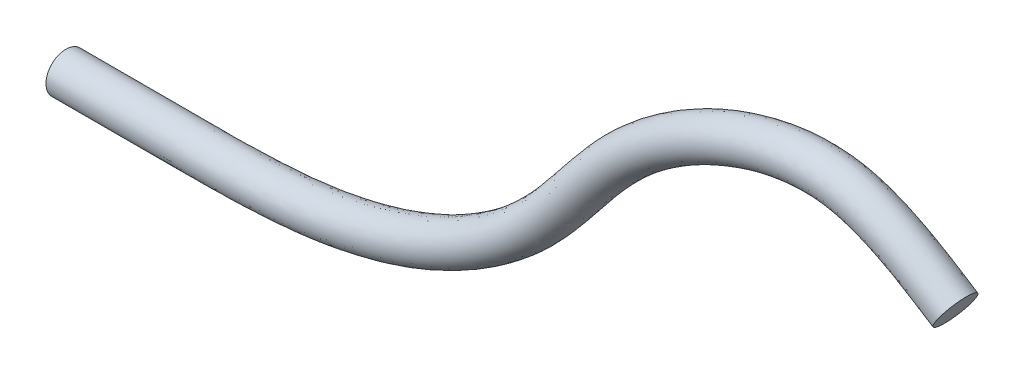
ISO-10303-21;
HEADER;
FILE_DESCRIPTION(('STEP AP214'),'2;1');
FILE_NAME('part.step','',(''),(''),'','','');
FILE_SCHEMA(('AUTOMOTIVE_DESIGN { 1 0 10303 214 1 1 1 1 }'));
ENDSEC;
DATA;
#1=APPLICATION_CONTEXT('core data for automotive mechanical design processes');
#2=APPLICATION_PROTOCOL_DEFINITION('international standard','automotive_design',2000,#1);
#3=PRODUCT_CONTEXT('',#1,'mechanical');
#4=PRODUCT('Part','Part','',(#3));
#5=PRODUCT_RELATED_PRODUCT_CATEGORY('part','',(#4));
#6=PRODUCT_DEFINITION_FORMATION('','',#4);
#7=PRODUCT_DEFINITION_CONTEXT('part definition',#1,'design');
#8=PRODUCT_DEFINITION('design','',#6,#7);
#9=PRODUCT_DEFINITION_SHAPE('','',#8);
#10=(LENGTH_UNIT() NAMED_UNIT(*) SI_UNIT(.MILLI.,.METRE.));
#11=(NAMED_UNIT(*) PLANE_ANGLE_UNIT() SI_UNIT($,.RADIAN.));
#12=(NAMED_UNIT(*) SI_UNIT($,.STERADIAN.) SOLID_ANGLE_UNIT());
#13=UNCERTAINTY_MEASURE_WITH_UNIT(LENGTH_MEASURE(1.E-05),#10,'distance_accuracy_value','');
#14=(GEOMETRIC_REPRESENTATION_CONTEXT(3) GLOBAL_UNCERTAINTY_ASSIGNED_CONTEXT((#13)) GLOBAL_UNIT_ASSIGNED_CONTEXT((#10,
#11,#12)) REPRESENTATION_CONTEXT('',''));
#15=CARTESIAN_POINT('',(0.,0.,0.));
#16=DIRECTION('',(0.,0.,1.));
#17=DIRECTION('',(1.,0.,0.));
#18=AXIS2_PLACEMENT_3D('',#15,#16,#17);
#19=CARTESIAN_POINT('',(0.,0.,1.5748));
#20=DIRECTION('',(-1.,0.,0.));
#21=DIRECTION('',(0.,0.,1.));
#22=AXIS2_PLACEMENT_3D('',#19,#20,#21);
#23=PLANE('',#22);
#24=CARTESIAN_POINT('',(0.,0.,0.));
#25=DIRECTION('',(1.,0.,0.));
#26=DIRECTION('',(0.,0.,-1.));
#27=AXIS2_PLACEMENT_3D('',#24,#25,#26);
#28=CIRCLE('',#27,1.5748);
#29=CARTESIAN_POINT('',(0.,0.,-1.5748));
#30=VERTEX_POINT('',#29);
#31=EDGE_CURVE('E39',#30,#30,#28,.T.);
#32=ORIENTED_EDGE('',*,*,#31,.F.);
#33=EDGE_LOOP('',(#32));
#34=FACE_BOUND('',#33,.T.);
#35=ADVANCED_FACE('F35',(#34),#23,.T.);
#36=CARTESIAN_POINT('',(70.4962550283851,18.9220961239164,1.5748));
#37=DIRECTION('',(-0.842656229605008,0.538451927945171,0.));
#38=DIRECTION('',(-0.538451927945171,-0.842656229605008,0.));
#39=AXIS2_PLACEMENT_3D('',#36,#37,#38);
#40=PLANE('',#39);
#41=CARTESIAN_POINT('',(70.4962550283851,18.9220961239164,0.));
#42=DIRECTION('',(-0.842656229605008,0.538451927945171,0.));
#43=DIRECTION('',(-0.538451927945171,-0.842656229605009,0.));
#44=AXIS2_PLACEMENT_3D('',#41,#42,#43);
#45=CIRCLE('',#44,1.5748);
#46=CARTESIAN_POINT('',(70.4962550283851,18.9220961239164,-1.5748));
#47=VERTEX_POINT('',#46);
#48=EDGE_CURVE('E11',#47,#47,#45,.T.);
#49=ORIENTED_EDGE('',*,*,#48,.F.);
#50=EDGE_LOOP('',(#49));
#51=FACE_BOUND('',#50,.T.);
#52=ADVANCED_FACE('F37',(#51),#40,.F.);
#53=CARTESIAN_POINT('',(0.,0.,-1.5748));
#54=CARTESIAN_POINT('',(3.27909688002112,-0.00402107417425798,-1.5748));
#55=CARTESIAN_POINT('',(9.83729064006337,-0.0120632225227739,-1.5748));
#56=CARTESIAN_POINT('',(19.7058374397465,0.0482528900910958,-1.5748));
#57=CARTESIAN_POINT('',(29.3919518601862,2.42234431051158,-1.5748));
#58=CARTESIAN_POINT('',(37.8783909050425,7.93704513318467,-1.5748));
#59=CARTESIAN_POINT('',(43.3450610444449,16.3191823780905,-1.5748));
#60=CARTESIAN_POINT('',(50.1615828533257,21.076135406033,-1.5748));
#61=CARTESIAN_POINT('',(56.7045873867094,23.2337492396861,-1.5748));
#62=CARTESIAN_POINT('',(61.6658584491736,23.4486821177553,-1.5748));
#63=CARTESIAN_POINT('',(66.190271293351,21.6810342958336,-1.5748));
#64=CARTESIAN_POINT('',(69.060927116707,19.8417421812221,-1.5748));
#65=CARTESIAN_POINT('',(70.4962550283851,18.9220961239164,-1.5748));
#66=CARTESIAN_POINT('',(0.,3.1496,-1.5748));
#67=CARTESIAN_POINT('',(3.29849121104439,3.14605637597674,-1.5748));
#68=CARTESIAN_POINT('',(9.89547363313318,3.13896912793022,-1.5748));
#69=CARTESIAN_POINT('',(19.403658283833,3.19199588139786,-1.5748));
#70=CARTESIAN_POINT('',(28.1849043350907,5.44630257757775,-1.5748));
#71=CARTESIAN_POINT('',(35.4624253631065,10.0229450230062,-1.5748));
#72=CARTESIAN_POINT('',(40.8639668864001,18.324854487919,-1.5748));
#73=CARTESIAN_POINT('',(48.7059450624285,23.9285786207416,-1.5748));
#74=CARTESIAN_POINT('',(56.0192164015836,26.3484546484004,-1.5748));
#75=CARTESIAN_POINT('',(62.1963185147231,26.6473718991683,-1.5748));
#76=CARTESIAN_POINT('',(67.7836574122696,24.4246998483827,-1.5748));
#77=CARTESIAN_POINT('',(70.7226612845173,22.5256507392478,-1.5748));
#78=CARTESIAN_POINT('',(72.1921632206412,21.5761261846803,-1.5748));
#79=CARTESIAN_POINT('',(0.,3.1496,1.5748));
#80=CARTESIAN_POINT('',(3.29849121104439,3.14605637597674,1.5748));
#81=CARTESIAN_POINT('',(9.89547363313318,3.13896912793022,1.5748));
#82=CARTESIAN_POINT('',(19.403658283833,3.19199588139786,1.5748));
#83=CARTESIAN_POINT('',(28.1849043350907,5.44630257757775,1.5748));
#84=CARTESIAN_POINT('',(35.4624253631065,10.0229450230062,1.5748));
#85=CARTESIAN_POINT('',(40.8639668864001,18.324854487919,1.5748));
#86=CARTESIAN_POINT('',(48.7059450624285,23.9285786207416,1.5748));
#87=CARTESIAN_POINT('',(56.0192164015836,26.3484546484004,1.5748));
#88=CARTESIAN_POINT('',(62.1963185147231,26.6473718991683,1.5748));
#89=CARTESIAN_POINT('',(67.7836574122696,24.4246998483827,1.5748));
#90=CARTESIAN_POINT('',(70.7226612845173,22.5256507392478,1.5748));
#91=CARTESIAN_POINT('',(72.1921632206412,21.5761261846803,1.5748));
#92=CARTESIAN_POINT('',(0.,0.,1.5748));
#93=CARTESIAN_POINT('',(3.27909688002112,-0.00402107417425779,1.5748));
#94=CARTESIAN_POINT('',(9.83729064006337,-0.0120632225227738,1.5748));
#95=CARTESIAN_POINT('',(19.7058374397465,0.0482528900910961,1.5748));
#96=CARTESIAN_POINT('',(29.3919518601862,2.42234431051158,1.5748));
#97=CARTESIAN_POINT('',(37.8783909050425,7.93704513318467,1.5748));
#98=CARTESIAN_POINT('',(43.3450610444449,16.3191823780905,1.5748));
#99=CARTESIAN_POINT('',(50.1615828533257,21.076135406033,1.5748));
#100=CARTESIAN_POINT('',(56.7045873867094,23.2337492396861,1.5748));
#101=CARTESIAN_POINT('',(61.6658584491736,23.4486821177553,1.5748));
#102=CARTESIAN_POINT('',(66.190271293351,21.6810342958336,1.5748));
#103=CARTESIAN_POINT('',(69.060927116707,19.8417421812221,1.5748));
#104=CARTESIAN_POINT('',(70.4962550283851,18.9220961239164,1.5748));
#105=CARTESIAN_POINT('',(0.,-3.1496,1.5748));
#106=CARTESIAN_POINT('',(3.25970254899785,-3.15409852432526,1.5748));
#107=CARTESIAN_POINT('',(9.77910764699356,-3.16309557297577,1.5748));
#108=CARTESIAN_POINT('',(20.0080165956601,-3.09549010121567,1.5748));
#109=CARTESIAN_POINT('',(30.5989993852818,-0.601613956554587,1.5748));
#110=CARTESIAN_POINT('',(40.2943564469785,5.85114524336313,1.5748));
#111=CARTESIAN_POINT('',(45.8261552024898,14.3135102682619,1.5748));
#112=CARTESIAN_POINT('',(51.6172206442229,18.2236921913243,1.5748));
#113=CARTESIAN_POINT('',(57.3899583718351,20.1190438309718,1.5748));
#114=CARTESIAN_POINT('',(61.1353983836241,20.2499923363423,1.5748));
#115=CARTESIAN_POINT('',(64.5968851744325,18.9373687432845,1.5748));
#116=CARTESIAN_POINT('',(67.3991929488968,17.1578336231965,1.5748));
#117=CARTESIAN_POINT('',(68.8003468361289,16.2680660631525,1.5748));
#118=CARTESIAN_POINT('',(0.,-3.1496,-1.5748));
#119=CARTESIAN_POINT('',(3.25970254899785,-3.15409852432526,-1.5748));
#120=CARTESIAN_POINT('',(9.77910764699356,-3.16309557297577,-1.5748));
#121=CARTESIAN_POINT('',(20.0080165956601,-3.09549010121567,-1.5748));
#122=CARTESIAN_POINT('',(30.5989993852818,-0.601613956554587,-1.5748));
#123=CARTESIAN_POINT('',(40.2943564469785,5.85114524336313,-1.5748));
#124=CARTESIAN_POINT('',(45.8261552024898,14.3135102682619,-1.5748));
#125=CARTESIAN_POINT('',(51.6172206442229,18.2236921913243,-1.5748));
#126=CARTESIAN_POINT('',(57.3899583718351,20.1190438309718,-1.5748));
#127=CARTESIAN_POINT('',(61.1353983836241,20.2499923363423,-1.5748));
#128=CARTESIAN_POINT('',(64.5968851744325,18.9373687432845,-1.5748));
#129=CARTESIAN_POINT('',(67.3991929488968,17.1578336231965,-1.5748));
#130=CARTESIAN_POINT('',(68.8003468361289,16.2680660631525,-1.5748));
#131=CARTESIAN_POINT('',(0.,0.,-1.5748));
#132=CARTESIAN_POINT('',(3.27909688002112,-0.00402107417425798,-1.5748));
#133=CARTESIAN_POINT('',(9.83729064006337,-0.0120632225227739,-1.5748));
#134=CARTESIAN_POINT('',(19.7058374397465,0.0482528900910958,-1.5748));
#135=CARTESIAN_POINT('',(29.3919518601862,2.42234431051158,-1.5748));
#136=CARTESIAN_POINT('',(37.8783909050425,7.93704513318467,-1.5748));
#137=CARTESIAN_POINT('',(43.3450610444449,16.3191823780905,-1.5748));
#138=CARTESIAN_POINT('',(50.1615828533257,21.076135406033,-1.5748));
#139=CARTESIAN_POINT('',(56.7045873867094,23.2337492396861,-1.5748));
#140=CARTESIAN_POINT('',(61.6658584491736,23.4486821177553,-1.5748));
#141=CARTESIAN_POINT('',(66.190271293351,21.6810342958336,-1.5748));
#142=CARTESIAN_POINT('',(69.060927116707,19.8417421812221,-1.5748));
#143=CARTESIAN_POINT('',(70.4962550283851,18.9220961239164,-1.5748));
#144=(BOUNDED_SURFACE() B_SPLINE_SURFACE(3,3,((#53,#54,#55,#56,#57,#58,#59,#60,#61,#62,#63,#64,
#65),(#66,#67,#68,#69,#70,#71,#72,#73,#74,#75,#76,#77,#78),(#79,#80,#81,#82,#83,#84,#85,#86,#87,
#88,#89,#90,#91),(#92,#93,#94,#95,#96,#97,#98,#99,#100,#101,#102,#103,#104),(#105,#106,#107,
#108,#109,#110,#111,#112,#113,#114,#115,#116,#117),(#118,#119,#120,#121,#122,#123,#124,#125,
#126,#127,#128,#129,#130),(#131,#132,#133,#134,#135,#136,#137,#138,#139,#140,#141,#142,#143)),
.UNSPECIFIED.,.T.,.F.,.F.) B_SPLINE_SURFACE_WITH_KNOTS((4,3,4),(4,1,1,1,1,1,1,1,1,1,4),(0.,0.5,
1.),(0.,0.125,0.25,0.375,0.5,0.625,0.75,0.8125,0.875,0.9375,1.),
.UNSPECIFIED.) GEOMETRIC_REPRESENTATION_ITEM() RATIONAL_B_SPLINE_SURFACE(((1.,1.,1.,1.,1.,1.,1.,
1.,1.,1.,1.,1.,1.),(0.333333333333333,0.333333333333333,0.333333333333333,0.333333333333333,
0.333333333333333,0.333333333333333,0.333333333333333,0.333333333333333,0.333333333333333,
0.333333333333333,0.333333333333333,0.333333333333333,0.333333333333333),(0.333333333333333,
0.333333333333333,0.333333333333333,0.333333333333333,0.333333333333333,0.333333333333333,
0.333333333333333,0.333333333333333,0.333333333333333,0.333333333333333,0.333333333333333,
0.333333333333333,0.333333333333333),(1.,1.,1.,1.,1.,1.,1.,1.,1.,1.,1.,1.,1.),
(0.333333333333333,0.333333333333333,0.333333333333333,0.333333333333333,0.333333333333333,
0.333333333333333,0.333333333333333,0.333333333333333,0.333333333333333,0.333333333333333,
0.333333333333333,0.333333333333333,0.333333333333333),(0.333333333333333,0.333333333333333,
0.333333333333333,0.333333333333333,0.333333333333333,0.333333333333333,0.333333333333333,
0.333333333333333,0.333333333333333,0.333333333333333,0.333333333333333,0.333333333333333,
0.333333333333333),(1.,1.,1.,1.,1.,1.,1.,1.,1.,1.,1.,1.,1.))) REPRESENTATION_ITEM('') SURFACE());
#145=CARTESIAN_POINT('',(0.,0.,-1.5748));
#146=CARTESIAN_POINT('',(0.0256179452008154,-3.14146430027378E-05,-1.5748));
#147=CARTESIAN_POINT('',(0.0512358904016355,-6.2829285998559E-05,-1.5748));
#148=CARTESIAN_POINT('',(0.102471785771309,-0.000125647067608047,-1.5748));
#149=CARTESIAN_POINT('',(0.128089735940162,-0.000157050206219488,-1.5748));
#150=CARTESIAN_POINT('',(0.179325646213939,-0.000219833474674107,-1.5748));
#151=CARTESIAN_POINT('',(0.204943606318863,-0.000251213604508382,-1.5748));
#152=CARTESIAN_POINT('',(0.256179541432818,-0.000313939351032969,-1.5748));
#153=CARTESIAN_POINT('',(0.281797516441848,-0.000345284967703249,-1.5748));
#154=CARTESIAN_POINT('',(0.33303348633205,-0.000407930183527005,-1.5748));
#155=CARTESIAN_POINT('',(0.358651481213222,-0.000439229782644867,-1.5748));
#156=CARTESIAN_POINT('',(0.409887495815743,-0.000501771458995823,-1.5748));
#157=CARTESIAN_POINT('',(0.435505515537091,-0.000533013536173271,-1.5748));
#158=CARTESIAN_POINT('',(0.486741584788,-0.000595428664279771,-1.5748));
#159=CARTESIAN_POINT('',(0.512359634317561,-0.000626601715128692,-1.5748));
#160=CARTESIAN_POINT('',(0.56359576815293,-0.000688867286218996,-1.5748));
#161=CARTESIAN_POINT('',(0.589213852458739,-0.00071995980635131,-1.5748));
#162=CARTESIAN_POINT('',(0.640450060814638,-0.000782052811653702,-1.5748));
#163=CARTESIAN_POINT('',(0.66606818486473,-0.000813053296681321,-1.5748));
#164=CARTESIAN_POINT('',(0.71730447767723,-0.000874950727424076,-1.5748));
#165=CARTESIAN_POINT('',(0.74292264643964,-0.000905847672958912,-1.5748));
#166=CARTESIAN_POINT('',(0.794159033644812,-0.000967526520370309,-1.5748));
#167=CARTESIAN_POINT('',(0.819777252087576,-0.000998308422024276,-1.5748));
#168=CARTESIAN_POINT('',(0.871013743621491,-0.00105974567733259,-1.5748));
#169=CARTESIAN_POINT('',(0.896632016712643,-0.0010904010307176,-1.5748));
#170=CARTESIAN_POINT('',(0.947868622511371,-0.00115157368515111,-1.5748));
#171=CARTESIAN_POINT('',(0.973486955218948,-0.00118209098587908,-1.5748));
#172=CARTESIAN_POINT('',(1.02472368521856,-0.00124297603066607,-1.5748));
#173=CARTESIAN_POINT('',(1.0503420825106,-0.0012733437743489,-1.5748));
#174=CARTESIAN_POINT('',(1.10157894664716,-0.00133391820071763,-1.5748));
#175=CARTESIAN_POINT('',(1.1271974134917,-0.00136412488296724,-1.5748));
#176=CARTESIAN_POINT('',(1.17843442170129,-0.00142436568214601,-1.5748));
#177=CARTESIAN_POINT('',(1.20405296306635,-0.00145439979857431,-1.5748));
#178=CARTESIAN_POINT('',(1.25529012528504,-0.00151428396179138,-1.5748));
#179=CARTESIAN_POINT('',(1.28090874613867,-0.00154413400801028,-1.5748));
#180=CARTESIAN_POINT('',(1.33214607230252,-0.00160363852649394,-1.5748));
#181=CARTESIAN_POINT('',(1.35776477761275,-0.00163329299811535,-1.5748));
#182=CARTESIAN_POINT('',(1.40900227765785,-0.00169239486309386,-1.5748));
#183=CARTESIAN_POINT('',(1.43462107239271,-0.0017218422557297,-1.5748));
#184=CARTESIAN_POINT('',(1.48585875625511,-0.00178051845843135,-1.5748));
#185=CARTESIAN_POINT('',(1.51147764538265,-0.00180974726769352,-1.5748));
#186=CARTESIAN_POINT('',(1.56271552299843,-0.00186797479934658,-1.5748));
#187=CARTESIAN_POINT('',(1.58833451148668,-0.001896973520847,-1.5748));
#188=CARTESIAN_POINT('',(1.63957259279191,-0.00195472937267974,-1.5748));
#189=CARTESIAN_POINT('',(1.6651916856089,-0.00198348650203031,-1.5748));
#190=CARTESIAN_POINT('',(1.71642998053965,-0.00204074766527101,-1.5748));
#191=CARTESIAN_POINT('',(1.74204918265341,-0.00206925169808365,-1.5748));
#192=CARTESIAN_POINT('',(1.79328770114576,-0.00212599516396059,-1.5748));
#193=CARTESIAN_POINT('',(1.81890701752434,-0.0021542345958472,-1.5748));
#194=CARTESIAN_POINT('',(1.87014576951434,-0.00221043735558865,-1.5748));
#195=CARTESIAN_POINT('',(1.89576520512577,-0.00223840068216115,-1.5748));
#196=CARTESIAN_POINT('',(1.94700420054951,-0.00229403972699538,-1.5748));
#197=CARTESIAN_POINT('',(1.97262376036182,-0.00232171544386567,-1.5748));
#198=CARTESIAN_POINT('',(2.02386300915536,-0.00237676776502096,-1.5748));
#199=CARTESIAN_POINT('',(2.04948269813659,-0.00240414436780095,-1.5748));
#200=CARTESIAN_POINT('',(2.10072221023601,-0.00245858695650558,-1.5748));
#201=CARTESIAN_POINT('',(2.12634203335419,-0.00248565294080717,-1.5748));
#202=CARTESIAN_POINT('',(2.17758181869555,-0.00253946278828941,-1.5748));
#203=CARTESIAN_POINT('',(2.20320178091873,-0.00256620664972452,-1.5748));
#204=CARTESIAN_POINT('',(2.2544418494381,-0.00261936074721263,-1.5748));
#205=CARTESIAN_POINT('',(2.28006195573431,-0.00264577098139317,-1.5748));
#206=CARTESIAN_POINT('',(2.33130231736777,-0.00269824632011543,-1.5748));
#207=CARTESIAN_POINT('',(2.35692257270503,-0.0027243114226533,-1.5748));
#208=CARTESIAN_POINT('',(2.40816323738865,-0.00277608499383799,-1.5748));
#209=CARTESIAN_POINT('',(2.43378364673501,-0.00280179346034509,-1.5748));
#210=CARTESIAN_POINT('',(2.48502462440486,-0.00285284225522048,-1.5748));
#211=CARTESIAN_POINT('',(2.51064519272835,-0.00287818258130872,-1.5748));
#212=CARTESIAN_POINT('',(2.56188649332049,-0.00292848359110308,-1.5748));
#213=CARTESIAN_POINT('',(2.58750722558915,-0.00295344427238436,-1.5748));
#214=CARTESIAN_POINT('',(2.63874885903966,-0.00300297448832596,-1.5748));
#215=CARTESIAN_POINT('',(2.66436976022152,-0.0030275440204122,-1.5748));
#216=CARTESIAN_POINT('',(2.71561173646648,-0.0030762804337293,-1.5748));
#217=CARTESIAN_POINT('',(2.74123281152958,-0.0031004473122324,-1.5748));
#218=CARTESIAN_POINT('',(2.79247514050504,-0.00314836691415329,-1.5748));
#219=CARTESIAN_POINT('',(2.81809639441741,-0.00317211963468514,-1.5748));
#220=CARTESIAN_POINT('',(2.86933908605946,-0.00321919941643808,-1.5748));
#221=CARTESIAN_POINT('',(2.89496052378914,-0.00324252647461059,-1.5748));
#222=CARTESIAN_POINT('',(2.94620358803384,-0.00328874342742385,-1.5748));
#223=CARTESIAN_POINT('',(2.97182521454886,-0.00331163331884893,-1.5748));
#224=CARTESIAN_POINT('',(3.02306866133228,-0.00335696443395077,-1.5748));
#225=CARTESIAN_POINT('',(3.04869048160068,-0.00337940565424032,-1.5748));
#226=CARTESIAN_POINT('',(3.0999343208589,-0.00342382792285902,-1.5748));
#227=CARTESIAN_POINT('',(3.12555633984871,-0.00344580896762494,-1.5748));
#228=CARTESIAN_POINT('',(3.17680058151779,-0.00348929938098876,-1.5748));
#229=CARTESIAN_POINT('',(3.20242280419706,-0.00351080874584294,-1.5748));
#230=CARTESIAN_POINT('',(3.25366745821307,-0.00355334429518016,-1.5748));
#231=CARTESIAN_POINT('',(3.27928988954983,-0.00357437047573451,-1.5748));
#232=CARTESIAN_POINT('',(3.33053496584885,-0.00361592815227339,-1.5748));
#233=CARTESIAN_POINT('',(3.35615761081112,-0.00363645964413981,-1.5748));
#234=CARTESIAN_POINT('',(3.40740311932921,-0.00367701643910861,-1.5748));
#235=CARTESIAN_POINT('',(3.43302598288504,-0.003697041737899,-1.5748));
#236=CARTESIAN_POINT('',(3.48427193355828,-0.00373657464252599,-1.5748));
#237=CARTESIAN_POINT('',(3.5098950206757,-0.00375608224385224,-1.5748));
#238=CARTESIAN_POINT('',(3.56114142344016,-0.00379456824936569,-1.5748));
#239=CARTESIAN_POINT('',(3.58676473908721,-0.0038135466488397,-1.5748));
#240=CARTESIAN_POINT('',(3.63801160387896,-0.00385096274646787,-1.5748));
#241=CARTESIAN_POINT('',(3.66363515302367,-0.00386940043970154,-1.5748));
#242=CARTESIAN_POINT('',(3.71488248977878,-0.0039057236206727,-1.5748));
#243=CARTESIAN_POINT('',(3.74050627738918,-0.00392360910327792,-1.5748));
#244=CARTESIAN_POINT('',(3.79175409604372,-0.00395881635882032,-1.5748));
#245=CARTESIAN_POINT('',(3.81737812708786,-0.003976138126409,-1.5748));
#246=CARTESIAN_POINT('',(3.8686264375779,-0.00401020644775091,-1.5748));
#247=CARTESIAN_POINT('',(3.8942507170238,-0.00402695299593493,-1.5748));
#248=CARTESIAN_POINT('',(3.94549952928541,-0.00405985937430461,-1.5748));
#249=CARTESIAN_POINT('',(3.97112406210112,-0.00407601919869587,-1.5748));
#250=CARTESIAN_POINT('',(4.02237338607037,-0.00410774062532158,-1.5748));
#251=CARTESIAN_POINT('',(4.04799817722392,-0.00412330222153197,-1.5748));
#252=CARTESIAN_POINT('',(4.09924802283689,-0.00415381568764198,-1.5748));
#253=CARTESIAN_POINT('',(4.12487307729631,-0.0041687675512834,-1.5748));
#254=CARTESIAN_POINT('',(4.17612345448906,-0.00419805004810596,-1.5748));
#255=CARTESIAN_POINT('',(4.20174877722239,-0.00421238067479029,-1.5748));
#256=CARTESIAN_POINT('',(4.25299969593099,-0.00424040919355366,-1.5748));
#257=CARTESIAN_POINT('',(4.27862529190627,-0.0042541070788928,-1.5748));
#258=CARTESIAN_POINT('',(4.32987676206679,-0.00428085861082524,-1.5748));
#259=CARTESIAN_POINT('',(4.35550263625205,-0.00429391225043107,-1.5748));
#260=CARTESIAN_POINT('',(4.40675466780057,-0.00431936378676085,-1.5748));
#261=CARTESIAN_POINT('',(4.43238082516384,-0.00433176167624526,-1.5748));
#262=CARTESIAN_POINT('',(4.48363342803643,-0.00435589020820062,-1.5748));
#263=CARTESIAN_POINT('',(4.50925987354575,-0.00436762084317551,-1.5748));
#264=CARTESIAN_POINT('',(4.56051305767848,-0.00439040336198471,-1.5748));
#265=CARTESIAN_POINT('',(4.58613979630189,-0.00440145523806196,-1.5748));
#266=CARTESIAN_POINT('',(4.63739357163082,-0.00442286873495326,-1.5748));
#267=CARTESIAN_POINT('',(4.66302060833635,-0.00443323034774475,-1.5748));
#268=CARTESIAN_POINT('',(4.71427498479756,-0.0044532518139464,-1.5748));
#269=CARTESIAN_POINT('',(4.73990232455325,-0.00446291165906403,-1.5748));
#270=CARTESIAN_POINT('',(4.79115731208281,-0.00448151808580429,-1.5748));
#271=CARTESIAN_POINT('',(4.81678495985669,-0.00449046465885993,-1.5748));
#272=CARTESIAN_POINT('',(4.86804056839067,-0.00450763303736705,-1.5748));
#273=CARTESIAN_POINT('',(4.89366852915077,-0.00451585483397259,-1.5748));
#274=CARTESIAN_POINT('',(4.94492476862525,-0.00453156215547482,-1.5748));
#275=CARTESIAN_POINT('',(4.97055304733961,-0.00453904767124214,-1.5748));
#276=CARTESIAN_POINT('',(5.02180992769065,-0.00455327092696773,-1.5748));
#277=CARTESIAN_POINT('',(5.04743852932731,-0.00456000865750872,-1.5748));
#278=CARTESIAN_POINT('',(5.09869606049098,-0.00457272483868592,-1.5748));
#279=CARTESIAN_POINT('',(5.12432499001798,-0.00457870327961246,-1.5748));
#280=CARTESIAN_POINT('',(5.17558318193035,-0.00458988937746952,-1.5748));
#281=CARTESIAN_POINT('',(5.20121244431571,-0.00459509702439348,-1.5748));
#282=CARTESIAN_POINT('',(5.25247130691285,-0.00460473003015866,-1.5748));
#283=CARTESIAN_POINT('',(5.27810090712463,-0.00460915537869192,-1.5748));
#284=CARTESIAN_POINT('',(5.32936045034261,-0.00461721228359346,-1.5748));
#285=CARTESIAN_POINT('',(5.35499039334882,-0.0046208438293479,-1.5748));
#286=CARTESIAN_POINT('',(5.40625062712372,-0.00462730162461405,-1.5748));
#287=CARTESIAN_POINT('',(5.43188091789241,-0.00463012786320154,-1.5748));
#288=CARTESIAN_POINT('',(5.48314185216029,-0.00463496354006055,-1.5748));
#289=CARTESIAN_POINT('',(5.50877249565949,-0.00463697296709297,-1.5748));
#290=CARTESIAN_POINT('',(5.56003414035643,-0.00464016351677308,-1.5748));
#291=CARTESIAN_POINT('',(5.58566514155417,-0.00464134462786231,-1.5748));
#292=CARTESIAN_POINT('',(5.63692750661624,-0.00464286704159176,-1.5748));
#293=CARTESIAN_POINT('',(5.66255887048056,-0.00464320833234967,-1.5748));
#294=CARTESIAN_POINT('',(5.71382196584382,-0.00464303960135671,-1.5748));
#295=CARTESIAN_POINT('',(5.73945369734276,-0.00464252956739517,-1.5748));
#296=CARTESIAN_POINT('',(5.79071753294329,-0.00464064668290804,-1.5748));
#297=CARTESIAN_POINT('',(5.81634963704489,-0.00463927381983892,-1.5748));
#298=CARTESIAN_POINT('',(5.86761422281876,-0.00463565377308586,-1.5748));
#299=CARTESIAN_POINT('',(5.89324670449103,-0.00463340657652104,-1.5748));
#300=CARTESIAN_POINT('',(5.94451205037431,-0.00462802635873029,-1.5748));
#301=CARTESIAN_POINT('',(5.97014491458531,-0.00462489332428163,-1.5748));
#302=CARTESIAN_POINT('',(6.02141103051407,-0.00461772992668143,-1.5748));
#303=CARTESIAN_POINT('',(6.04704428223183,-0.0046136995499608,-1.5748));
#304=CARTESIAN_POINT('',(6.09831117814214,-0.00460472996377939,-1.5748));
#305=CARTESIAN_POINT('',(6.12394482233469,-0.00459979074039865,-1.5748));
#306=CARTESIAN_POINT('',(6.17521250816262,-0.00458899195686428,-1.5748));
#307=CARTESIAN_POINT('',(6.200846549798,-0.0045831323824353,-1.5748));
#308=CARTESIAN_POINT('',(6.25211503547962,-0.00457048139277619,-1.5748));
#309=CARTESIAN_POINT('',(6.27774947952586,-0.00456368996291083,-1.5748));
#310=CARTESIAN_POINT('',(6.32901877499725,-0.00454916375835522,-1.5748));
#311=CARTESIAN_POINT('',(6.35465362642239,-0.00454142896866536,-1.5748));
#312=CARTESIAN_POINT('',(6.40592374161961,-0.00452500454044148,-1.5748));
#313=CARTESIAN_POINT('',(6.43155900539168,-0.00451631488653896,-1.5748));
#314=CARTESIAN_POINT('',(6.4828299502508,-0.00449796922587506,-1.5748));
#315=CARTESIAN_POINT('',(6.50846563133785,-0.00448831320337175,-1.5748));
#316=CARTESIAN_POINT('',(6.55973741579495,-0.00446802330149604,-1.5748));
#317=CARTESIAN_POINT('',(6.58537351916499,-0.0044573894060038,-1.5748));
#318=CARTESIAN_POINT('',(6.63664615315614,-0.00443513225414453,-1.5748));
#319=CARTESIAN_POINT('',(6.66228268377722,-0.00442350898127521,-1.5748));
#320=CARTESIAN_POINT('',(6.71355617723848,-0.0043992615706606,-1.5748));
#321=CARTESIAN_POINT('',(6.73919314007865,-0.00438663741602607,-1.5748));
#322=CARTESIAN_POINT('',(6.79046750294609,-0.00436037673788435,-1.5748));
#323=CARTESIAN_POINT('',(6.81610490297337,-0.00434674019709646,-1.5748));
#324=CARTESIAN_POINT('',(6.86738014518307,-0.00431844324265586,-1.5748));
#325=CARTESIAN_POINT('',(6.89301798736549,-0.00430378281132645,-1.5748));
#326=CARTESIAN_POINT('',(6.94429411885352,-0.0042734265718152,-1.5748));
#327=CARTESIAN_POINT('',(6.96993240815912,-0.00425773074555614,-1.5748));
#328=CARTESIAN_POINT('',(7.02120943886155,-0.00422529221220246,-1.5748));
#329=CARTESIAN_POINT('',(7.04684818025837,-0.00420854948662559,-1.5748));
#330=CARTESIAN_POINT('',(7.09812612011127,-0.00417400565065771,-1.5748));
#331=CARTESIAN_POINT('',(7.12376531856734,-0.00415620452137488,-1.5748));
#332=CARTESIAN_POINT('',(7.17504417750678,-0.00411953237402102,-1.5748));
#333=CARTESIAN_POINT('',(7.20068383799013,-0.00410066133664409,-1.5748));
#334=CARTESIAN_POINT('',(7.25196362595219,-0.00406183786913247,-1.5748));
#335=CARTESIAN_POINT('',(7.27760375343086,-0.00404188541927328,-1.5748));
#336=CARTESIAN_POINT('',(7.3288844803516,-0.00400088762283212,-1.5748));
#337=CARTESIAN_POINT('',(7.35452507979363,-0.00397984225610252,-1.5748));
#338=CARTESIAN_POINT('',(7.40580675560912,-0.00393664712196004,-1.5748));
#339=CARTESIAN_POINT('',(7.43144783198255,-0.00391449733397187,-1.5748));
#340=CARTESIAN_POINT('',(7.48273046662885,-0.00386908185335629,-1.5748));
#341=CARTESIAN_POINT('',(7.50837202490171,-0.00384581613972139,-1.5748));
#342=CARTESIAN_POINT('',(7.55965562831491,-0.00379815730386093,-1.5748));
#343=CARTESIAN_POINT('',(7.58529767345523,-0.00377376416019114,-1.5748));
#344=CARTESIAN_POINT('',(7.63658225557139,-0.00372383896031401,-1.5748));
#345=CARTESIAN_POINT('',(7.66222479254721,-0.00369830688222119,-1.5748));
#346=CARTESIAN_POINT('',(7.71351036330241,-0.0036460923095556,-1.5748));
#347=CARTESIAN_POINT('',(7.73915339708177,-0.00361940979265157,-1.5748));
#348=CARTESIAN_POINT('',(7.79043996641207,-0.00356488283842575,-1.5748));
#349=CARTESIAN_POINT('',(7.816083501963,-0.00353703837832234,-1.5748));
#350=CARTESIAN_POINT('',(7.86737107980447,-0.00348017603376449,-1.5748));
#351=CARTESIAN_POINT('',(7.893015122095,-0.00345115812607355,-1.5748));
#352=CARTESIAN_POINT('',(7.94430371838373,-0.00339193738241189,-1.5748));
#353=CARTESIAN_POINT('',(7.9699482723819,-0.00336173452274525,-1.5748));
#354=CARTESIAN_POINT('',(8.02123789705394,-0.00330013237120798,-1.5748));
#355=CARTESIAN_POINT('',(8.04688296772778,-0.00326873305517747,-1.5748));
#356=CARTESIAN_POINT('',(8.09817363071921,-0.0032047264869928,-1.5748));
#357=CARTESIAN_POINT('',(8.12381922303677,-0.00317211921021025,-1.5748));
#358=CARTESIAN_POINT('',(8.17511093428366,-0.00310568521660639,-1.5748));
#359=CARTESIAN_POINT('',(8.20075705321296,-0.00307185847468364,-1.5748));
#360=CARTESIAN_POINT('',(8.25204982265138,-0.00300297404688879,-1.5748));
#361=CARTESIAN_POINT('',(8.27769647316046,-0.00296791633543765,-1.5748));
#362=CARTESIAN_POINT('',(8.32899031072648,-0.00289655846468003,-1.5748));
#363=CARTESIAN_POINT('',(8.35463749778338,-0.00286025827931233,-1.5748));
#364=CARTESIAN_POINT('',(8.40593241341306,-0.00278640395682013,-1.5748));
#365=CARTESIAN_POINT('',(8.43158014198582,-0.0027488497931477,-1.5748));
#366=CARTESIAN_POINT('',(8.48287614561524,-0.00267247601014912,-1.5748));
#367=CARTESIAN_POINT('',(8.50852442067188,-0.00263365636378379,-1.5748));
#368=CARTESIAN_POINT('',(8.55982152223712,-0.00255474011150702,-1.5748));
#369=CARTESIAN_POINT('',(8.58547034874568,-0.0025146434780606,-1.5748));
#370=CARTESIAN_POINT('',(8.6367685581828,-0.00243316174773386,-1.5748));
#371=CARTESIAN_POINT('',(8.66241794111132,-0.00239177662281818,-1.5748));
#372=CARTESIAN_POINT('',(8.7137172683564,-0.00230770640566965,-1.5748));
#373=CARTESIAN_POINT('',(8.73936721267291,-0.00226502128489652,-1.5748));
#374=CARTESIAN_POINT('',(8.79066766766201,-0.00217833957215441,-1.5748));
#375=CARTESIAN_POINT('',(8.81631817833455,-0.00213434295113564,-1.5748));
#376=CARTESIAN_POINT('',(8.86761977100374,-0.00204502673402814,-1.5748));
#377=CARTESIAN_POINT('',(8.89327085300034,-0.00199970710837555,-1.5748));
#378=CARTESIAN_POINT('',(8.9445735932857,-0.00190773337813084,-1.5748));
#379=CARTESIAN_POINT('',(8.9702252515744,-0.00186107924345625,-1.5748));
#380=CARTESIAN_POINT('',(9.02152914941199,-0.00176642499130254,-1.5748));
#381=CARTESIAN_POINT('',(9.04718138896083,-0.00171842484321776,-1.5748));
#382=CARTESIAN_POINT('',(9.09848645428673,-0.00162106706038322,-1.5748));
#383=CARTESIAN_POINT('',(9.12413928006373,-0.00157170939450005,-1.5748));
#384=CARTESIAN_POINT('',(9.17544552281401,-0.00147162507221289,-1.5748));
#385=CARTESIAN_POINT('',(9.20109893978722,-0.00142089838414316,-1.5748));
#386=CARTESIAN_POINT('',(9.25240636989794,-0.00131806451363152,-1.5748));
#387=CARTESIAN_POINT('',(9.27806038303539,-0.00126595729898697,-1.5748));
#388=CARTESIAN_POINT('',(9.32936901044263,-0.0011603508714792,-1.5748));
#389=CARTESIAN_POINT('',(9.35502362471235,-0.00110685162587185,-1.5748));
#390=CARTESIAN_POINT('',(9.40633345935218,-0.000998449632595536,-1.5748));
#391=CARTESIAN_POINT('',(9.43198867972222,-0.000943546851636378,-1.5748));
#392=CARTESIAN_POINT('',(9.4832997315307,-0.000832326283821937,-1.5748));
#393=CARTESIAN_POINT('',(9.50895556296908,-0.000776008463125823,-1.5748));
#394=CARTESIAN_POINT('',(9.56026784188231,-0.000661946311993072,-1.5748));
#395=CARTESIAN_POINT('',(9.58592428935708,-0.000604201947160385,-1.5748));
#396=CARTESIAN_POINT('',(9.63723780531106,-0.000487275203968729,-1.5748));
#397=CARTESIAN_POINT('',(9.66289487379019,-0.000428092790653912,-1.5748));
#398=CARTESIAN_POINT('',(9.71420963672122,-0.000308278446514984,-1.5748));
#399=CARTESIAN_POINT('',(9.73986733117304,-0.000247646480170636,-1.5748));
#400=CARTESIAN_POINT('',(9.79118335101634,-0.000124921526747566,-1.5748));
#401=CARTESIAN_POINT('',(9.81684167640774,-6.2828503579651E-05,-1.5748));
#402=CARTESIAN_POINT('',(9.86815895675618,6.28300539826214E-05,-1.5748));
#403=CARTESIAN_POINT('',(9.89381791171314,0.000126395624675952,-1.5748));
#404=CARTESIAN_POINT('',(9.94513642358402,0.000255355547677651,-1.5748));
#405=CARTESIAN_POINT('',(9.97079598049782,0.000320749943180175,-1.5748));
#406=CARTESIAN_POINT('',(10.0221156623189,0.000453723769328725,-1.5748));
#407=CARTESIAN_POINT('',(10.0477757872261,0.000521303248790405,-1.5748));
#408=CARTESIAN_POINT('',(10.0990965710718,0.000659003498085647,-1.5748));
#409=CARTESIAN_POINT('',(10.1247572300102,0.000729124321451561,-1.5748));
#410=CARTESIAN_POINT('',(10.176079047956,0.000872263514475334,-1.5748));
#411=CARTESIAN_POINT('',(10.2017402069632,0.00094528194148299,-1.5748));
#412=CARTESIAN_POINT('',(10.2530629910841,0.00109457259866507,-1.5748));
#413=CARTESIAN_POINT('',(10.2787246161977,0.00117084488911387,-1.5748));
#414=CARTESIAN_POINT('',(10.3300482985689,0.00132699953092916,-1.5748));
#415=CARTESIAN_POINT('',(10.3557103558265,0.00140688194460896,-1.5748));
#416=CARTESIAN_POINT('',(10.4070348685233,0.00157061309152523,-1.5748));
#417=CARTESIAN_POINT('',(10.4326973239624,0.00165446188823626,-1.5748));
#418=CARTESIAN_POINT('',(10.48402259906,0.00182648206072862,-1.5748));
#419=CARTESIAN_POINT('',(10.5096854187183,0.00191465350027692,-1.5748));
#420=CARTESIAN_POINT('',(10.5610113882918,0.00209567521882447,-1.5748));
#421=CARTESIAN_POINT('',(10.5866745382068,0.0021885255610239,-1.5748));
#422=CARTESIAN_POINT('',(10.6380011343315,0.00237926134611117,-1.5748));
#423=CARTESIAN_POINT('',(10.6636645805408,0.00247714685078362,-1.5748));
#424=CARTESIAN_POINT('',(10.7149917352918,0.00267830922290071,-1.5748));
#425=CARTESIAN_POINT('',(10.7406554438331,0.00278158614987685,-1.5748));
#426=CARTESIAN_POINT('',(10.7919830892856,0.00299388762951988,-1.5748));
#427=CARTESIAN_POINT('',(10.8176470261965,0.0031029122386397,-1.5748));
#428=CARTESIAN_POINT('',(10.8689750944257,0.00332706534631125,-1.5748));
#429=CARTESIAN_POINT('',(10.8946392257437,0.00344219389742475,-1.5748));
#430=CARTESIAN_POINT('',(10.9459676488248,0.00367891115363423,-1.5748));
#431=CARTESIAN_POINT('',(10.9716319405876,0.00380049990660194,-1.5748));
#432=CARTESIAN_POINT('',(11.0229606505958,0.00405049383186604,-1.5748));
#433=CARTESIAN_POINT('',(11.0486250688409,0.0041788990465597,-1.5748));
#434=CARTESIAN_POINT('',(11.0999539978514,0.00444288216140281,-1.5748));
#435=CARTESIAN_POINT('',(11.1256185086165,0.00457846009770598,-1.5748));
#436=CARTESIAN_POINT('',(11.1769475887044,0.00485714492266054,-1.5748));
#437=CARTESIAN_POINT('',(11.2026121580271,0.00500025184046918,-1.5748));
#438=CARTESIAN_POINT('',(11.2539413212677,0.00529435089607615,-1.5748));
#439=CARTESIAN_POINT('',(11.2796059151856,0.0054453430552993,-1.5748));
#440=CARTESIAN_POINT('',(11.3309350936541,0.00575556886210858,-1.5748));
#441=CARTESIAN_POINT('',(11.3565996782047,0.00591480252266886,-1.5748));
#442=CARTESIAN_POINT('',(11.4079288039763,0.00624186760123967,-1.5748));
#443=CARTESIAN_POINT('',(11.4335933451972,0.00640969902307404,-1.5748));
#444=CARTESIAN_POINT('',(11.4849223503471,0.00675431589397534,-1.5748));
#445=CARTESIAN_POINT('',(11.510586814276,0.00693110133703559,-1.5748));
#446=CARTESIAN_POINT('',(11.5619156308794,0.00729398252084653,-1.5748));
#447=CARTESIAN_POINT('',(11.5875799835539,0.00748007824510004,-1.5748));
#448=CARTESIAN_POINT('',(11.638908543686,0.00786193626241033,-1.5748));
#449=CARTESIAN_POINT('',(11.6645727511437,0.00805769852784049,-1.5748));
#450=CARTESIAN_POINT('',(11.7159009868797,0.00845924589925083,-1.5748));
#451=CARTESIAN_POINT('',(11.7415650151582,0.00866503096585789,-1.5748));
#452=CARTESIAN_POINT('',(11.7928928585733,0.00908698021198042,-1.5748));
#453=CARTESIAN_POINT('',(11.8185566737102,0.00930314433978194,-1.5748));
#454=CARTESIAN_POINT('',(11.8698840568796,0.00974620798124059,-1.5748));
#455=CARTESIAN_POINT('',(11.8955476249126,0.00997310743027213,-1.5748));
#456=CARTESIAN_POINT('',(11.9468744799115,0.0104379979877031,-1.5748));
#457=CARTESIAN_POINT('',(11.9725377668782,0.0106759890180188,-1.5748));
#458=CARTESIAN_POINT('',(12.0238640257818,0.011163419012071,-1.5748));
#459=CARTESIAN_POINT('',(12.0495269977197,0.0114128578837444,-1.5748));
#460=CARTESIAN_POINT('',(12.1008525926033,0.0119235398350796,-1.5748));
#461=CARTESIAN_POINT('',(12.1265152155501,0.0121847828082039,-1.5748));
#462=CARTESIAN_POINT('',(12.1778400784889,0.0127194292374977,-1.5748));
#463=CARTESIAN_POINT('',(12.2035023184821,0.0129928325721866,-1.5748));
#464=CARTESIAN_POINT('',(12.2548263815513,0.0135521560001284,-1.5748));
#465=CARTESIAN_POINT('',(12.2804882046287,0.0138380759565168,-1.5748));
#466=CARTESIAN_POINT('',(12.3318113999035,0.0144227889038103,-1.5748));
#467=CARTESIAN_POINT('',(12.3574727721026,0.0147215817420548,-1.5748));
#468=CARTESIAN_POINT('',(12.4087950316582,0.0153323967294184,-1.5748));
#469=CARTESIAN_POINT('',(12.4344559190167,0.0156444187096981,-1.5748));
#470=CARTESIAN_POINT('',(12.4857771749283,0.0162820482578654,-1.5748));
#471=CARTESIAN_POINT('',(12.5114375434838,0.0166076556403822,-1.5748));
#472=CARTESIAN_POINT('',(12.5627577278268,0.0172728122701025,-1.5748));
#473=CARTESIAN_POINT('',(12.5884175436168,0.0176123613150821,-1.5748));
#474=CARTESIAN_POINT('',(12.6397365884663,0.0183057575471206,-1.5748));
#475=CARTESIAN_POINT('',(12.6653958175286,0.0186596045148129,-1.5748));
#476=CARTESIAN_POINT('',(12.7167136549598,0.0193819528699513,-1.5748));
#477=CARTESIAN_POINT('',(12.742372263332,0.019750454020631,-1.5748));
#478=CARTESIAN_POINT('',(12.7936888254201,0.020502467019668,-1.5748));
#479=CARTESIAN_POINT('',(12.8193467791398,0.0208859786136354,-1.5748));
#480=CARTESIAN_POINT('',(12.8706619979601,0.0216683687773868,-1.5748));
#481=CARTESIAN_POINT('',(12.8963192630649,0.0220672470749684,-1.5748));
#482=CARTESIAN_POINT('',(12.9476330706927,0.0228807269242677,-1.5748));
#483=CARTESIAN_POINT('',(12.9732896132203,0.0232953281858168,-1.5748));
#484=CARTESIAN_POINT('',(13.0246019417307,0.0241406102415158,-1.5748));
#485=CARTESIAN_POINT('',(13.0502577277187,0.024571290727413,-1.5748));
#486=CARTESIAN_POINT('',(13.101568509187,0.025449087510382,-1.5748));
#487=CARTESIAN_POINT('',(13.127223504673,0.0258962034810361,-1.5748));
#488=CARTESIAN_POINT('',(13.1785326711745,0.0268072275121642,-1.5748));
#489=CARTESIAN_POINT('',(13.2041868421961,0.0272711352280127,-1.5748));
#490=CARTESIAN_POINT('',(13.2554943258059,0.0282160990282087,-1.5748));
#491=CARTESIAN_POINT('',(13.2811476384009,0.0286971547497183,-1.5748));
#492=CARTESIAN_POINT('',(13.3324533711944,0.0296767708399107,-1.5748));
#493=CARTESIAN_POINT('',(13.3581057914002,0.0301753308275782,-1.5748));
#494=CARTESIAN_POINT('',(13.4094097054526,0.0311903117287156,-1.5748));
#495=CARTESIAN_POINT('',(13.435061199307,0.0317067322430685,-1.5748));
#496=CARTESIAN_POINT('',(13.4863632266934,0.0327577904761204,-1.5748));
#497=CARTESIAN_POINT('',(13.512013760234,0.0332924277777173,-1.5748));
#498=CARTESIAN_POINT('',(13.5633138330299,0.0343802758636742,-1.5748));
#499=CARTESIAN_POINT('',(13.5889633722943,0.0349334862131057,-1.5748));
#500=CARTESIAN_POINT('',(13.6402614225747,0.0360588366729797,-1.5748));
#501=CARTESIAN_POINT('',(13.6659099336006,0.0366309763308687,-1.5748));
#502=CARTESIAN_POINT('',(13.7172058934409,0.0377945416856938,-1.5748));
#503=CARTESIAN_POINT('',(13.7428533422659,0.0383859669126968,-1.5748));
#504=CARTESIAN_POINT('',(13.7941471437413,0.0395884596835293,-1.5748));
#505=CARTESIAN_POINT('',(13.8197934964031,0.0401995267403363,-1.5748));
#506=CARTESIAN_POINT('',(13.8710850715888,0.0414416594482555,-1.5748));
#507=CARTESIAN_POINT('',(13.896730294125,0.042072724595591,-1.5748));
#508=CARTESIAN_POINT('',(13.9480195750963,0.0433552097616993,-1.5748));
#509=CARTESIAN_POINT('',(13.9736636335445,0.0440066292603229,-1.5748));
#510=CARTESIAN_POINT('',(14.0249505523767,0.0453301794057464,-1.5748));
#511=CARTESIAN_POINT('',(14.0505934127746,0.0460023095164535,-1.5748));
#512=CARTESIAN_POINT('',(14.1018779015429,0.0473676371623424,-1.5748));
#513=CARTESIAN_POINT('',(14.127519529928,0.0480608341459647,-1.5748));
#514=CARTESIAN_POINT('',(14.1788015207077,0.0494686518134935,-1.5748));
#515=CARTESIAN_POINT('',(14.2044418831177,0.0501832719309,-1.5748));
#516=CARTESIAN_POINT('',(14.255721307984,0.0516342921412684,-1.5748));
#517=CARTESIAN_POINT('',(14.2813603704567,0.0523706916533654,-1.5748));
#518=CARTESIAN_POINT('',(14.3326371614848,0.0538656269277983,-1.5748));
#519=CARTESIAN_POINT('',(14.3582748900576,0.0546241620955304,-1.5748));
#520=CARTESIAN_POINT('',(14.4095489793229,0.0561637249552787,-1.5748));
#521=CARTESIAN_POINT('',(14.4351853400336,0.0569447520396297,-1.5748));
#522=CARTESIAN_POINT('',(14.4864566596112,0.0585296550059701,-1.5748));
#523=CARTESIAN_POINT('',(14.5120916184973,0.0593335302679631,-1.5748));
#524=CARTESIAN_POINT('',(14.5633601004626,0.0609644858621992,-1.5748));
#525=CARTESIAN_POINT('',(14.5889936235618,0.0617915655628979,-1.5748));
#526=CARTESIAN_POINT('',(14.6402591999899,0.0634692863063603,-1.5748));
#527=CARTESIAN_POINT('',(14.6658912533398,0.0643199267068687,-1.5748));
#528=CARTESIAN_POINT('',(14.7171538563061,0.0660451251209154,-1.5748));
#529=CARTESIAN_POINT('',(14.7427844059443,0.0669196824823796,-1.5748));
#530=CARTESIAN_POINT('',(14.7940439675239,0.0686930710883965,-1.5748));
#531=CARTESIAN_POINT('',(14.8196729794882,0.0695919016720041,-1.5748));
#532=CARTESIAN_POINT('',(14.8709294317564,0.0714141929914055,-1.5748));
#533=CARTESIAN_POINT('',(14.8965568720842,0.0723376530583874,-1.5748));
#534=CARTESIAN_POINT('',(14.9478101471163,0.0742095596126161,-1.5748));
#535=CARTESIAN_POINT('',(14.9734359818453,0.0751580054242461,-1.5748));
#536=CARTESIAN_POINT('',(15.0246860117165,0.0770802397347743,-1.5748));
#537=CARTESIAN_POINT('',(15.0503102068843,0.0780540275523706,-1.5748));
#538=CARTESIAN_POINT('',(15.1015569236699,0.0800273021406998,-1.5748));
#539=CARTESIAN_POINT('',(15.1271794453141,0.081026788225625,-1.5748));
#540=CARTESIAN_POINT('',(15.1784227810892,0.0830518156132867,-1.5748));
#541=CARTESIAN_POINT('',(15.2040435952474,0.0840773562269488,-1.5748));
#542=CARTESIAN_POINT('',(15.2552834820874,0.0861548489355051,-1.5748));
#543=CARTESIAN_POINT('',(15.2809025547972,0.0872068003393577,-1.5748));
#544=CARTESIAN_POINT('',(15.3321389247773,0.0893374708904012,-1.5748));
#545=CARTESIAN_POINT('',(15.3577562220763,0.090416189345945,-1.5748));
#546=CARTESIAN_POINT('',(15.4089890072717,0.0926007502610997,-1.5748));
#547=CARTESIAN_POINT('',(15.4346044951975,0.0937065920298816,-1.5748));
#548=CARTESIAN_POINT('',(15.4858336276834,0.0959457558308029,-1.5748));
#549=CARTESIAN_POINT('',(15.5114472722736,0.0970790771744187,-1.5748));
#550=CARTESIAN_POINT('',(15.5626726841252,0.0993735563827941,-1.5748));
#551=CARTESIAN_POINT('',(15.5882844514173,0.100534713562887,-1.5748));
#552=CARTESIAN_POINT('',(15.6395060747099,0.102885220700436,-1.5748));
#553=CARTESIAN_POINT('',(15.6651159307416,0.104074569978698,-1.5748));
#554=CARTESIAN_POINT('',(15.7163336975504,0.106481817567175,-1.5748));
#555=CARTESIAN_POINT('',(15.7419416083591,0.107699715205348,-1.5748));
#556=CARTESIAN_POINT('',(15.7931554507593,0.110164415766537,-1.5748));
#557=CARTESIAN_POINT('',(15.8187613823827,0.111411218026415,-1.5748));
#558=CARTESIAN_POINT('',(15.8699712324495,0.113934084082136,-1.5748));
#559=CARTESIAN_POINT('',(15.8955751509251,0.11521014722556,-1.5748));
#560=CARTESIAN_POINT('',(15.9467809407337,0.117791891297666,-1.5748));
#561=CARTESIAN_POINT('',(15.972382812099,0.119097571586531,-1.5748));
#562=CARTESIAN_POINT('',(16.0235844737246,0.121738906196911,-1.5748));
#563=CARTESIAN_POINT('',(16.0491842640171,0.123074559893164,-1.5748));
#564=CARTESIAN_POINT('',(16.1003817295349,0.12577619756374,-1.5748));
#565=CARTESIAN_POINT('',(16.1259794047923,0.127142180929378,-1.5748));
#566=CARTESIAN_POINT('',(16.1771726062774,0.129904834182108,-1.5748));
#567=CARTESIAN_POINT('',(16.2027681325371,0.131301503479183,-1.5748));
#568=CARTESIAN_POINT('',(16.2539570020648,0.13412588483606,-1.5748));
#569=CARTESIAN_POINT('',(16.2795503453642,0.135553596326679,-1.5748));
#570=CARTESIAN_POINT('',(16.3307348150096,0.138440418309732,-1.5748));
#571=CARTESIAN_POINT('',(16.3563259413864,0.139899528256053,-1.5748));
#572=CARTESIAN_POINT('',(16.4075059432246,0.142849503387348,-1.5748));
#573=CARTESIAN_POINT('',(16.4330948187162,0.144340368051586,-1.5748));
#574=CARTESIAN_POINT('',(16.4842702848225,0.147354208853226,-1.5748));
#575=CARTESIAN_POINT('',(16.5098568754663,0.14887718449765,-1.5748));
#576=CARTESIAN_POINT('',(16.5610277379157,0.151955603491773,-1.5748));
#577=CARTESIAN_POINT('',(16.5866120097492,0.15351104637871,-1.5748));
#578=CARTESIAN_POINT('',(16.6377782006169,0.156654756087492,-1.5748));
#579=CARTESIAN_POINT('',(16.6633601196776,0.158243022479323,-1.5748));
#580=CARTESIAN_POINT('',(16.7145215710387,0.161452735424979,-1.5748));
#581=CARTESIAN_POINT('',(16.740101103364,0.163074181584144,-1.5748));
#582=CARTESIAN_POINT('',(16.7912577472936,0.166350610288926,-1.5748));
#583=CARTESIAN_POINT('',(16.8168348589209,0.168005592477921,-1.5748));
#584=CARTESIAN_POINT('',(16.8679866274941,0.171349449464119,-1.5748));
#585=CARTESIAN_POINT('',(16.8935612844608,0.173038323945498,-1.5748));
#586=CARTESIAN_POINT('',(16.9447081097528,0.176450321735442,-1.5748));
#587=CARTESIAN_POINT('',(16.9702802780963,0.178173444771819,-1.5748));
#588=CARTESIAN_POINT('',(17.021422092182,0.181654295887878,-1.5748));
#589=CARTESIAN_POINT('',(17.0469917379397,0.183412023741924,-1.5748));
#590=CARTESIAN_POINT('',(17.0981284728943,0.186962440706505,-1.5748));
#591=CARTESIAN_POINT('',(17.1236955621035,0.188755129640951,-1.5748));
#592=CARTESIAN_POINT('',(17.174827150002,0.192375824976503,-1.5748));
#593=CARTESIAN_POINT('',(17.2003916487,0.194203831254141,-1.5748));
#594=CARTESIAN_POINT('',(17.2515180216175,0.197895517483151,-1.5748));
#595=CARTESIAN_POINT('',(17.2770798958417,0.199759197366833,-1.5748));
#596=CARTESIAN_POINT('',(17.3282009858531,0.203522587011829,-1.5748));
#597=CARTESIAN_POINT('',(17.3537602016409,0.205422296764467,-1.5748));
#598=CARTESIAN_POINT('',(17.4048759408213,0.209258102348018,-1.5748));
#599=CARTESIAN_POINT('',(17.4304324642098,0.211194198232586,-1.5748));
#600=CARTESIAN_POINT('',(17.4815427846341,0.215103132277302,-1.5748));
#601=CARTESIAN_POINT('',(17.5070965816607,0.217075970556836,-1.5748));
#602=CARTESIAN_POINT('',(17.558201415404,0.221058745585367,-1.5748));
#603=CARTESIAN_POINT('',(17.5837524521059,0.223068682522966,-1.5748));
#604=CARTESIAN_POINT('',(17.634851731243,0.227126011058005,-1.5748));
#605=CARTESIAN_POINT('',(17.6603999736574,0.229173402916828,-1.5748));
#606=CARTESIAN_POINT('',(17.7114936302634,0.23330599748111,-1.5748));
#607=CARTESIAN_POINT('',(17.7370390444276,0.235391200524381,-1.5748));
#608=CARTESIAN_POINT('',(17.7881270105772,0.239599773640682,-1.5748));
#609=CARTESIAN_POINT('',(17.8136695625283,0.241723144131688,-1.5748));
#610=CARTESIAN_POINT('',(17.8647517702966,0.246008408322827,-1.5748));
#611=CARTESIAN_POINT('',(17.8902914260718,0.248170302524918,-1.5748));
#612=CARTESIAN_POINT('',(17.9413678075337,0.252532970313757,-1.5748));
#613=CARTESIAN_POINT('',(17.96690453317,0.254733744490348,-1.5748));
#614=CARTESIAN_POINT('',(18.0179750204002,0.259174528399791,-1.5748));
#615=CARTESIAN_POINT('',(18.0435087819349,0.261414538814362,-1.5748));
#616=CARTESIAN_POINT('',(18.0945733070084,0.265934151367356,-1.5748));
#617=CARTESIAN_POINT('',(18.1201040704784,0.268213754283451,-1.5748));
#618=CARTESIAN_POINT('',(18.1711625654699,0.272812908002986,-1.5748));
#619=CARTESIAN_POINT('',(18.1966902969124,0.275132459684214,-1.5748));
#620=CARTESIAN_POINT('',(18.2477426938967,0.279811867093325,-1.5748));
#621=CARTESIAN_POINT('',(18.2732673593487,0.28217172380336,-1.5748));
#622=CARTESIAN_POINT('',(18.3243135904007,0.286932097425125,-1.5748));
#623=CARTESIAN_POINT('',(18.349835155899,0.289332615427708,-1.5748));
#624=CARTESIAN_POINT('',(18.4008751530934,0.294174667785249,-1.5748));
#625=CARTESIAN_POINT('',(18.4263935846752,0.296616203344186,-1.5748));
#626=CARTESIAN_POINT('',(18.4774272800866,0.301540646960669,-1.5748));
#627=CARTESIAN_POINT('',(18.5029425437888,0.304023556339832,-1.5748));
#628=CARTESIAN_POINT('',(18.553969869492,0.309031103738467,-1.5748));
#629=CARTESIAN_POINT('',(18.5794819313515,0.311555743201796,-1.5748));
#630=CARTESIAN_POINT('',(18.6305028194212,0.316647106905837,-1.5748));
#631=CARTESIAN_POINT('',(18.6560116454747,0.319213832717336,-1.5748));
#632=CARTESIAN_POINT('',(18.7070260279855,0.324389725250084,-1.5748));
#633=CARTESIAN_POINT('',(18.73253158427,0.326998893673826,-1.5748));
#634=CARTESIAN_POINT('',(18.7835393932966,0.332260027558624,-1.5748));
#635=CARTESIAN_POINT('',(18.8090416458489,0.334911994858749,-1.5748));
#636=CARTESIAN_POINT('',(18.8600428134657,0.340259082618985,-1.5748));
#637=CARTESIAN_POINT('',(18.8855417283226,0.3429542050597,-1.5748));
#638=CARTESIAN_POINT('',(18.9365361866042,0.348387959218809,-1.5748));
#639=CARTESIAN_POINT('',(18.9620317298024,0.351126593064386,-1.5748));
#640=CARTESIAN_POINT('',(19.0130194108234,0.356647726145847,-1.5748));
#641=CARTESIAN_POINT('',(19.0385115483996,0.35943022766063,-1.5748));
#642=CARTESIAN_POINT('',(19.0894923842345,0.365039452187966,-1.5748));
#643=CARTESIAN_POINT('',(19.1149810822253,0.36786617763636,-1.5748));
#644=CARTESIAN_POINT('',(19.1659550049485,0.373564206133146,-1.5748));
#645=CARTESIAN_POINT('',(19.1914402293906,0.376435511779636,-1.5748));
#646=CARTESIAN_POINT('',(19.2424071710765,0.382223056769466,-1.5748));
#647=CARTESIAN_POINT('',(19.2678888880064,0.385139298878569,-1.5748));
#648=CARTESIAN_POINT('',(19.3188487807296,0.391017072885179,-1.5748));
#649=CARTESIAN_POINT('',(19.3443269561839,0.393978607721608,-1.5748));
#650=CARTESIAN_POINT('',(19.3952797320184,0.399947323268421,-1.5748));
#651=CARTESIAN_POINT('',(19.4207543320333,0.40295450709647,-1.5748));
#652=CARTESIAN_POINT('',(19.4716999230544,0.409014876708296,-1.5748));
#653=CARTESIAN_POINT('',(19.4971709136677,0.412068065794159,-1.5748));
#654=CARTESIAN_POINT('',(19.5481092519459,0.418220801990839,-1.5748));
#655=CARTESIAN_POINT('',(19.5735765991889,0.421320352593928,-1.5748));
#656=CARTESIAN_POINT('',(19.6245076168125,0.427566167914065,-1.5748));
#657=CARTESIAN_POINT('',(19.6499712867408,0.430712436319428,-1.5748));
#658=CARTESIAN_POINT('',(19.7008948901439,0.437052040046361,-1.5748));
#659=CARTESIAN_POINT('',(19.7263548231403,0.440245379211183,-1.5748));
#660=CARTESIAN_POINT('',(19.7772708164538,0.446679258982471,-1.5748));
#661=CARTESIAN_POINT('',(19.8027268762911,0.449919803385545,-1.5748));
#662=CARTESIAN_POINT('',(19.8536349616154,0.456448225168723,-1.5748));
#663=CARTESIAN_POINT('',(19.8790869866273,0.459736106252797,-1.5748));
#664=CARTESIAN_POINT('',(19.9299868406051,0.466359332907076,-1.5748));
#665=CARTESIAN_POINT('',(19.9554346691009,0.469694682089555,-1.5748));
#666=CARTESIAN_POINT('',(20.0063259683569,0.476412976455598,-1.5748));
#667=CARTESIAN_POINT('',(20.0317694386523,0.479795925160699,-1.5748));
#668=CARTESIAN_POINT('',(20.0826518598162,0.486609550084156,-1.5748));
#669=CARTESIAN_POINT('',(20.1080908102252,0.490040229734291,-1.5748));
#670=CARTESIAN_POINT('',(20.1589640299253,0.496949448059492,-1.5748));
#671=CARTESIAN_POINT('',(20.1843982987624,0.500427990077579,-1.5748));
#672=CARTESIAN_POINT('',(20.2352619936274,0.507433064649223,-1.5748));
#673=CARTESIAN_POINT('',(20.260691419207,0.510959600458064,-1.5748));
#674=CARTESIAN_POINT('',(20.3115452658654,0.518060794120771,-1.5748));
#675=CARTESIAN_POINT('',(20.3369696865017,0.521635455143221,-1.5748));
#676=CARTESIAN_POINT('',(20.3878133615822,0.528833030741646,-1.5748));
#677=CARTESIAN_POINT('',(20.4132326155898,0.532455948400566,-1.5748));
#678=CARTESIAN_POINT('',(20.4640657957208,0.539750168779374,-1.5748));
#679=CARTESIAN_POINT('',(20.489479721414,0.543421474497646,-1.5748));
#680=CARTESIAN_POINT('',(20.5403020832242,0.550812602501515,-1.5748));
#681=CARTESIAN_POINT('',(20.5657105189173,0.554532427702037,-1.5748));
#682=CARTESIAN_POINT('',(20.6165217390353,0.562020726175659,-1.5748));
#683=CARTESIAN_POINT('',(20.6419245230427,0.565789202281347,-1.5748));
#684=CARTESIAN_POINT('',(20.6927242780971,0.573374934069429,-1.5748));
#685=CARTESIAN_POINT('',(20.7181212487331,0.577192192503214,-1.5748));
#686=CARTESIAN_POINT('',(20.7689092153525,0.584875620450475,-1.5748));
#687=CARTESIAN_POINT('',(20.7943002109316,0.588741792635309,-1.5748));
#688=CARTESIAN_POINT('',(20.8450760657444,0.596523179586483,-1.5748));
#689=CARTESIAN_POINT('',(20.8704609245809,0.600438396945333,-1.5748));
#690=CARTESIAN_POINT('',(20.9212243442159,0.608318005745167,-1.5748));
#691=CARTESIAN_POINT('',(20.9466029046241,0.61228239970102,-1.5748));
#692=CARTESIAN_POINT('',(20.9973535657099,0.620260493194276,-1.5748));
#693=CARTESIAN_POINT('',(21.0227256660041,0.624274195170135,-1.5748));
#694=CARTESIAN_POINT('',(21.0734632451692,0.632351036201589,-1.5748));
#695=CARTESIAN_POINT('',(21.0988287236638,0.636414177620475,-1.5748));
#696=CARTESIAN_POINT('',(21.1495528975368,0.644590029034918,-1.5748));
#697=CARTESIAN_POINT('',(21.1749115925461,0.648702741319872,-1.5748));
#698=CARTESIAN_POINT('',(21.2256220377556,0.656977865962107,-1.5748));
#699=CARTESIAN_POINT('',(21.250973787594,0.661140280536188,-1.5748));
#700=CARTESIAN_POINT('',(21.3016701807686,0.669514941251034,-1.5748));
#701=CARTESIAN_POINT('',(21.3270148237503,0.673727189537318,-1.5748));
#702=CARTESIAN_POINT('',(21.3776968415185,0.682201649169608,-1.5748));
#703=CARTESIAN_POINT('',(21.403034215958,0.686463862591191,-1.5748));
#704=CARTESIAN_POINT('',(21.4537015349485,0.695038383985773,-1.5748));
#705=CARTESIAN_POINT('',(21.4790314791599,0.699350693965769,-1.5748));
#706=CARTESIAN_POINT('',(21.5296837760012,0.708025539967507,-1.5748));
#707=CARTESIAN_POINT('',(21.5550061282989,0.712388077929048,-1.5748));
#708=CARTESIAN_POINT('',(21.6056430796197,0.721163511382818,-1.5748));
#709=CARTESIAN_POINT('',(21.630957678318,0.725576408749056,-1.5748));
#710=CARTESIAN_POINT('',(21.6815789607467,0.734452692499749,-1.5748));
#711=CARTESIAN_POINT('',(21.7068856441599,0.738916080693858,-1.5748));
#712=CARTESIAN_POINT('',(21.7574909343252,0.747893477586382,-1.5748));
#713=CARTESIAN_POINT('',(21.7827895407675,0.752407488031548,-1.5748));
#714=CARTESIAN_POINT('',(21.833378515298,0.761486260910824,-1.5748));
#715=CARTESIAN_POINT('',(21.8586688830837,0.766051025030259,-1.5748));
#716=CARTESIAN_POINT('',(21.909241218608,0.775231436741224,-1.5748));
#717=CARTESIAN_POINT('',(21.9345231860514,0.779847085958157,-1.5748));
#718=CARTESIAN_POINT('',(21.9850785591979,0.789129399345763,-1.5748));
#719=CARTESIAN_POINT('',(22.0103519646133,0.793796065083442,-1.5748));
#720=CARTESIAN_POINT('',(22.0608900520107,0.803180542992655,-1.5748));
#721=CARTESIAN_POINT('',(22.0861547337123,0.807898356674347,-1.5748));
#722=CARTESIAN_POINT('',(22.1366752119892,0.817385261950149,-1.5748));
#723=CARTESIAN_POINT('',(22.1619310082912,0.822154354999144,-1.5748));
#724=CARTESIAN_POINT('',(22.2124335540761,0.831743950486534,-1.5748));
#725=CARTESIAN_POINT('',(22.2376803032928,0.836564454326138,-1.5748));
#726=CARTESIAN_POINT('',(22.2881645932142,0.846257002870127,-1.5748));
#727=CARTESIAN_POINT('',(22.3134021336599,0.851129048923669,-1.5748));
#728=CARTESIAN_POINT('',(22.3638678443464,0.860924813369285,-1.5748));
#729=CARTESIAN_POINT('',(22.3890960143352,0.865848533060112,-1.5748));
#730=CARTESIAN_POINT('',(22.4395428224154,0.875747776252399,-1.5748));
#731=CARTESIAN_POINT('',(22.4647614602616,0.88072330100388,-1.5748));
#732=CARTESIAN_POINT('',(22.515189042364,0.890726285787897,-1.5748));
#733=CARTESIAN_POINT('',(22.5403979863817,0.895753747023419,-1.5748));
#734=CARTESIAN_POINT('',(22.5908060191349,0.90586073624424,-1.5748));
#735=CARTESIAN_POINT('',(22.6160051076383,0.910940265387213,-1.5748));
#736=CARTESIAN_POINT('',(22.6663932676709,0.921151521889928,-1.5748));
#737=CARTESIAN_POINT('',(22.6915823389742,0.926283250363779,-1.5748));
#738=CARTESIAN_POINT('',(22.7419503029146,0.936599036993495,-1.5748));
#739=CARTESIAN_POINT('',(22.767129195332,0.941783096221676,-1.5748));
#740=CARTESIAN_POINT('',(22.8174766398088,0.952203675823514,-1.5748));
#741=CARTESIAN_POINT('',(22.8426451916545,0.957440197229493,-1.5748));
#742=CARTESIAN_POINT('',(22.8929717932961,0.967965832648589,-1.5748));
#743=CARTESIAN_POINT('',(22.9181298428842,0.97325494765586,-1.5748));
#744=CARTESIAN_POINT('',(22.9684352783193,0.983885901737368,-1.5748));
#745=CARTESIAN_POINT('',(22.993582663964,0.98922774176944,-1.5748));
#746=CARTESIAN_POINT('',(23.043866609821,0.999964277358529,-1.5748));
#747=CARTESIAN_POINT('',(23.0690031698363,1.00535897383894,-1.5748));
#748=CARTESIAN_POINT('',(23.1192653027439,1.01620135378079,-1.5748));
#749=CARTESIAN_POINT('',(23.144390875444,1.02164903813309,-1.5748));
#750=CARTESIAN_POINT('',(23.1946308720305,1.03259752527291,-1.5748));
#751=CARTESIAN_POINT('',(23.2197452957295,1.03809832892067,-1.5748));
#752=CARTESIAN_POINT('',(23.2699628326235,1.04915318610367,-1.5748));
#753=CARTESIAN_POINT('',(23.2950659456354,1.0547072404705,-1.5748));
#754=CARTESIAN_POINT('',(23.3452606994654,1.06586873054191,-1.5748));
#755=CARTESIAN_POINT('',(23.3703523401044,1.07147616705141,-1.5748));
#756=CARTESIAN_POINT('',(23.4205239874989,1.08274455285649,-1.5748));
#757=CARTESIAN_POINT('',(23.445603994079,1.08840550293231,-1.5748));
#758=CARTESIAN_POINT('',(23.4957522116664,1.09978104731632,-1.5748));
#759=CARTESIAN_POINT('',(23.5208204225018,1.10549564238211,-1.5748));
#760=CARTESIAN_POINT('',(23.5709448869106,1.11697860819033,-1.5748));
#761=CARTESIAN_POINT('',(23.5960011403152,1.12274697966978,-1.5748));
#762=CARTESIAN_POINT('',(23.6461015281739,1.13433762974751,-1.5748));
#763=CARTESIAN_POINT('',(23.6711456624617,1.14015990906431,-1.5748));
#764=CARTESIAN_POINT('',(23.7212216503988,1.15185850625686,-1.5748));
#765=CARTESIAN_POINT('',(23.7462535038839,1.15773482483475,-1.5748));
#766=CARTESIAN_POINT('',(23.7963047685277,1.16954163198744,-1.5748));
#767=CARTESIAN_POINT('',(23.8213241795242,1.17547212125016,-1.5748));
#768=CARTESIAN_POINT('',(23.8713503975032,1.18738740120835,-1.5748));
#769=CARTESIAN_POINT('',(23.8963572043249,1.19337219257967,-1.5748));
#770=CARTESIAN_POINT('',(23.9463580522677,1.20539620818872,-1.5748));
#771=CARTESIAN_POINT('',(23.9713520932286,1.21143543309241,-1.5748));
#772=CARTESIAN_POINT('',(24.0213272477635,1.2235684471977,-1.5748));
#773=CARTESIAN_POINT('',(24.0463083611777,1.22966223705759,-1.5748));
#774=CARTESIAN_POINT('',(24.0962574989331,1.24190451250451,-1.5748));
#775=CARTESIAN_POINT('',(24.1212255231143,1.24805299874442,-1.5748));
#776=CARTESIAN_POINT('',(24.1711483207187,1.26040479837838,-1.5748));
#777=CARTESIAN_POINT('',(24.196103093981,1.26660811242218,-1.5748));
#778=CARTESIAN_POINT('',(24.2459992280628,1.2790696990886,-1.5748));
#779=CARTESIAN_POINT('',(24.2709405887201,1.28532797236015,-1.5748));
#780=CARTESIAN_POINT('',(24.3208097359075,1.29789960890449,-1.5748));
#781=CARTESIAN_POINT('',(24.3457375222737,1.30421297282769,-1.5748));
#782=CARTESIAN_POINT('',(24.3955793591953,1.31689492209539,-1.5748));
#783=CARTESIAN_POINT('',(24.4204934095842,1.32326350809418,-1.5748));
#784=CARTESIAN_POINT('',(24.4703076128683,1.33605603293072,-1.5748));
#785=CARTESIAN_POINT('',(24.4952077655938,1.34247997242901,-1.5748));
#786=CARTESIAN_POINT('',(24.5449940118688,1.3553833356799,-1.5748));
#787=CARTESIAN_POINT('',(24.5698801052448,1.36186276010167,-1.5748));
#788=CARTESIAN_POINT('',(24.6196380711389,1.37487722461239,-1.5748));
#789=CARTESIAN_POINT('',(24.6445099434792,1.38141226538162,-1.5748));
#790=CARTESIAN_POINT('',(24.6942393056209,1.39453809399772,-1.5748));
#791=CARTESIAN_POINT('',(24.7190967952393,1.40112888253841,-1.5748));
#792=CARTESIAN_POINT('',(24.7687972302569,1.41436633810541,-1.5748));
#793=CARTESIAN_POINT('',(24.7936401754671,1.4210130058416,-1.5748));
#794=CARTESIAN_POINT('',(24.8433113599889,1.43436235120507,-1.5748));
#795=CARTESIAN_POINT('',(24.8681395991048,1.4410650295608,-1.5748));
#796=CARTESIAN_POINT('',(24.9177812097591,1.45452652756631,-1.5748));
#797=CARTESIAN_POINT('',(24.9425945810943,1.46128534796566,-1.5748));
#798=CARTESIAN_POINT('',(24.9922062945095,1.47485926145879,-1.5748));
#799=CARTESIAN_POINT('',(25.0170046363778,1.48167435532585,-1.5748));
#800=CARTESIAN_POINT('',(25.0665861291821,1.49536094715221,-1.5748));
#801=CARTESIAN_POINT('',(25.0913692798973,1.50223244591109,-1.5748));
#802=CARTESIAN_POINT('',(25.1409202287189,1.5160319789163,-1.5748));
#803=CARTESIAN_POINT('',(25.1656880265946,1.52296001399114,-1.5748));
#804=CARTESIAN_POINT('',(25.2152081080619,1.53687275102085,-1.5748));
#805=CARTESIAN_POINT('',(25.2399603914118,1.5438574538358,-1.5748));
#806=CARTESIAN_POINT('',(25.2894492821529,1.55788365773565,-1.5748));
#807=CARTESIAN_POINT('',(25.3141858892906,1.5649251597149,-1.5748));
#808=CARTESIAN_POINT('',(25.3636432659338,1.57906509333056,-1.5748));
#809=CARTESIAN_POINT('',(25.388364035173,1.5861635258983,-1.5748));
#810=CARTESIAN_POINT('',(25.4377895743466,1.60041745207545,-1.5748));
#811=CARTESIAN_POINT('',(25.4624943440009,1.60757294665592,-1.5748));
#812=CARTESIAN_POINT('',(25.511887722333,1.62194112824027,-1.5748));
#813=CARTESIAN_POINT('',(25.5365763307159,1.6291538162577,-1.5748));
#814=CARTESIAN_POINT('',(25.5859372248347,1.64363651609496,-1.5748));
#815=CARTESIAN_POINT('',(25.6106095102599,1.65090652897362,-1.5748));
#816=CARTESIAN_POINT('',(25.6599375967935,1.66550400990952,-1.5748));
#817=CARTESIAN_POINT('',(25.6845933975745,1.67283147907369,-1.5748));
#818=CARTESIAN_POINT('',(25.7338883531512,1.68754400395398,-1.5748));
#819=CARTESIAN_POINT('',(25.7585275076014,1.69492906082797,-1.5748));
#820=CARTESIAN_POINT('',(25.8077890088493,1.70975689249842,-1.5748));
#821=CARTESIAN_POINT('',(25.8324113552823,1.71719966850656,-1.5748));
#822=CARTESIAN_POINT('',(25.8816390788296,1.73214306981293,-1.5748));
#823=CARTESIAN_POINT('',(25.9062444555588,1.73964369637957,-1.5748));
#824=CARTESIAN_POINT('',(25.9554380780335,1.75470293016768,-1.5748));
#825=CARTESIAN_POINT('',(25.9800263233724,1.76226153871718,-1.5748));
#826=CARTESIAN_POINT('',(26.0291855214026,1.77743686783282,-1.5748));
#827=CARTESIAN_POINT('',(26.0537564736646,1.78505358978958,-1.5748));
#828=CARTESIAN_POINT('',(26.1028809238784,1.80034527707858,-1.5748));
#829=CARTESIAN_POINT('',(26.1274344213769,1.80802024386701,-1.5748));
#830=CARTESIAN_POINT('',(26.1765238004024,1.8234285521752,-1.5748));
#831=CARTESIAN_POINT('',(26.2010596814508,1.83116189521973,-1.5748));
#832=CARTESIAN_POINT('',(26.250113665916,1.84668708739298,-1.5748));
#833=CARTESIAN_POINT('',(26.2746317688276,1.85447893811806,-1.5748));
#834=CARTESIAN_POINT('',(26.3236500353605,1.87012127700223,-1.5748));
#835=CARTESIAN_POINT('',(26.3481501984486,1.87797176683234,-1.5748));
#836=CARTESIAN_POINT('',(26.3971324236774,1.89373151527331,-1.5748));
#837=CARTESIAN_POINT('',(26.4216144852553,1.90164077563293,-1.5748));
#838=CARTESIAN_POINT('',(26.4705603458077,1.91751819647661,-1.5748));
#839=CARTESIAN_POINT('',(26.4950241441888,1.92548635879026,-1.5748));
#840=CARTESIAN_POINT('',(26.5439333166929,1.94148171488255,-1.5748));
#841=CARTESIAN_POINT('',(26.5683786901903,1.94950891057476,-1.5748));
#842=CARTESIAN_POINT('',(26.6172508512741,1.96562246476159,-1.5748));
#843=CARTESIAN_POINT('',(26.641677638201,1.97370882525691,-1.5748));
#844=CARTESIAN_POINT('',(26.6905124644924,1.98994084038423,-1.5748));
#845=CARTESIAN_POINT('',(26.714920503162,1.99808649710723,-1.5748));
#846=CARTESIAN_POINT('',(26.763717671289,2.01443723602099,-1.5748));
#847=CARTESIAN_POINT('',(26.7881068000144,2.02264232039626,-1.5748));
#848=CARTESIAN_POINT('',(26.8368659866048,2.03911204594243,-1.5748));
#849=CARTESIAN_POINT('',(26.8612360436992,2.04737668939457,-1.5748));
#850=CARTESIAN_POINT('',(26.9099569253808,2.06396566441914,-1.5748));
#851=CARTESIAN_POINT('',(26.9343077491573,2.07228999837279,-1.5748));
#852=CARTESIAN_POINT('',(26.9829900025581,2.08899848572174,-1.5748));
#853=CARTESIAN_POINT('',(27.0073214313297,2.09738264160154,-1.5748));
#854=CARTESIAN_POINT('',(27.0559647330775,2.1142109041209,-1.5748));
#855=CARTESIAN_POINT('',(27.0802766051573,2.12265501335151,-1.5748));
#856=CARTESIAN_POINT('',(27.1288806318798,2.13960331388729,-1.5748));
#857=CARTESIAN_POINT('',(27.1531727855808,2.1481075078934,-1.5748));
#858=CARTESIAN_POINT('',(27.2017372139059,2.16517610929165,-1.5748));
#859=CARTESIAN_POINT('',(27.226009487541,2.17374051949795,-1.5748));
#860=CARTESIAN_POINT('',(27.2745339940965,2.19092968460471,-1.5748));
#861=CARTESIAN_POINT('',(27.2987862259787,2.19955444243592,-1.5748));
#862=CARTESIAN_POINT('',(27.3472704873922,2.21686443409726,-1.5748));
#863=CARTESIAN_POINT('',(27.3715025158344,2.22554967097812,-1.5748));
#864=CARTESIAN_POINT('',(27.4199462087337,2.2429807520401,-1.5748));
#865=CARTESIAN_POINT('',(27.4441578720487,2.25172659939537,-1.5748));
#866=CARTESIAN_POINT('',(27.4925606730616,2.26927903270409,-1.5748));
#867=CARTESIAN_POINT('',(27.5167518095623,2.27808562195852,-1.5748));
#868=CARTESIAN_POINT('',(27.5651133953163,2.29575967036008,-1.5748));
#869=CARTESIAN_POINT('',(27.5892838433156,2.30462713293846,-1.5748));
#870=CARTESIAN_POINT('',(27.6376038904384,2.32242305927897,-1.5748));
#871=CARTESIAN_POINT('',(27.661753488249,2.33135152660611,-1.5748));
#872=CARTESIAN_POINT('',(27.7100316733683,2.3492695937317,-1.5748));
#873=CARTESIAN_POINT('',(27.7341602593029,2.3582591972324,-1.5748));
#874=CARTESIAN_POINT('',(27.7823962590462,2.3762996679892,-1.5748));
#875=CARTESIAN_POINT('',(27.8065036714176,2.3853505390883,-1.5748));
#876=CARTESIAN_POINT('',(27.8546971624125,2.40351367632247,-1.5748));
#877=CARTESIAN_POINT('',(27.8787832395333,2.41262594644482,-1.5748));
#878=CARTESIAN_POINT('',(27.9269338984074,2.4309120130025,-1.5748));
#879=CARTESIAN_POINT('',(27.9509984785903,2.44008581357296,-1.5748));
#880=CARTESIAN_POINT('',(27.9991059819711,2.45849507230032,-1.5748));
#881=CARTESIAN_POINT('',(28.0231489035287,2.46773053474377,-1.5748));
#882=CARTESIAN_POINT('',(28.0712129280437,2.48626324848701,-1.5748));
#883=CARTESIAN_POINT('',(28.0952340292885,2.49556050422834,-1.5748));
#884=CARTESIAN_POINT('',(28.1432542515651,2.51421693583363,-1.5748));
#885=CARTESIAN_POINT('',(28.1672533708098,2.52357611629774,-1.5748));
#886=CARTESIAN_POINT('',(28.2152294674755,2.54235652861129,-1.5748));
#887=CARTESIAN_POINT('',(28.2392064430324,2.55177776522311,-1.5748));
#888=CARTESIAN_POINT('',(28.2871380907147,2.57068242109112,-1.5748));
#889=CARTESIAN_POINT('',(28.3110927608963,2.58016584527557,-1.5748));
#890=CARTESIAN_POINT('',(28.3589796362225,2.59919500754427,-1.5748));
#891=CARTESIAN_POINT('',(28.3829118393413,2.60874075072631,-1.5748));
#892=CARTESIAN_POINT('',(28.4307536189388,2.62789468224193,-1.5748));
#893=CARTESIAN_POINT('',(28.4546631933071,2.6375028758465,-1.5748));
#894=CARTESIAN_POINT('',(28.5024595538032,2.65678183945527,-1.5748));
#895=CARTESIAN_POINT('',(28.5263463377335,2.66645261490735,-1.5748));
#896=CARTESIAN_POINT('',(28.5740969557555,2.68585687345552,-1.5748));
#897=CARTESIAN_POINT('',(28.59796078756,2.69559036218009,-1.5748));
#898=CARTESIAN_POINT('',(28.6456653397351,2.71512017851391,-1.5748));
#899=CARTESIAN_POINT('',(28.6695060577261,2.72491651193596,-1.5748));
#900=CARTESIAN_POINT('',(28.7171642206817,2.74457214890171,-1.5748));
#901=CARTESIAN_POINT('',(28.7409816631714,2.75443145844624,-1.5748));
#902=CARTESIAN_POINT('',(28.7885931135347,2.77421317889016,-1.5748));
#903=CARTESIAN_POINT('',(28.8123871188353,2.78413559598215,-1.5748));
#904=CARTESIAN_POINT('',(28.8599515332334,2.80404366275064,-1.5748));
#905=CARTESIAN_POINT('',(28.8837219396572,2.81402931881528,-1.5748));
#906=CARTESIAN_POINT('',(28.9312389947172,2.83406399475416,-1.5748));
#907=CARTESIAN_POINT('',(28.9549856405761,2.84411302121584,-1.5748));
#908=CARTESIAN_POINT('',(29.0024550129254,2.86427456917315,-1.5748));
#909=CARTESIAN_POINT('',(29.0261777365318,2.8743870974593,-1.5748));
#910=CARTESIAN_POINT('',(29.0735991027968,2.89467578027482,-1.5748));
#911=CARTESIAN_POINT('',(29.0972977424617,2.90485194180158,-1.5748));
#912=CARTESIAN_POINT('',(29.144670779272,2.92526802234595,-1.5748));
#913=CARTESIAN_POINT('',(29.1683451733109,2.93550794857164,-1.5748));
#914=CARTESIAN_POINT('',(29.215669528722,2.95605167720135,-1.5748));
#915=CARTESIAN_POINT('',(29.2393194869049,2.96635548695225,-1.5748));
#916=CARTESIAN_POINT('',(29.2865947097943,2.98702695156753,-1.5748));
#917=CARTESIAN_POINT('',(29.310219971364,2.99739461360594,-1.5748));
#918=CARTESIAN_POINT('',(29.35744551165,3.01819373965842,-1.5748));
#919=CARTESIAN_POINT('',(29.3810457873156,3.02862521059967,-1.5748));
#920=CARTESIAN_POINT('',(29.4282210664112,3.04955191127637,-1.5748));
#921=CARTESIAN_POINT('',(29.4517960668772,3.06004714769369,-1.5748));
#922=CARTESIAN_POINT('',(29.498920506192,3.08110133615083,-1.5748));
#923=CARTESIAN_POINT('',(29.5224699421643,3.09166029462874,-1.5748));
#924=CARTESIAN_POINT('',(29.5695429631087,3.11284188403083,-1.5748));
#925=CARTESIAN_POINT('',(29.5930665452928,3.12346452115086,-1.5748));
#926=CARTESIAN_POINT('',(29.6400875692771,3.1447734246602,-1.5748));
#927=CARTESIAN_POINT('',(29.6635850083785,3.15545969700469,-1.5748));
#928=CARTESIAN_POINT('',(29.7105534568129,3.1768958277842,-1.5748));
#929=CARTESIAN_POINT('',(29.7340244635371,3.18764569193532,-1.5748));
#930=CARTESIAN_POINT('',(29.7809397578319,3.20920896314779,-1.5748));
#931=CARTESIAN_POINT('',(29.8043840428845,3.22002237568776,-1.5748));
#932=CARTESIAN_POINT('',(29.85124560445,3.24171270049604,-1.5748));
#933=CARTESIAN_POINT('',(29.8746628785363,3.25258961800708,-1.5748));
#934=CARTESIAN_POINT('',(29.9214701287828,3.27440690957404,-1.5748));
#935=CARTESIAN_POINT('',(29.9448601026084,3.28534728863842,-1.5748));
#936=CARTESIAN_POINT('',(29.9916124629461,3.30729146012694,-1.5748));
#937=CARTESIAN_POINT('',(30.0149748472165,3.31829525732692,-1.5748));
#938=CARTESIAN_POINT('',(30.0616717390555,3.34036622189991,-1.5748));
#939=CARTESIAN_POINT('',(30.0850062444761,3.35143339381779,-1.5748));
#940=CARTESIAN_POINT('',(30.1316470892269,3.3736310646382,-1.5748));
#941=CARTESIAN_POINT('',(30.1549534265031,3.38476156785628,-1.5748));
#942=CARTESIAN_POINT('',(30.2015376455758,3.40708585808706,-1.5748));
#943=CARTESIAN_POINT('',(30.2248155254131,3.41827964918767,-1.5748));
#944=CARTESIAN_POINT('',(30.2713425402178,3.4407304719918,-1.5748));
#945=CARTESIAN_POINT('',(30.2945916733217,3.45198750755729,-1.5748));
#946=CARTESIAN_POINT('',(30.3410609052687,3.47456477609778,-1.5748));
#947=CARTESIAN_POINT('',(30.3642810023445,3.48588501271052,-1.5748));
#948=CARTESIAN_POINT('',(30.410691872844,3.50858864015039,-1.5748));
#949=CARTESIAN_POINT('',(30.4338826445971,3.51997203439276,-1.5748));
#950=CARTESIAN_POINT('',(30.4802345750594,3.54280193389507,-1.5748));
#951=CARTESIAN_POINT('',(30.5033957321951,3.55424844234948,-1.5748));
#952=CARTESIAN_POINT('',(30.5496881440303,3.57720452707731,-1.5748));
#953=CARTESIAN_POINT('',(30.5728193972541,3.58871410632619,-1.5748));
#954=CARTESIAN_POINT('',(30.6190517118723,3.61179628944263,-1.5748));
#955=CARTESIAN_POINT('',(30.6421527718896,3.62336889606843,-1.5748));
#956=CARTESIAN_POINT('',(30.688324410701,3.6465770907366,-1.5748));
#957=CARTESIAN_POINT('',(30.711394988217,3.65821268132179,-1.5748));
#958=CARTESIAN_POINT('',(30.7575053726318,3.68154680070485,-1.5748));
#959=CARTESIAN_POINT('',(30.780545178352,3.69324533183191,-1.5748));
#960=CARTESIAN_POINT('',(30.8265937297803,3.71670528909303,-1.5748));
#961=CARTESIAN_POINT('',(30.8496024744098,3.72846671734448,-1.5748));
#962=CARTESIAN_POINT('',(30.8955886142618,3.75205242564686,-1.5748));
#963=CARTESIAN_POINT('',(30.9185660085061,3.76387670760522,-1.5748));
#964=CARTESIAN_POINT('',(30.9644891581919,3.78758808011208,-1.5748));
#965=CARTESIAN_POINT('',(30.9874349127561,3.7994751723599,-1.5748));
#966=CARTESIAN_POINT('',(31.0332944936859,3.8233121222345,-1.5748));
#967=CARTESIAN_POINT('',(31.0562083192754,3.83526198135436,-1.5748));
#968=CARTESIAN_POINT('',(31.1020037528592,3.85922442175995,-1.5748));
#969=CARTESIAN_POINT('',(31.1248853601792,3.87123700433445,-1.5748));
#970=CARTESIAN_POINT('',(31.1706160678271,3.89532484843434,-1.5748));
#971=CARTESIAN_POINT('',(31.1934651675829,3.90740011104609,-1.5748));
#972=CARTESIAN_POINT('',(31.2391305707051,3.93161327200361,-1.5748));
#973=CARTESIAN_POINT('',(31.2619468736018,3.94375117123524,-1.5748));
#974=CARTESIAN_POINT('',(31.3075463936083,3.96808956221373,-1.5748));
#975=CARTESIAN_POINT('',(31.3303296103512,3.98029005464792,-1.5748));
#976=CARTESIAN_POINT('',(31.3758626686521,4.00475358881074,-1.5748));
#977=CARTESIAN_POINT('',(31.3986125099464,4.01701663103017,-1.5748));
#978=CARTESIAN_POINT('',(31.4440785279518,4.04160522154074,-1.5748));
#979=CARTESIAN_POINT('',(31.4667947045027,4.05393077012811,-1.5748));
#980=CARTESIAN_POINT('',(31.5121931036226,4.07864433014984,-1.5748));
#981=CARTESIAN_POINT('',(31.5348753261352,4.09103234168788,-1.5748));
#982=CARTESIAN_POINT('',(31.5802055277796,4.11587078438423,-1.5748));
#983=CARTESIAN_POINT('',(31.602853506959,4.1283212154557,-1.5748));
#984=CARTESIAN_POINT('',(31.6481149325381,4.15328445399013,-1.5748));
#985=CARTESIAN_POINT('',(31.6707283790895,4.16579726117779,-1.5748));
#986=CARTESIAN_POINT('',(31.7159204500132,4.19088520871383,-1.5748));
#987=CARTESIAN_POINT('',(31.7384990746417,4.20346034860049,-1.5748));
#988=CARTESIAN_POINT('',(31.7836212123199,4.22867291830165,-1.5748));
#989=CARTESIAN_POINT('',(31.8061647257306,4.24131034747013,-1.5748));
#990=CARTESIAN_POINT('',(31.8512163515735,4.26664745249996,-1.5748));
#991=CARTESIAN_POINT('',(31.8737244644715,4.2793471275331,-1.5748));
#992=CARTESIAN_POINT('',(31.918704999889,4.3048086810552,-1.5748));
#993=CARTESIAN_POINT('',(31.9411774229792,4.31757055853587,-1.5748));
#994=CARTESIAN_POINT('',(31.9860862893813,4.34315647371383,-1.5748));
#995=CARTESIAN_POINT('',(32.0085227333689,4.35598051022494,-1.5748));
#996=CARTESIAN_POINT('',(32.0533593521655,4.3816907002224,-1.5748));
#997=CARTESIAN_POINT('',(32.0757595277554,4.39457685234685,-1.5748));
#998=CARTESIAN_POINT('',(32.1205233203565,4.42041123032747,-1.5748));
#999=CARTESIAN_POINT('',(32.1428869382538,4.43335945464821,-1.5748));
#1000=CARTESIAN_POINT('',(32.1875773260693,4.45931793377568,-1.5748));
#1001=CARTESIAN_POINT('',(32.2099040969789,4.47232818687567,-1.5748));
#1002=CARTESIAN_POINT('',(32.2545205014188,4.49841068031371,-1.5748));
#1003=CARTESIAN_POINT('',(32.2768101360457,4.51148291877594,-1.5748));
#1004=CARTESIAN_POINT('',(32.3213519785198,4.53768933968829,-1.5748));
#1005=CARTESIAN_POINT('',(32.3436041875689,4.55082352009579,-1.5748));
#1006=CARTESIAN_POINT('',(32.3880708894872,4.57715378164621,-1.5748));
#1007=CARTESIAN_POINT('',(32.4102853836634,4.590349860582,-1.5748));
#1008=CARTESIAN_POINT('',(32.4546763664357,4.61680387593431,-1.5748));
#1009=CARTESIAN_POINT('',(32.4768528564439,4.63006180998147,-1.5748));
#1010=CARTESIAN_POINT('',(32.5211675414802,4.65663949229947,-1.5748));
#1011=CARTESIAN_POINT('',(32.5433057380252,4.66995923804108,-1.5748));
#1012=CARTESIAN_POINT('',(32.5875435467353,4.69666050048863,-1.5748));
#1013=CARTESIAN_POINT('',(32.609643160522,4.71004201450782,-1.5748));
#1014=CARTESIAN_POINT('',(32.6538035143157,4.7368667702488,-1.5748));
#1015=CARTESIAN_POINT('',(32.6758642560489,4.75031000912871,-1.5748));
#1016=CARTESIAN_POINT('',(32.7199465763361,4.77725817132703,-1.5748));
#1017=CARTESIAN_POINT('',(32.7419681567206,4.79076309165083,-1.5748));
#1018=CARTESIAN_POINT('',(32.785971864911,4.81783457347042,-1.5748));
#1019=CARTESIAN_POINT('',(32.8079539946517,4.83140113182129,-1.5748));
#1020=CARTESIAN_POINT('',(32.8518785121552,4.85859584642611,-1.5748));
#1021=CARTESIAN_POINT('',(32.8738209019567,4.87222399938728,-1.5748));
#1022=CARTESIAN_POINT('',(32.917665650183,4.89954185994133,-1.5748));
#1023=CARTESIAN_POINT('',(32.93956801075,4.91323156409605,-1.5748));
#1024=CARTESIAN_POINT('',(32.983332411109,4.94067248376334,-1.5748));
#1025=CARTESIAN_POINT('',(33.0051944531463,4.95442369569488,-1.5748));
#1026=CARTESIAN_POINT('',(33.0488779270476,4.98198758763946,-1.5748));
#1027=CARTESIAN_POINT('',(33.0706993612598,4.99580026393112,-1.5748));
#1028=CARTESIAN_POINT('',(33.1143013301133,5.02348704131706,-1.5748));
#1029=CARTESIAN_POINT('',(33.1360818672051,5.03736113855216,-1.5748));
#1030=CARTESIAN_POINT('',(33.1796017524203,5.06517071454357,-1.5748));
#1031=CARTESIAN_POINT('',(33.2013411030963,5.07910618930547,-1.5748));
#1032=CARTESIAN_POINT('',(33.2447783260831,5.10703847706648,-1.5748));
#1033=CARTESIAN_POINT('',(33.2664762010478,5.12103528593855,-1.5748));
#1034=CARTESIAN_POINT('',(33.3098301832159,5.14909019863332,-1.5748));
#1035=CARTESIAN_POINT('',(33.3314862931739,5.16314829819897,-1.5748));
#1036=CARTESIAN_POINT('',(33.3747564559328,5.19132574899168,-1.5748));
#1037=CARTESIAN_POINT('',(33.3963705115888,5.20544509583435,-1.5748));
#1038=CARTESIAN_POINT('',(33.4395562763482,5.23374499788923,-1.5748));
#1039=CARTESIAN_POINT('',(33.4611279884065,5.24792554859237,-1.5748));
#1040=CARTESIAN_POINT('',(33.5042287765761,5.27634781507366,-1.5748));
#1041=CARTESIAN_POINT('',(33.5257578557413,5.29058952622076,-1.5748));
#1042=CARTESIAN_POINT('',(33.5687730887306,5.31913407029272,-1.5748));
#1043=CARTESIAN_POINT('',(33.5902592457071,5.3334368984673,-1.5748));
#1044=CARTESIAN_POINT('',(33.6331883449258,5.36210363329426,-1.5748));
#1045=CARTESIAN_POINT('',(33.654631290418,5.37646753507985,-1.5748));
#1046=CARTESIAN_POINT('',(33.6974736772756,5.40525637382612,-1.5748));
#1047=CARTESIAN_POINT('',(33.7188731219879,5.4196813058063,-1.5748));
#1048=CARTESIAN_POINT('',(33.761628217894,5.44859216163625,-1.5748));
#1049=CARTESIAN_POINT('',(33.7829838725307,5.46307808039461,-1.5748));
#1050=CARTESIAN_POINT('',(33.8256510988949,5.49211086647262,-1.5748));
#1051=CARTESIAN_POINT('',(33.8469626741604,5.50665772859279,-1.5748));
#1052=CARTESIAN_POINT('',(33.8895414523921,5.53581235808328,-1.5748));
#1053=CARTESIAN_POINT('',(33.9108086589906,5.55042012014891,-1.5748));
#1054=CARTESIAN_POINT('',(33.9532984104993,5.57969650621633,-1.5748));
#1055=CARTESIAN_POINT('',(33.9745209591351,5.5943651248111,-1.5748));
#1056=CARTESIAN_POINT('',(34.0169211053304,5.62376318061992,-1.5748));
#1057=CARTESIAN_POINT('',(34.0380987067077,5.63849261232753,-1.5748));
#1058=CARTESIAN_POINT('',(34.0804086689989,5.66801225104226,-1.5748));
#1059=CARTESIAN_POINT('',(34.1015410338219,5.68280245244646,-1.5748));
#1060=CARTESIAN_POINT('',(34.1437602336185,5.71244358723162,-1.5748));
#1061=CARTESIAN_POINT('',(34.1648470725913,5.72729451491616,-1.5748));
#1062=CARTESIAN_POINT('',(34.2069749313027,5.75705705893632,-1.5748));
#1063=CARTESIAN_POINT('',(34.2280159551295,5.77196866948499,-1.5748));
#1064=CARTESIAN_POINT('',(34.270051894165,5.80185253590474,-1.5748));
#1065=CARTESIAN_POINT('',(34.2910468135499,5.81682478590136,-1.5748));
#1066=CARTESIAN_POINT('',(34.3329902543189,5.84682988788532,-1.5748));
#1067=CARTESIAN_POINT('',(34.3539387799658,5.86186273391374,-1.5748));
#1068=CARTESIAN_POINT('',(34.3957891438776,5.89198898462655,-1.5748));
#1069=CARTESIAN_POINT('',(34.4166909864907,5.90708238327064,-1.5748));
#1070=CARTESIAN_POINT('',(34.4584476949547,5.93732969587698,-1.5748));
#1071=CARTESIAN_POINT('',(34.4793025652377,5.95248360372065,-1.5748));
#1072=CARTESIAN_POINT('',(34.5209650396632,5.98285189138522,-1.5748));
#1073=CARTESIAN_POINT('',(34.5417726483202,5.99806626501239,-1.5748));
#1074=CARTESIAN_POINT('',(34.5833403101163,6.02855544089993,-1.5748));
#1075=CARTESIAN_POINT('',(34.6041003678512,6.04383023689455,-1.5748));
#1076=CARTESIAN_POINT('',(34.6455726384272,6.07444021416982,-1.5748));
#1077=CARTESIAN_POINT('',(34.6662848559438,6.08977538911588,-1.5748));
#1078=CARTESIAN_POINT('',(34.707661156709,6.12050608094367,-1.5748));
#1079=CARTESIAN_POINT('',(34.7283252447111,6.13590159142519,-1.5748));
#1080=CARTESIAN_POINT('',(34.7696049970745,6.16675291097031,-1.5748));
#1081=CARTESIAN_POINT('',(34.7902206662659,6.18220871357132,-1.5748));
#1082=CARTESIAN_POINT('',(34.8314032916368,6.21318057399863,-1.5748));
#1083=CARTESIAN_POINT('',(34.8519702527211,6.2286966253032,-1.5748));
#1084=CARTESIAN_POINT('',(34.8930551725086,6.25978893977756,-1.5748));
#1085=CARTESIAN_POINT('',(34.9135731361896,6.27536519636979,-1.5748));
#1086=CARTESIAN_POINT('',(34.9545597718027,6.30657787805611,-1.5748));
#1087=CARTESIAN_POINT('',(34.975028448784,6.32221429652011,-1.5748));
#1088=CARTESIAN_POINT('',(35.0159162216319,6.35354725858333,-1.5748));
#1089=CARTESIAN_POINT('',(35.036335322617,6.36924379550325,-1.5748));
#1090=CARTESIAN_POINT('',(35.0771236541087,6.40069695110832,-1.5748));
#1091=CARTESIAN_POINT('',(35.0974928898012,6.41645356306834,-1.5748));
#1092=CARTESIAN_POINT('',(35.1381812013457,6.44802682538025,-1.5748));
#1093=CARTESIAN_POINT('',(35.1585002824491,6.46384346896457,-1.5748));
#1094=CARTESIAN_POINT('',(35.1990879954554,6.49553675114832,-1.5748));
#1095=CARTESIAN_POINT('',(35.2193566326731,6.51141338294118,-1.5748));
#1096=CARTESIAN_POINT('',(35.2598431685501,6.54322659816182,-1.5748));
#1097=CARTESIAN_POINT('',(35.2800610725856,6.55916317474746,-1.5748));
#1098=CARTESIAN_POINT('',(35.3204458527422,6.59109623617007,-1.5748));
#1099=CARTESIAN_POINT('',(35.3406127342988,6.60709271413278,-1.5748));
#1100=CARTESIAN_POINT('',(35.3808951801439,6.63914553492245,-1.5748));
#1101=CARTESIAN_POINT('',(35.4010107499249,6.65520187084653,-1.5748));
#1102=CARTESIAN_POINT('',(35.4411902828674,6.68737436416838,-1.5748));
#1103=CARTESIAN_POINT('',(35.4612542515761,6.70349051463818,-1.5748));
#1104=CARTESIAN_POINT('',(35.5013302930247,6.73578259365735,-1.5748));
#1105=CARTESIAN_POINT('',(35.5213423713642,6.75195851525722,-1.5748));
#1106=CARTESIAN_POINT('',(35.5613143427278,6.7843700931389,-1.5748));
#1107=CARTESIAN_POINT('',(35.5812742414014,6.80060574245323,-1.5748));
#1108=CARTESIAN_POINT('',(35.6211415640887,6.83313673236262,-1.5748));
#1109=CARTESIAN_POINT('',(35.6410489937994,6.84943206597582,-1.5748));
#1110=CARTESIAN_POINT('',(35.680811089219,6.88208238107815,-1.5748));
#1111=CARTESIAN_POINT('',(35.7006657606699,6.89843735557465,-1.5748));
#1112=CARTESIAN_POINT('',(35.7403220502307,6.93120690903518,-1.5748));
#1113=CARTESIAN_POINT('',(35.7601236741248,6.94762148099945,-1.5748));
#1114=CARTESIAN_POINT('',(35.7996735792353,6.98051018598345,-1.5748));
#1115=CARTESIAN_POINT('',(35.8194218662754,6.99698431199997,-1.5748));
#1116=CARTESIAN_POINT('',(35.8588648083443,7.02999208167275,-1.5748));
#1117=CARTESIAN_POINT('',(35.8785594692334,7.04652571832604,-1.5748));
#1118=CARTESIAN_POINT('',(35.9178948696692,7.07965246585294,-1.5748));
#1119=CARTESIAN_POINT('',(35.9375356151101,7.09624556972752,-1.5748));
#1120=CARTESIAN_POINT('',(35.9767628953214,7.12949120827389,-1.5748));
#1121=CARTESIAN_POINT('',(35.9963494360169,7.14614373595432,-1.5748));
#1122=CARTESIAN_POINT('',(36.0354680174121,7.17950817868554,-1.5748));
#1123=CARTESIAN_POINT('',(36.0550000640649,7.19622008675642,-1.5748));
#1124=CARTESIAN_POINT('',(36.0940093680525,7.2297032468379,-1.5748));
#1125=CARTESIAN_POINT('',(36.1134866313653,7.24647449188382,-1.5748));
#1126=CARTESIAN_POINT('',(36.1523860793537,7.28007628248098,-1.5748));
#1127=CARTESIAN_POINT('',(36.1718082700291,7.29690682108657,-1.5748));
#1128=CARTESIAN_POINT('',(36.2105972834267,7.33062715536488,-1.5748));
#1129=CARTESIAN_POINT('',(36.2299641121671,7.34751694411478,-1.5748));
#1130=CARTESIAN_POINT('',(36.2686421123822,7.38135573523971,-1.5748));
#1131=CARTESIAN_POINT('',(36.2879532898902,7.3983047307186,-1.5748));
#1132=CARTESIAN_POINT('',(36.3265196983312,7.43226189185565,-1.5748));
#1133=CARTESIAN_POINT('',(36.3457749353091,7.44927005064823,-1.5748));
#1134=CARTESIAN_POINT('',(36.3842291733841,7.48334549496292,-1.5748));
#1135=CARTESIAN_POINT('',(36.4034281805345,7.50041277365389,-1.5748));
#1136=CARTESIAN_POINT('',(36.4417696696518,7.53460641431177,-1.5748));
#1137=CARTESIAN_POINT('',(36.4609121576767,7.55173276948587,-1.5748));
#1138=CARTESIAN_POINT('',(36.4991403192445,7.58604451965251,-1.5748));
#1139=CARTESIAN_POINT('',(36.5182259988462,7.60322990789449,-1.5748));
#1140=CARTESIAN_POINT('',(36.5563402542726,7.63765968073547,-1.5748));
#1141=CARTESIAN_POINT('',(36.5753688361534,7.65490405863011,-1.5748));
#1142=CARTESIAN_POINT('',(36.6133686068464,7.68945176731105,-1.5748));
#1143=CARTESIAN_POINT('',(36.6323398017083,7.70675509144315,-1.5748));
#1144=CARTESIAN_POINT('',(36.670224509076,7.74142064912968,-1.5748));
#1145=CARTESIAN_POINT('',(36.689138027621,7.75878287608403,-1.5748));
#1146=CARTESIAN_POINT('',(36.7269070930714,7.79356619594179,-1.5748));
#1147=CARTESIAN_POINT('',(36.7457626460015,7.81098728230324,-1.5748));
#1148=CARTESIAN_POINT('',(36.7834154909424,7.84588827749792,-1.5748));
#1149=CARTESIAN_POINT('',(36.8022127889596,7.86336817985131,-1.5748));
#1150=CARTESIAN_POINT('',(36.839748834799,7.89838676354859,-1.5748));
#1151=CARTESIAN_POINT('',(36.858487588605,7.91592543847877,-1.5748));
#1152=CARTESIAN_POINT('',(36.8959062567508,7.95106152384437,-1.5748));
#1153=CARTESIAN_POINT('',(36.9145861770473,7.96865892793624,-1.5748));
#1154=CARTESIAN_POINT('',(36.9518868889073,8.00391242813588,-1.5748));
#1155=CARTESIAN_POINT('',(36.9705076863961,8.02156851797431,-1.5748));
#1156=CARTESIAN_POINT('',(37.007689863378,8.05693934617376,-1.5748));
#1157=CARTESIAN_POINT('',(37.0262512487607,8.07465407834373,-1.5748));
#1158=CARTESIAN_POINT('',(37.0633143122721,8.11014214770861,-1.5748));
#1159=CARTESIAN_POINT('',(37.0818159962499,8.12791547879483,-1.5748));
#1160=CARTESIAN_POINT('',(37.1187593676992,8.16352070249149,-1.5748));
#1161=CARTESIAN_POINT('',(37.1372010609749,8.18135258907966,-1.5748));
#1162=CARTESIAN_POINT('',(37.1740241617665,8.2170748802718,-1.5748));
#1163=CARTESIAN_POINT('',(37.1924055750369,8.23496527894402,-1.5748));
#1164=CARTESIAN_POINT('',(37.2291078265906,8.27080455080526,-1.5748));
#1165=CARTESIAN_POINT('',(37.2474286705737,8.28875341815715,-1.5748));
#1166=CARTESIAN_POINT('',(37.2840094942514,8.3247095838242,-1.5748));
#1167=CARTESIAN_POINT('',(37.3022694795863,8.34271687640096,-1.5748));
#1168=CARTESIAN_POINT('',(37.3387282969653,8.37878984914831,-1.5748));
#1169=CARTESIAN_POINT('',(37.3569271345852,8.39685552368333,-1.5748));
#1170=CARTESIAN_POINT('',(37.393263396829,8.43304524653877,-1.5748));
#1171=CARTESIAN_POINT('',(37.4114008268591,8.45116928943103,-1.5748));
#1172=CARTESIAN_POINT('',(37.4476151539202,8.4874748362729,-1.5748));
#1173=CARTESIAN_POINT('',(37.4656920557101,8.5056563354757,-1.5748));
#1174=CARTESIAN_POINT('',(37.5017862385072,8.54207591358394,-1.5748));
#1175=CARTESIAN_POINT('',(37.5198035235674,8.56031398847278,-1.5748));
#1176=CARTESIAN_POINT('',(37.5557793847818,8.59684583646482,-1.5748));
#1177=CARTESIAN_POINT('',(37.5737379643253,8.61513960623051,-1.5748));
#1178=CARTESIAN_POINT('',(37.6095973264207,8.65178196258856,-1.5748));
#1179=CARTESIAN_POINT('',(37.6274981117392,8.67013054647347,-1.5748));
#1180=CARTESIAN_POINT('',(37.6632427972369,8.70688164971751,-1.5748));
#1181=CARTESIAN_POINT('',(37.6810866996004,8.72528416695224,-1.5748));
#1182=CARTESIAN_POINT('',(37.7167185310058,8.76214225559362,-1.5748));
#1183=CARTESIAN_POINT('',(37.7345064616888,8.78059782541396,-1.5748));
#1184=CARTESIAN_POINT('',(37.770027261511,8.81756113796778,-1.5748));
#1185=CARTESIAN_POINT('',(37.7877601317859,8.83606887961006,-1.5748));
#1186=CARTESIAN_POINT('',(37.8231717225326,8.87313565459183,-1.5748));
#1187=CARTESIAN_POINT('',(37.8408504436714,8.89169468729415,-1.5748));
#1188=CARTESIAN_POINT('',(37.8761546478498,8.92886316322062,-1.5748));
#1189=CARTESIAN_POINT('',(37.8937801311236,8.94747260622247,-1.5748));
#1190=CARTESIAN_POINT('',(37.9289787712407,8.98474102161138,-1.5748));
#1191=CARTESIAN_POINT('',(37.9465519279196,9.00339999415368,-1.5748));
#1192=CARTESIAN_POINT('',(37.9816468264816,9.04076658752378,-1.5748));
#1193=CARTESIAN_POINT('',(37.9991685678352,9.05947420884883,-1.5748));
#1194=CARTESIAN_POINT('',(38.034161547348,9.09693721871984,-1.5748));
#1195=CARTESIAN_POINT('',(38.0516327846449,9.11569260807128,-1.5748));
#1196=CARTESIAN_POINT('',(38.0865256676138,9.15325027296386,-1.5748));
#1197=CARTESIAN_POINT('',(38.1039473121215,9.17205254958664,-1.5748));
#1198=CARTESIAN_POINT('',(38.1387419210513,9.20970310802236,-1.5748));
#1199=CARTESIAN_POINT('',(38.1561148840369,9.22855139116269,-1.5748));
#1200=CARTESIAN_POINT('',(38.1908130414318,9.26629308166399,-1.5748));
#1201=CARTESIAN_POINT('',(38.2081382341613,9.2851864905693,-1.5748));
#1202=CARTESIAN_POINT('',(38.242741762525,9.32301755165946,-1.5748));
#1203=CARTESIAN_POINT('',(38.2600200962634,9.34195520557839,-1.5748));
#1204=CARTESIAN_POINT('',(38.2945308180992,9.37987387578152,-1.5748));
#1205=CARTESIAN_POINT('',(38.3117632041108,9.39885489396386,-1.5748));
#1206=CARTESIAN_POINT('',(38.3461829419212,9.43685941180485,-1.5748));
#1207=CARTESIAN_POINT('',(38.3633702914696,9.4558829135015,-1.5748));
#1208=CARTESIAN_POINT('',(38.3977008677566,9.493971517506,-1.5748));
#1209=CARTESIAN_POINT('',(38.4148440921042,9.51303662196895,-1.5748));
#1210=CARTESIAN_POINT('',(38.4490873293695,9.55120755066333,-1.5748));
#1211=CARTESIAN_POINT('',(38.466187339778,9.57031337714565,-1.5748));
#1212=CARTESIAN_POINT('',(38.5003450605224,9.608564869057,-1.5748));
#1213=CARTESIAN_POINT('',(38.5174027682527,9.62771053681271,-1.5748));
#1214=CARTESIAN_POINT('',(38.5514767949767,9.6660408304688,-1.5748));
#1215=CARTESIAN_POINT('',(38.5684931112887,9.68522545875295,-1.5748));
#1216=CARTESIAN_POINT('',(38.6024852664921,9.72363279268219,-1.5748));
#1217=CARTESIAN_POINT('',(38.6194611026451,9.74285550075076,-1.5748));
#1218=CARTESIAN_POINT('',(38.6533732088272,9.7813381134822,-1.5748));
#1219=CARTESIAN_POINT('',(38.6703094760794,9.80059802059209,-1.5748));
#1220=CARTESIAN_POINT('',(38.7041433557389,9.83915415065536,-1.5748));
#1221=CARTESIAN_POINT('',(38.7210409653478,9.85845037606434,-1.5748));
#1222=CARTESIAN_POINT('',(38.754798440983,9.89707826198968,-1.5748));
#1223=CARTESIAN_POINT('',(38.7716583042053,9.91640992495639,-1.5748));
#1224=CARTESIAN_POINT('',(38.8053411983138,9.95510780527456,-1.5748));
#1225=CARTESIAN_POINT('',(38.8221642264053,9.97447402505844,-1.5748));
#1226=CARTESIAN_POINT('',(38.8557743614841,10.0132401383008,-1.5748));
#1227=CARTESIAN_POINT('',(38.8725614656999,10.0326400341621,-1.5748));
#1228=CARTESIAN_POINT('',(38.9061006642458,10.0714726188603,-1.5748));
#1229=CARTESIAN_POINT('',(38.9228527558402,10.0909053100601,-1.5748));
#1230=CARTESIAN_POINT('',(38.9563228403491,10.1298026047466,-1.5748));
#1231=CARTESIAN_POINT('',(38.9730408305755,10.1492672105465,-1.5748));
#1232=CARTESIAN_POINT('',(39.006443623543,10.1882274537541,-1.5748));
#1233=CARTESIAN_POINT('',(39.0231284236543,10.2077230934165,-1.5748));
#1234=CARTESIAN_POINT('',(39.0564657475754,10.2467445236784,-1.5748));
#1235=CARTESIAN_POINT('',(39.0731182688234,10.2662703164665,-1.5748));
#1236=CARTESIAN_POINT('',(39.1063919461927,10.3053511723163,-1.5748));
#1237=CARTESIAN_POINT('',(39.1230130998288,10.3249062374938,-1.5748));
#1238=CARTESIAN_POINT('',(39.1562249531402,10.3640447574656,-1.5748));
#1239=CARTESIAN_POINT('',(39.1728156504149,10.3836282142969,-1.5748));
#1240=CARTESIAN_POINT('',(39.2059675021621,10.4228226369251,-1.5748));
#1241=CARTESIAN_POINT('',(39.2225286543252,10.4424336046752,-1.5748));
#1242=CARTESIAN_POINT('',(39.2556223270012,10.4816821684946,-1.5748));
#1243=CARTESIAN_POINT('',(39.272154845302,10.5013197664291,-1.5748));
#1244=CARTESIAN_POINT('',(39.3051921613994,10.5406207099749,-1.5748));
#1245=CARTESIAN_POINT('',(39.3216969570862,10.5602840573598,-1.5748));
#1246=CARTESIAN_POINT('',(39.3546797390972,10.5996356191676,-1.5748));
#1247=CARTESIAN_POINT('',(39.371157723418,10.6193238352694,-1.5748));
#1248=CARTESIAN_POINT('',(39.4040877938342,10.658724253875,-1.5748));
#1249=CARTESIAN_POINT('',(39.4205398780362,10.678436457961,-1.5748));
#1250=CARTESIAN_POINT('',(39.453419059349,10.7178839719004,-1.5748));
#1251=CARTESIAN_POINT('',(39.4698461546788,10.7376192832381,-1.5748));
#1252=CARTESIAN_POINT('',(39.502676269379,10.7771121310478,-1.5748));
#1253=CARTESIAN_POINT('',(39.5190792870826,10.7968696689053,-1.5748));
#1254=CARTESIAN_POINT('',(39.5518621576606,10.836406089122,-1.5748));
#1255=CARTESIAN_POINT('',(39.5682420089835,10.8561849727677,-1.5748));
#1256=CARTESIAN_POINT('',(39.6009794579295,10.8957632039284,-1.5748));
#1257=CARTESIAN_POINT('',(39.6173370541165,10.9155625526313,-1.5748));
#1258=CARTESIAN_POINT('',(39.65003090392,10.9551808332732,-1.5748));
#1259=CARTESIAN_POINT('',(39.6663671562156,10.9749997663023,-1.5748));
#1260=CARTESIAN_POINT('',(39.699019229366,11.0146563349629,-1.5748));
#1261=CARTESIAN_POINT('',(39.7153350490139,11.0344939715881,-1.5748));
#1262=CARTESIAN_POINT('',(39.7479471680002,11.0741870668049,-1.5748));
#1263=CARTESIAN_POINT('',(39.7642434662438,11.0940425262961,-1.5748));
#1264=CARTESIAN_POINT('',(39.7968174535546,11.1337703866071,-1.5748));
#1265=CARTESIAN_POINT('',(39.8130951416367,11.1536427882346,-1.5748));
#1266=CARTESIAN_POINT('',(39.8456328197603,11.1934036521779,-1.5748));
#1267=CARTESIAN_POINT('',(39.8618928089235,11.2132921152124,-1.5748));
#1268=CARTESIAN_POINT('',(39.8943960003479,11.2530842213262,-1.5748));
#1269=CARTESIAN_POINT('',(39.910639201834,11.2729878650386,-1.5748));
#1270=CARTESIAN_POINT('',(39.9431097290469,11.3128094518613,-1.5748));
#1271=CARTESIAN_POINT('',(39.9593370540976,11.3327273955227,-1.5748));
#1272=CARTESIAN_POINT('',(39.9917767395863,11.372576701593,-1.5748));
#1273=CARTESIAN_POINT('',(40.0079890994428,11.392508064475,-1.5748));
#1274=CARTESIAN_POINT('',(40.0403997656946,11.4323833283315,-1.5748));
#1275=CARTESIAN_POINT('',(40.0565980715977,11.4523272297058,-1.5748));
#1276=CARTESIAN_POINT('',(40.0889815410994,11.4922266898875,-1.5748));
#1277=CARTESIAN_POINT('',(40.1051667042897,11.512182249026,-1.5748));
#1278=CARTESIAN_POINT('',(40.137524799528,11.5521041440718,-1.5748));
#1279=CARTESIAN_POINT('',(40.1536977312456,11.5720704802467,-1.5748));
#1280=CARTESIAN_POINT('',(40.1860322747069,11.6120130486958,-1.5748));
#1281=CARTESIAN_POINT('',(40.2021938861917,11.6319892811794,-1.5748));
#1282=CARTESIAN_POINT('',(40.2345067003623,11.671950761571,-1.5748));
#1283=CARTESIAN_POINT('',(40.250657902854,11.6919360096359,-1.5748));
#1284=CARTESIAN_POINT('',(40.2829508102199,11.7319146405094,-1.5748));
#1285=CARTESIAN_POINT('',(40.2990925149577,11.7519080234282,-1.5748));
#1286=CARTESIAN_POINT('',(40.3313673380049,11.791902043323,-1.5748));
#1287=CARTESIAN_POINT('',(40.347500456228,11.8119026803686,-1.5748));
#1288=CARTESIAN_POINT('',(40.3797590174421,11.8519103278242,-1.5748));
#1289=CARTESIAN_POINT('',(40.3958844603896,11.8719173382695,-1.5748));
#1290=CARTESIAN_POINT('',(40.4281285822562,11.9119368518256,-1.5748));
#1291=CARTESIAN_POINT('',(40.4442472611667,11.9319493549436,-1.5748));
#1292=CARTESIAN_POINT('',(40.4764787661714,11.9719789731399,-1.5748));
#1293=CARTESIAN_POINT('',(40.4925915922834,11.9919960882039,-1.5748));
#1294=CARTESIAN_POINT('',(40.5248123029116,12.0320340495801,-1.5748));
#1295=CARTESIAN_POINT('',(40.5409201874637,12.0520548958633,-1.5748));
#1296=CARTESIAN_POINT('',(40.5731319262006,12.0920994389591,-1.5748));
#1297=CARTESIAN_POINT('',(40.589235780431,12.1121231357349,-1.5748));
#1298=CARTESIAN_POINT('',(40.6214403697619,12.1521724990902,-1.5748));
#1299=CARTESIAN_POINT('',(40.637541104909,12.172198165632,-1.5748));
#1300=CARTESIAN_POINT('',(40.669740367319,12.2122505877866,-1.5748));
#1301=CARTESIAN_POINT('',(40.6858388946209,12.2322773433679,-1.5748));
#1302=CARTESIAN_POINT('',(40.7180346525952,12.2723310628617,-1.5748));
#1303=CARTESIAN_POINT('',(40.7341318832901,12.292358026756,-1.5748));
#1304=CARTESIAN_POINT('',(40.7663259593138,12.3324112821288,-1.5748));
#1305=CARTESIAN_POINT('',(40.7824228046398,12.3524375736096,-1.5748));
#1306=CARTESIAN_POINT('',(40.814617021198,12.3924886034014,-1.5748));
#1307=CARTESIAN_POINT('',(40.8307143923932,12.4125133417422,-1.5748));
#1308=CARTESIAN_POINT('',(40.8629105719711,12.452560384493,-1.5748));
#1309=CARTESIAN_POINT('',(40.8790093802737,12.4725826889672,-1.5748));
#1310=CARTESIAN_POINT('',(40.9112093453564,12.5126239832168,-1.5748));
#1311=CARTESIAN_POINT('',(40.9273105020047,12.5326429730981,-1.5748));
#1312=CARTESIAN_POINT('',(40.9595160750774,12.5726767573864,-1.5748));
#1313=CARTESIAN_POINT('',(40.9756204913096,12.592691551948,-1.5748));
#1314=CARTESIAN_POINT('',(41.0078334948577,12.632716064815,-1.5748));
#1315=CARTESIAN_POINT('',(41.0239420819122,12.6527257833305,-1.5748));
#1316=CARTESIAN_POINT('',(41.0561643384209,12.6927392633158,-1.5748));
#1317=CARTESIAN_POINT('',(41.0722780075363,12.7127430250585,-1.5748));
#1318=CARTESIAN_POINT('',(41.1045113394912,12.7527437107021,-1.5748));
#1319=CARTESIAN_POINT('',(41.1206310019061,12.7727406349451,-1.5748));
#1320=CARTESIAN_POINT('',(41.1528772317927,12.8127267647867,-1.5748));
#1321=CARTESIAN_POINT('',(41.169003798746,12.8327159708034,-1.5748));
#1322=CARTESIAN_POINT('',(41.2012647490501,12.8726857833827,-1.5748));
#1323=CARTESIAN_POINT('',(41.2173991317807,12.8926663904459,-1.5748));
#1324=CARTESIAN_POINT('',(41.2496766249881,12.9326181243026,-1.5748));
#1325=CARTESIAN_POINT('',(41.2658197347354,12.9525892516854,-1.5748));
#1326=CARTESIAN_POINT('',(41.2981155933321,12.992521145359,-1.5748));
#1327=CARTESIAN_POINT('',(41.3142683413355,13.0124819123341,-1.5748));
#1328=CARTESIAN_POINT('',(41.3465843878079,13.0523922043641,-1.5748));
#1329=CARTESIAN_POINT('',(41.3627476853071,13.0723417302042,-1.5748));
#1330=CARTESIAN_POINT('',(41.3950857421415,13.11222865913,-1.5748));
#1331=CARTESIAN_POINT('',(41.4112605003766,13.1321660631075,-1.5748));
#1332=CARTESIAN_POINT('',(41.4436223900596,13.1720278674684,-1.5748));
#1333=CARTESIAN_POINT('',(41.459809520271,13.1919522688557,-1.5748));
#1334=CARTESIAN_POINT('',(41.4921970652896,13.2317871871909,-1.5748));
#1335=CARTESIAN_POINT('',(41.5083974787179,13.2516977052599,-1.5748));
#1336=CARTESIAN_POINT('',(41.5408125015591,13.2915039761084,-1.5748));
#1337=CARTESIAN_POINT('',(41.5570271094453,13.3113997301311,-1.5748));
#1338=CARTESIAN_POINT('',(41.5894714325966,13.351175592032,-1.5748));
#1339=CARTESIAN_POINT('',(41.6057011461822,13.37105570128,-1.5748));
#1340=CARTESIAN_POINT('',(41.6381765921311,13.4107993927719,-1.5748));
#1341=CARTESIAN_POINT('',(41.6544223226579,13.4306629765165,-1.5748));
#1342=CARTESIAN_POINT('',(41.6869307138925,13.4703727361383,-1.5748));
#1343=CARTESIAN_POINT('',(41.7031933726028,13.4902189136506,-1.5748));
#1344=CARTESIAN_POINT('',(41.7357365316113,13.5298929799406,-1.5748));
#1345=CARTESIAN_POINT('',(41.7520170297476,13.5497208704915,-1.5748));
#1346=CARTESIAN_POINT('',(41.7845967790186,13.5893574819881,-1.5748));
#1347=CARTESIAN_POINT('',(41.8008960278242,13.6091662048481,-1.5748));
#1348=CARTESIAN_POINT('',(41.8335141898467,13.6487636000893,-1.5748));
#1349=CARTESIAN_POINT('',(41.8498331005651,13.6685522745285,-1.5748));
#1350=CARTESIAN_POINT('',(41.8824914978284,13.7081086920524,-1.5748));
#1351=CARTESIAN_POINT('',(41.8988309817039,13.7278764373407,-1.5748));
#1352=CARTESIAN_POINT('',(41.9315314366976,13.7673901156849,-1.5748));
#1353=CARTESIAN_POINT('',(41.9478924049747,13.7871360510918,-1.5748));
#1354=CARTESIAN_POINT('',(41.9806367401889,13.8266052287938,-1.5748));
#1355=CARTESIAN_POINT('',(41.9970201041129,13.8463284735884,-1.5748));
#1356=CARTESIAN_POINT('',(42.029810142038,13.8857513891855,-1.5748));
#1357=CARTESIAN_POINT('',(42.0462168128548,13.9054510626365,-1.5748));
#1358=CARTESIAN_POINT('',(42.0790543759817,13.9448259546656,-1.5748));
#1359=CARTESIAN_POINT('',(42.0954852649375,13.9645011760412,-1.5748));
#1360=CARTESIAN_POINT('',(42.1283721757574,14.0038262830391,-1.5748));
#1361=CARTESIAN_POINT('',(42.1448281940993,14.0234761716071,-1.5748));
#1362=CARTESIAN_POINT('',(42.1777662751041,14.0627497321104,-1.5748));
#1363=CARTESIAN_POINT('',(42.1942483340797,14.082373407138,-1.5748));
#1364=CARTESIAN_POINT('',(42.2272394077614,14.1215936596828,-1.5748));
#1365=CARTESIAN_POINT('',(42.2437484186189,14.141190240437,-1.5748));
#1366=CARTESIAN_POINT('',(42.2767943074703,14.180355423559,-1.5748));
#1367=CARTESIAN_POINT('',(42.2933311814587,14.1999240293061,-1.5748));
#1368=CARTESIAN_POINT('',(42.3264337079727,14.2390323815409,-1.5748));
#1369=CARTESIAN_POINT('',(42.3429993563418,14.2585721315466,-1.5748));
#1370=CARTESIAN_POINT('',(42.3761603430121,14.2976218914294,-1.5748));
#1371=CARTESIAN_POINT('',(42.392755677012,14.317131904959,-1.5748));
#1372=CARTESIAN_POINT('',(42.4259769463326,14.3561213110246,-1.5748));
#1373=CARTESIAN_POINT('',(42.4426028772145,14.3756007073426,-1.5748));
#1374=CARTESIAN_POINT('',(42.4758862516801,14.4145279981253,-1.5748));
#1375=CARTESIAN_POINT('',(42.4925436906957,14.4339758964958,-1.5748));
#1376=CARTESIAN_POINT('',(42.5258909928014,14.4728393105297,-1.5748));
#1377=CARTESIAN_POINT('',(42.5425808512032,14.4922548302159,-1.5748));
#1378=CARTESIAN_POINT('',(42.5759939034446,14.5310526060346,-1.5748));
#1379=CARTESIAN_POINT('',(42.592717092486,14.5504348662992,-1.5748));
#1380=CARTESIAN_POINT('',(42.6261977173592,14.5891652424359,-1.5748));
#1381=CARTESIAN_POINT('',(42.6429551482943,14.6085133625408,-1.5748));
#1382=CARTESIAN_POINT('',(42.676505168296,14.6471745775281,-1.5748));
#1383=CARTESIAN_POINT('',(42.6932977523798,14.6664876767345,-1.5748));
#1384=CARTESIAN_POINT('',(42.7269189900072,14.7050779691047,-1.5748));
#1385=CARTESIAN_POINT('',(42.7437476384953,14.7243551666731,-1.5748));
#1386=CARTESIAN_POINT('',(42.7774419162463,14.7628727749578,-1.5748));
#1387=CARTESIAN_POINT('',(42.7943075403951,14.7821131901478,-1.5748));
#1388=CARTESIAN_POINT('',(42.828076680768,14.8205563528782,-1.5748));
#1389=CARTESIAN_POINT('',(42.844980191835,14.8397591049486,-1.5748));
#1390=CARTESIAN_POINT('',(42.8788260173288,14.8781260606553,-1.5748));
#1391=CARTESIAN_POINT('',(42.8957683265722,14.8972902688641,-1.5748));
#1392=CARTESIAN_POINT('',(42.9296926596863,14.9355792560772,-1.5748));
#1393=CARTESIAN_POINT('',(42.9466746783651,14.9547040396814,-1.5748));
#1394=CARTESIAN_POINT('',(42.9806793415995,14.9929132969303,-1.5748));
#1395=CARTESIAN_POINT('',(42.9977019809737,15.011997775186,-1.5748));
#1396=CARTESIAN_POINT('',(43.0317887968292,15.0501255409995,-1.5748));
#1397=CARTESIAN_POINT('',(43.0488529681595,15.069168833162,-1.5748));
#1398=CARTESIAN_POINT('',(43.0830237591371,15.1072133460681,-1.5748));
#1399=CARTESIAN_POINT('',(43.1001303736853,15.1262145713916,-1.5748));
#1400=CARTESIAN_POINT('',(43.1343869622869,15.1641740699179,-1.5748));
#1401=CARTESIAN_POINT('',(43.1515369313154,15.1831323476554,-1.5748));
#1402=CARTESIAN_POINT('',(43.1858811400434,15.2210050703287,-1.5748));
#1403=CARTESIAN_POINT('',(43.2030753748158,15.2399195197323,-1.5748));
#1404=CARTESIAN_POINT('',(43.237509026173,15.2777037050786,-1.5748));
#1405=CARTESIAN_POINT('',(43.2547484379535,15.2965734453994,-1.5748));
#1406=CARTESIAN_POINT('',(43.2892733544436,15.3342673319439,-1.5748));
#1407=CARTESIAN_POINT('',(43.3065588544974,15.3530914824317,-1.5748));
#1408=CARTESIAN_POINT('',(43.3411768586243,15.3906933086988,-1.5748));
#1409=CARTESIAN_POINT('',(43.3585093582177,15.4094709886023,-1.5748));
#1410=CARTESIAN_POINT('',(43.3932222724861,15.4469789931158,-1.5748));
#1411=CARTESIAN_POINT('',(43.410602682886,15.4657093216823,-1.5748));
#1412=CARTESIAN_POINT('',(43.4454123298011,15.5031217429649,-1.5748));
#1413=CARTESIAN_POINT('',(43.4628415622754,15.5218038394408,-1.5748));
#1414=CARTESIAN_POINT('',(43.4977497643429,15.5591189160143,-1.5748));
#1415=CARTESIAN_POINT('',(43.5152287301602,15.5777518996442,-1.5748));
#1416=CARTESIAN_POINT('',(43.550237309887,15.6149678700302,-1.5748));
#1417=CARTESIAN_POINT('',(43.5677669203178,15.6335508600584,-1.5748));
#1418=CARTESIAN_POINT('',(43.6028777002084,15.6706659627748,-1.5748));
#1419=CARTESIAN_POINT('',(43.6204588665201,15.6891980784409,-1.5748));
#1420=CARTESIAN_POINT('',(43.6556736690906,15.7262105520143,-1.5748));
#1421=CARTESIAN_POINT('',(43.6733073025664,15.7446909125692,-1.5748));
#1422=CARTESIAN_POINT('',(43.7086279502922,15.7815989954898,-1.5748));
#1423=CARTESIAN_POINT('',(43.7263149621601,15.8000267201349,-1.5748));
#1424=CARTESIAN_POINT('',(43.7617432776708,15.8368286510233,-1.5748));
#1425=CARTESIAN_POINT('',(43.7794845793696,15.8552028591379,-1.5748));
#1426=CARTESIAN_POINT('',(43.8150223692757,15.8918968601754,-1.5748));
#1427=CARTESIAN_POINT('',(43.8328188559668,15.9102166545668,-1.5748));
#1428=CARTESIAN_POINT('',(43.8684669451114,15.946801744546,-1.5748));
#1429=CARTESIAN_POINT('',(43.8863185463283,15.9650670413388,-1.5748));
#1430=CARTESIAN_POINT('',(43.9220767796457,16.0015430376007,-1.5748));
#1431=CARTESIAN_POINT('',(43.9399834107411,16.0197537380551,-1.5748));
#1432=CARTESIAN_POINT('',(43.9758516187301,16.0561204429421,-1.5748));
#1433=CARTESIAN_POINT('',(43.9938131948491,16.0742764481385,-1.5748));
#1434=CARTESIAN_POINT('',(44.0297912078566,16.1105336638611,-1.5748));
#1435=CARTESIAN_POINT('',(44.0478076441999,16.1286348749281,-1.5748));
#1436=CARTESIAN_POINT('',(44.0838952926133,16.1647824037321,-1.5748));
#1437=CARTESIAN_POINT('',(44.1019665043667,16.1828287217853,-1.5748));
#1438=CARTESIAN_POINT('',(44.1381636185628,16.2188663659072,-1.5748));
#1439=CARTESIAN_POINT('',(44.156289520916,16.2368576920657,-1.5748));
#1440=CARTESIAN_POINT('',(44.1925959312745,16.2727852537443,-1.5748));
#1441=CARTESIAN_POINT('',(44.2107764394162,16.2907214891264,-1.5748));
#1442=CARTESIAN_POINT('',(44.2471919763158,16.3265387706,-1.5748));
#1443=CARTESIAN_POINT('',(44.265427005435,16.344419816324,-1.5748));
#1444=CARTESIAN_POINT('',(44.3019514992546,16.380126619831,-1.5748));
#1445=CARTESIAN_POINT('',(44.3202409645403,16.3979523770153,-1.5748));
#1446=CARTESIAN_POINT('',(44.356874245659,16.4335485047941,-1.5748));
#1447=CARTESIAN_POINT('',(44.3752180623,16.4513188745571,-1.5748));
#1448=CARTESIAN_POINT('',(44.4119599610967,16.4868041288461,-1.5748));
#1449=CARTESIAN_POINT('',(44.430358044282,16.5045190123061,-1.5748));
#1450=CARTESIAN_POINT('',(44.4672083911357,16.5398931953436,-1.5748));
#1451=CARTESIAN_POINT('',(44.4856606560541,16.5575524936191,-1.5748));
#1452=CARTESIAN_POINT('',(44.5226192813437,16.5928154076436,-1.5748));
#1453=CARTESIAN_POINT('',(44.5411256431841,16.6104190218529,-1.5748));
#1454=CARTESIAN_POINT('',(44.5781923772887,16.6455704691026,-1.5748));
#1455=CARTESIAN_POINT('',(44.59675275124,16.6631183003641,-1.5748));
#1456=CARTESIAN_POINT('',(44.6339274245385,16.6981580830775,-1.5748));
#1457=CARTESIAN_POINT('',(44.6525417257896,16.7156500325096,-1.5748));
#1458=CARTESIAN_POINT('',(44.6898241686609,16.750577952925,-1.5748));
#1459=CARTESIAN_POINT('',(44.7084923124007,16.7680139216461,-1.5748));
#1460=CARTESIAN_POINT('',(44.7458823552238,16.802829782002,-1.5748));
#1461=CARTESIAN_POINT('',(44.7646042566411,16.8202096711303,-1.5748));
#1462=CARTESIAN_POINT('',(44.802101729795,16.854913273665,-1.5748));
#1463=CARTESIAN_POINT('',(44.8208773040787,16.8722369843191,-1.5748));
#1464=CARTESIAN_POINT('',(44.8584820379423,16.9068281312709,-1.5748));
#1465=CARTESIAN_POINT('',(44.8773112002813,16.9240955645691,-1.5748));
#1466=CARTESIAN_POINT('',(44.9150230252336,16.9585740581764,-1.5748));
#1467=CARTESIAN_POINT('',(44.9339056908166,16.9757851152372,-1.5748));
#1468=CARTESIAN_POINT('',(44.9717244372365,17.0101507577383,-1.5748));
#1469=CARTESIAN_POINT('',(44.9906605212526,17.02730533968,-1.5748));
#1470=CARTESIAN_POINT('',(45.0285860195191,17.0615579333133,-1.5748));
#1471=CARTESIAN_POINT('',(45.0475754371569,17.0786559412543,-1.5748));
#1472=CARTESIAN_POINT('',(45.0856075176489,17.1127952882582,-1.5748));
#1473=CARTESIAN_POINT('',(45.1046501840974,17.1298366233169,-1.5748));
#1474=CARTESIAN_POINT('',(45.1427886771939,17.1638625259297,-1.5748));
#1475=CARTESIAN_POINT('',(45.1618845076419,17.1808470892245,-1.5748));
#1476=CARTESIAN_POINT('',(45.2001292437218,17.2147593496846,-1.5748));
#1477=CARTESIAN_POINT('',(45.2192781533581,17.2316870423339,-1.5748));
#1478=CARTESIAN_POINT('',(45.2576289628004,17.2654854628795,-1.5748));
#1479=CARTESIAN_POINT('',(45.2768308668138,17.2823561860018,-1.5748));
#1480=CARTESIAN_POINT('',(45.3152875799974,17.3160405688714,-1.5748));
#1481=CARTESIAN_POINT('',(45.3345423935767,17.3328542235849,-1.5748));
#1482=CARTESIAN_POINT('',(45.3731048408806,17.3664243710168,-1.5748));
#1483=CARTESIAN_POINT('',(45.3924124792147,17.38318085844,-1.5748));
#1484=CARTESIAN_POINT('',(45.4310804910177,17.4166365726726,-1.5748));
#1485=CARTESIAN_POINT('',(45.4504408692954,17.4333357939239,-1.5748));
#1486=CARTESIAN_POINT('',(45.4892142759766,17.4666768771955,-1.5748));
#1487=CARTESIAN_POINT('',(45.5086273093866,17.4833187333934,-1.5748));
#1488=CARTESIAN_POINT('',(45.5475059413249,17.5165449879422,-1.5748));
#1489=CARTESIAN_POINT('',(45.566971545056,17.533129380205,-1.5748));
#1490=CARTESIAN_POINT('',(45.6059552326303,17.5662406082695,-1.5748));
#1491=CARTESIAN_POINT('',(45.6254733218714,17.5827674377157,-1.5748));
#1492=CARTESIAN_POINT('',(45.6645618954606,17.6157634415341,-1.5748));
#1493=CARTESIAN_POINT('',(45.6841323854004,17.6322326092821,-1.5748));
#1494=CARTESIAN_POINT('',(45.7233256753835,17.6651131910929,-1.5748));
#1495=CARTESIAN_POINT('',(45.7429484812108,17.681524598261,-1.5748));
#1496=CARTESIAN_POINT('',(45.7822463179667,17.7142895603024,-1.5748));
#1497=CARTESIAN_POINT('',(45.8019213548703,17.7306431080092,-1.5748));
#1498=CARTESIAN_POINT('',(45.8413235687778,17.7632922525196,-1.5748));
#1499=CARTESIAN_POINT('',(45.8610507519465,17.7795878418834,-1.5748));
#1500=CARTESIAN_POINT('',(45.9005571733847,17.812120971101,-1.5748));
#1501=CARTESIAN_POINT('',(45.9203364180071,17.8283585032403,-1.5748));
#1502=CARTESIAN_POINT('',(45.9599468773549,17.8607754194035,-1.5748));
#1503=CARTESIAN_POINT('',(45.9797780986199,17.8769547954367,-1.5748));
#1504=CARTESIAN_POINT('',(46.0194924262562,17.9092553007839,-1.5748));
#1505=CARTESIAN_POINT('',(46.0393755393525,17.9253764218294,-1.5748));
#1506=CARTESIAN_POINT('',(46.0791935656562,17.9575603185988,-1.5748));
#1507=CARTESIAN_POINT('',(46.0991284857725,17.973623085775,-1.5748));
#1508=CARTESIAN_POINT('',(46.1390500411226,18.005690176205,-1.5748));
#1509=CARTESIAN_POINT('',(46.1590366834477,18.0216944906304,-1.5748));
#1510=CARTESIAN_POINT('',(46.1990615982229,18.0536445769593,-1.5748));
#1511=CARTESIAN_POINT('',(46.2190998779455,18.0695903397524,-1.5748));
#1512=CARTESIAN_POINT('',(46.259227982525,18.1014232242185,-1.5748));
#1513=CARTESIAN_POINT('',(46.2793178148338,18.1173103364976,-1.5748));
#1514=CARTESIAN_POINT('',(46.3195489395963,18.1490258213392,-1.5748));
#1515=CARTESIAN_POINT('',(46.3396902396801,18.1648541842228,-1.5748));
#1516=CARTESIAN_POINT('',(46.3800242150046,18.1964520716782,-1.5748));
#1517=CARTESIAN_POINT('',(46.4002168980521,18.2122215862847,-1.5748));
#1518=CARTESIAN_POINT('',(46.4406535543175,18.2437016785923,-1.5748));
#1519=CARTESIAN_POINT('',(46.4608975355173,18.2594122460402,-1.5748));
#1520=CARTESIAN_POINT('',(46.5014367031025,18.2907743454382,-1.5748));
#1521=CARTESIAN_POINT('',(46.5217318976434,18.306425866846,-1.5748));
#1522=CARTESIAN_POINT('',(46.5623734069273,18.3376697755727,-1.5748));
#1523=CARTESIAN_POINT('',(46.582719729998,18.3532621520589,-1.5748));
#1524=CARTESIAN_POINT('',(46.6234634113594,18.3843876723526,-1.5748));
#1525=CARTESIAN_POINT('',(46.6438607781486,18.3999208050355,-1.5748));
#1526=CARTESIAN_POINT('',(46.6847064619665,18.4309277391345,-1.5748));
#1527=CARTESIAN_POINT('',(46.7051547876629,18.4464015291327,-1.5748));
#1528=CARTESIAN_POINT('',(46.7461023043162,18.4772896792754,-1.5748));
#1529=CARTESIAN_POINT('',(46.7666015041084,18.4927040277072,-1.5748));
#1530=CARTESIAN_POINT('',(46.807650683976,18.5234731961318,-1.5748));
#1531=CARTESIAN_POINT('',(46.8282006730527,18.5388280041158,-1.5748));
#1532=CARTESIAN_POINT('',(46.8693513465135,18.5694779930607,-1.5748));
#1533=CARTESIAN_POINT('',(46.8899520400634,18.5847731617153,-1.5748));
#1534=CARTESIAN_POINT('',(46.9312040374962,18.6153037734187,-1.5748));
#1535=CARTESIAN_POINT('',(46.951855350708,18.6305392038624,-1.5748));
#1536=CARTESIAN_POINT('',(46.9932085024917,18.6609502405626,-1.5748));
#1537=CARTESIAN_POINT('',(47.013910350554,18.6761258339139,-1.5748));
#1538=CARTESIAN_POINT('',(47.0553644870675,18.7064170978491,-1.5748));
#1539=CARTESIAN_POINT('',(47.076116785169,18.7215327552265,-1.5748));
#1540=CARTESIAN_POINT('',(47.1176717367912,18.7517040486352,-1.5748));
#1541=CARTESIAN_POINT('',(47.1384744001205,18.7667596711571,-1.5748));
#1542=CARTESIAN_POINT('',(47.1801299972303,18.7968107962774,-1.5748));
#1543=CARTESIAN_POINT('',(47.200982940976,18.8118062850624,-1.5748));
#1544=CARTESIAN_POINT('',(47.2427390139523,18.8417370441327,-1.5748));
#1545=CARTESIAN_POINT('',(47.2636421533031,18.8566723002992,-1.5748));
#1546=CARTESIAN_POINT('',(47.3054985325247,18.8864824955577,-1.5748));
#1547=CARTESIAN_POINT('',(47.3264517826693,18.9013574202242,-1.5748));
#1548=CARTESIAN_POINT('',(47.368408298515,18.9310468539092,-1.5748));
#1549=CARTESIAN_POINT('',(47.389411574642,18.9458613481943,-1.5748));
#1550=CARTESIAN_POINT('',(47.4314680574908,18.9754298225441,-1.5748));
#1551=CARTESIAN_POINT('',(47.4525212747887,18.9901837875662,-1.5748));
#1552=CARTESIAN_POINT('',(47.4946775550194,19.0196311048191,-1.5748));
#1553=CARTESIAN_POINT('',(47.5157806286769,19.0343244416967,-1.5748));
#1554=CARTESIAN_POINT('',(47.5580365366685,19.063650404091,-1.5748));
#1555=CARTESIAN_POINT('',(47.5791893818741,19.0782830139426,-1.5748));
#1556=CARTESIAN_POINT('',(47.6215447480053,19.1074874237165,-1.5748));
#1557=CARTESIAN_POINT('',(47.6427472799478,19.1220592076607,-1.5748));
#1558=CARTESIAN_POINT('',(47.6852019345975,19.1511418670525,-1.5748));
#1559=CARTESIAN_POINT('',(47.7064540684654,19.1656527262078,-1.5748));
#1560=CARTESIAN_POINT('',(47.7490078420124,19.1946134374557,-1.5748));
#1561=CARTESIAN_POINT('',(47.7703094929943,19.2090632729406,-1.5748));
#1562=CARTESIAN_POINT('',(47.8129622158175,19.237901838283,-1.5748));
#1563=CARTESIAN_POINT('',(47.834313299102,19.252290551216,-1.5748));
#1564=CARTESIAN_POINT('',(47.8770648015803,19.2810067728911,-1.5748));
#1565=CARTESIAN_POINT('',(47.8984652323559,19.2953342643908,-1.5748));
#1566=CARTESIAN_POINT('',(47.9413153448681,19.3239279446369,-1.5748));
#1567=CARTESIAN_POINT('',(47.9627650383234,19.3381941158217,-1.5748));
#1568=CARTESIAN_POINT('',(48.0057135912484,19.3666650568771,-1.5748));
#1569=CARTESIAN_POINT('',(48.027212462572,19.3808698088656,-1.5748));
#1570=CARTESIAN_POINT('',(48.0702592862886,19.4092178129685,-1.5748));
#1571=CARTESIAN_POINT('',(48.0918072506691,19.4233610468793,-1.5748));
#1572=CARTESIAN_POINT('',(48.134952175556,19.4515859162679,-1.5748));
#1573=CARTESIAN_POINT('',(48.156549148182,19.4656675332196,-1.5748));
#1574=CARTESIAN_POINT('',(48.1997920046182,19.4937690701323,-1.5748));
#1575=CARTESIAN_POINT('',(48.2214379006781,19.5077889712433,-1.5748));
#1576=CARTESIAN_POINT('',(48.2647785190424,19.5357669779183,-1.5748));
#1577=CARTESIAN_POINT('',(48.2864732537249,19.5497250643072,-1.5748));
#1578=CARTESIAN_POINT('',(48.3299114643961,19.5775793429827,-1.5748));
#1579=CARTESIAN_POINT('',(48.3516549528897,19.5914755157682,-1.5748));
#1580=CARTESIAN_POINT('',(48.3951905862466,19.6192058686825,-1.5748));
#1581=CARTESIAN_POINT('',(48.4169827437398,19.633040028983,-1.5748));
#1582=CARTESIAN_POINT('',(48.4606156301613,19.6606462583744,-1.5748));
#1583=CARTESIAN_POINT('',(48.4824563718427,19.6744183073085,-1.5748));
#1584=CARTESIAN_POINT('',(48.5261863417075,19.7019002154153,-1.5748));
#1585=CARTESIAN_POINT('',(48.5480755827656,19.7156100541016,-1.5748));
#1586=CARTESIAN_POINT('',(48.5919024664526,19.7429674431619,-1.5748));
#1587=CARTESIAN_POINT('',(48.6138401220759,19.756614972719,-1.5748));
#1588=CARTESIAN_POINT('',(48.6577637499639,19.7838476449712,-1.5748));
#1589=CARTESIAN_POINT('',(48.6797497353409,19.7974327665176,-1.5748));
#1590=CARTESIAN_POINT('',(48.7237699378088,19.8245405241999,-1.5748));
#1591=CARTESIAN_POINT('',(48.745804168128,19.8380631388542,-1.5748));
#1592=CARTESIAN_POINT('',(48.7899207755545,19.8650457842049,-1.5748));
#1593=CARTESIAN_POINT('',(48.8120031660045,19.8785057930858,-1.5748));
#1594=CARTESIAN_POINT('',(48.8562160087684,19.905363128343,-1.5748));
#1595=CARTESIAN_POINT('',(48.8783464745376,19.9187604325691,-1.5748));
#1596=CARTESIAN_POINT('',(48.9226553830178,19.9454922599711,-1.5748));
#1597=CARTESIAN_POINT('',(48.9448338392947,19.9588267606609,-1.5748));
#1598=CARTESIAN_POINT('',(48.9892386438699,19.9854328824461,-1.5748));
#1599=CARTESIAN_POINT('',(49.0114650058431,19.9987044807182,-1.5748));
#1600=CARTESIAN_POINT('',(49.0559655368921,20.0251846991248,-1.5748));
#1601=CARTESIAN_POINT('',(49.0782397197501,20.0383932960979,-1.5748));
#1602=CARTESIAN_POINT('',(49.1228358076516,20.064747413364,-1.5748));
#1603=CARTESIAN_POINT('',(49.1451577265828,20.0778929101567,-1.5748));
#1604=CARTESIAN_POINT('',(49.1898492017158,20.1041207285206,-1.5748));
#1605=CARTESIAN_POINT('',(49.2122187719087,20.1172030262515,-1.5748));
#1606=CARTESIAN_POINT('',(49.2570054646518,20.1433043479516,-1.5748));
#1607=CARTESIAN_POINT('',(49.2794226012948,20.1563233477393,-1.5748));
#1608=CARTESIAN_POINT('',(49.324304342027,20.1822979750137,-1.5748));
#1609=CARTESIAN_POINT('',(49.3467689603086,20.1952535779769,-1.5748));
#1610=CARTESIAN_POINT('',(49.3917455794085,20.2211013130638,-1.5748));
#1611=CARTESIAN_POINT('',(49.4142575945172,20.2339934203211,-1.5748));
#1612=CARTESIAN_POINT('',(49.4593289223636,20.2597140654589,-1.5748));
#1613=CARTESIAN_POINT('',(49.4818882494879,20.272542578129,-1.5748));
#1614=CARTESIAN_POINT('',(49.5270541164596,20.2981359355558,-1.5748));
#1615=CARTESIAN_POINT('',(49.5496606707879,20.3109007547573,-1.5748));
#1616=CARTESIAN_POINT('',(49.5949209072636,20.3363666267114,-1.5748));
#1617=CARTESIAN_POINT('',(49.6175746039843,20.349067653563,-1.5748));
#1618=CARTESIAN_POINT('',(49.6629290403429,20.3744058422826,-1.5748));
#1619=CARTESIAN_POINT('',(49.6856297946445,20.3870429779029,-1.5748));
#1620=CARTESIAN_POINT('',(49.7310782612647,20.4122532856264,-1.5748));
#1621=CARTESIAN_POINT('',(49.7538259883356,20.424826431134,-1.5748));
#1622=CARTESIAN_POINT('',(49.7993683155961,20.4499086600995,-1.5748));
#1623=CARTESIAN_POINT('',(49.8221629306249,20.4624177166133,-1.5748));
#1624=CARTESIAN_POINT('',(49.8677989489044,20.487371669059,-1.5748));
#1625=CARTESIAN_POINT('',(49.8906403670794,20.4998165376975,-1.5748));
#1626=CARTESIAN_POINT('',(49.9363699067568,20.5246420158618,-1.5748));
#1627=CARTESIAN_POINT('',(49.9592580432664,20.5370225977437,-1.5748));
#1628=CARTESIAN_POINT('',(50.0050809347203,20.5617194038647,-1.5748));
#1629=CARTESIAN_POINT('',(50.028015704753,20.5740356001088,-1.5748));
#1630=CARTESIAN_POINT('',(50.0739317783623,20.5986035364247,-1.5748));
#1631=CARTESIAN_POINT('',(50.0969130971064,20.6108552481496,-1.5748));
#1632=CARTESIAN_POINT('',(50.1429221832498,20.6352941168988,-1.5748));
#1633=CARTESIAN_POINT('',(50.1659499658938,20.6474812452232,-1.5748));
#1634=CARTESIAN_POINT('',(50.21205189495,20.6717908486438,-1.5748));
#1635=CARTESIAN_POINT('',(50.2351260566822,20.6839132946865,-1.5748));
#1636=CARTESIAN_POINT('',(50.2813206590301,20.7080934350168,-1.5748));
#1637=CARTESIAN_POINT('',(50.304441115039,20.7201510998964,-1.5748));
#1638=CARTESIAN_POINT('',(50.350728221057,20.7442015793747,-1.5748));
#1639=CARTESIAN_POINT('',(50.373894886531,20.7561943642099,-1.5748));
#1640=CARTESIAN_POINT('',(50.4202743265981,20.7801149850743,-1.5748));
#1641=CARTESIAN_POINT('',(50.4434871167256,20.792042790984,-1.5748));
#1642=CARTESIAN_POINT('',(50.4899587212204,20.8158333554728,-1.5748));
#1643=CARTESIAN_POINT('',(50.5132175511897,20.8276960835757,-1.5748));
#1644=CARTESIAN_POINT('',(50.5597811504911,20.8513563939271,-1.5748));
#1645=CARTESIAN_POINT('',(50.5830859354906,20.8631539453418,-1.5748));
#1646=CARTESIAN_POINT('',(50.6297413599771,20.8866838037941,-1.5748));
#1647=CARTESIAN_POINT('',(50.6530920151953,20.8984160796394,-1.5748));
#1648=CARTESIAN_POINT('',(50.6998390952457,20.9218152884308,-1.5748));
#1649=CARTESIAN_POINT('',(50.7232355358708,20.9334821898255,-1.5748));
#1650=CARTESIAN_POINT('',(50.7700741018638,20.9567505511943,-1.5748));
#1651=CARTESIAN_POINT('',(50.7935162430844,20.9683519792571,-1.5748));
#1652=CARTESIAN_POINT('',(50.8404461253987,20.9914892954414,-1.5748));
#1653=CARTESIAN_POINT('',(50.863933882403,21.0030251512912,-1.5748));
#1654=CARTESIAN_POINT('',(50.9109549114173,21.0260312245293,-1.5748));
#1655=CARTESIAN_POINT('',(50.9344881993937,21.0375014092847,-1.5748));
#1656=CARTESIAN_POINT('',(50.9816002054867,21.0603760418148,-1.5748));
#1657=CARTESIAN_POINT('',(51.0051789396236,21.0717804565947,-1.5748));
#1658=CARTESIAN_POINT('',(51.052381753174,21.0945234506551,-1.5748));
#1659=CARTESIAN_POINT('',(51.0760058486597,21.1058619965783,-1.5748));
#1660=CARTESIAN_POINT('',(51.1232993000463,21.1284731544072,-1.5748));
#1661=CARTESIAN_POINT('',(51.1469686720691,21.1397457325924,-1.5748));
#1662=CARTESIAN_POINT('',(51.1943525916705,21.162224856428,-1.5748));
#1663=CARTESIAN_POINT('',(51.2180671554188,21.173431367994,-1.5748));
#1664=CARTESIAN_POINT('',(51.2655413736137,21.1957782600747,-1.5748));
#1665=CARTESIAN_POINT('',(51.2893010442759,21.2069186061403,-1.5748));
#1666=CARTESIAN_POINT('',(51.336865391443,21.2291330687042,-1.5748));
#1667=CARTESIAN_POINT('',(51.3606700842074,21.2402071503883,-1.5748));
#1668=CARTESIAN_POINT('',(51.4083243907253,21.2622889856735,-1.5748));
#1669=CARTESIAN_POINT('',(51.4321740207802,21.2732967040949,-1.5748));
#1670=CARTESIAN_POINT('',(51.4799181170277,21.2952457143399,-1.5748));
#1671=CARTESIAN_POINT('',(51.5038125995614,21.3061869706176,-1.5748));
#1672=CARTESIAN_POINT('',(51.5516463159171,21.3280029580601,-1.5748));
#1673=CARTESIAN_POINT('',(51.575585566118,21.3388776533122,-1.5748));
#1674=CARTESIAN_POINT('',(51.6235087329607,21.3605604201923,-1.5748));
#1675=CARTESIAN_POINT('',(51.6474926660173,21.37136845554,-1.5748));
#1676=CARTESIAN_POINT('',(51.695505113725,21.3929178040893,-1.5748));
#1677=CARTESIAN_POINT('',(51.7195336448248,21.4036590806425,-1.5748));
#1678=CARTESIAN_POINT('',(51.7676352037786,21.425074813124,-1.5748));
#1679=CARTESIAN_POINT('',(51.7917082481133,21.4357492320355,-1.5748));
#1680=CARTESIAN_POINT('',(51.8398987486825,21.4570311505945,-1.5748));
#1681=CARTESIAN_POINT('',(51.8640162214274,21.467638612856,-1.5748));
#1682=CARTESIAN_POINT('',(51.9122953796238,21.4887864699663,-1.5748));
#1683=CARTESIAN_POINT('',(51.9364570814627,21.4993268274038,-1.5748));
#1684=CARTESIAN_POINT('',(51.9848241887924,21.5203397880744,-1.5748));
#1685=CARTESIAN_POINT('',(52.0090296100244,21.5308123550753,-1.5748));
#1686=CARTESIAN_POINT('',(52.0574835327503,21.551688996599,-1.5748));
#1687=CARTESIAN_POINT('',(52.081732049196,21.5620930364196,-1.5748));
#1688=CARTESIAN_POINT('',(52.1302715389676,21.5828318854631,-1.5748));
#1689=CARTESIAN_POINT('',(52.1545625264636,21.593166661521,-1.5748));
#1690=CARTESIAN_POINT('',(52.2031863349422,21.6137662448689,-1.5748));
#1691=CARTESIAN_POINT('',(52.2275191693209,21.6240310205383,-1.5748));
#1692=CARTESIAN_POINT('',(52.2762260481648,21.6444898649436,-1.5748));
#1693=CARTESIAN_POINT('',(52.3006001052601,21.6546839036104,-1.5748));
#1694=CARTESIAN_POINT('',(52.3493888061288,21.6750005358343,-1.5748));
#1695=CARTESIAN_POINT('',(52.3738034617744,21.6851231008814,-1.5748));
#1696=CARTESIAN_POINT('',(52.4226727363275,21.7052960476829,-1.5748));
#1697=CARTESIAN_POINT('',(52.4471273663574,21.7153464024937,-1.5748));
#1698=CARTESIAN_POINT('',(52.4960759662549,21.7353741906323,-1.5748));
#1699=CARTESIAN_POINT('',(52.5205699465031,21.7453515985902,-1.5748));
#1700=CARTESIAN_POINT('',(52.5695966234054,21.7652327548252,-1.5748));
#1701=CARTESIAN_POINT('',(52.5941293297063,21.7751364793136,-1.5748));
#1702=CARTESIAN_POINT('',(52.6432328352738,21.794869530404,-1.5748));
#1703=CARTESIAN_POINT('',(52.667803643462,21.8046988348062,-1.5748));
#1704=CARTESIAN_POINT('',(52.7169827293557,21.8242823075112,-1.5748));
#1705=CARTESIAN_POINT('',(52.7415910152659,21.8340364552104,-1.5748));
#1706=CARTESIAN_POINT('',(52.790844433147,21.853468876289,-1.5748));
#1707=CARTESIAN_POINT('',(52.8154895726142,21.8631471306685,-1.5748));
#1708=CARTESIAN_POINT('',(52.8648160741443,21.8824270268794,-1.5748));
#1709=CARTESIAN_POINT('',(52.8894974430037,21.8920286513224,-1.5748));
#1710=CARTESIAN_POINT('',(52.9388957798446,21.9111545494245,-1.5748));
#1711=CARTESIAN_POINT('',(52.9636127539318,21.920678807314,-1.5748));
#1712=CARTESIAN_POINT('',(53.0130816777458,21.9396492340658,-1.5748));
#1713=CARTESIAN_POINT('',(53.0378336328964,21.9490953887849,-1.5748));
#1714=CARTESIAN_POINT('',(53.087371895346,21.9679088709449,-1.5748));
#1715=CARTESIAN_POINT('',(53.1121582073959,21.9772761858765,-1.5748));
#1716=CARTESIAN_POINT('',(53.161764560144,21.9959312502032,-1.5748));
#1717=CARTESIAN_POINT('',(53.1865846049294,22.0052189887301,-1.5748));
#1718=CARTESIAN_POINT('',(53.2362577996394,22.0237141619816,-1.5748));
#1719=CARTESIAN_POINT('',(53.2611109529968,22.0329215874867,-1.5748));
#1720=CARTESIAN_POINT('',(53.3108497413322,22.0512553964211,-1.5748));
#1721=CARTESIAN_POINT('',(53.3357353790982,22.0603817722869,-1.5748));
#1722=CARTESIAN_POINT('',(53.3855385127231,22.0785527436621,-1.5748));
#1723=CARTESIAN_POINT('',(53.4104560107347,22.0875973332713,-1.5748));
#1724=CARTESIAN_POINT('',(53.4603222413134,22.1056039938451,-1.5748));
#1725=CARTESIAN_POINT('',(53.4852709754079,22.11456606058,-1.5748));
#1726=CARTESIAN_POINT('',(53.5351990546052,22.1324069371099,-1.5748));
#1727=CARTESIAN_POINT('',(53.56017840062,22.1412857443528,-1.5748));
#1728=CARTESIAN_POINT('',(53.610167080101,22.1589593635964,-1.5748));
#1729=CARTESIAN_POINT('',(53.635176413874,22.1677541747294,-1.5748));
#1730=CARTESIAN_POINT('',(53.6852244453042,22.1852590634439,-1.5748));
#1731=CARTESIAN_POINT('',(53.7102631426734,22.193969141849,-1.5748));
#1732=CARTESIAN_POINT('',(53.7603692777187,22.2113038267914,-1.5748));
#1733=CARTESIAN_POINT('',(53.7854367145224,22.2199284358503,-1.5748));
#1734=CARTESIAN_POINT('',(53.8355997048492,22.2370914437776,-1.5748));
#1735=CARTESIAN_POINT('',(53.8606952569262,22.245629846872,-1.5748));
#1736=CARTESIAN_POINT('',(53.910913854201,22.2626197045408,-1.5748));
#1737=CARTESIAN_POINT('',(53.9360368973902,22.2710711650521,-1.5748));
#1738=CARTESIAN_POINT('',(53.9863098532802,22.2878863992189,-1.5748));
#1739=CARTESIAN_POINT('',(54.0114597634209,22.2962501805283,-1.5748));
#1740=CARTESIAN_POINT('',(54.0617858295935,22.3128893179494,-1.5748));
#1741=CARTESIAN_POINT('',(54.0869619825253,22.3211646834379,-1.5748));
#1742=CARTESIAN_POINT('',(54.1373399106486,22.3376262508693,-1.5748));
#1743=CARTESIAN_POINT('',(54.1625416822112,22.3458124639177,-1.5748));
#1744=CARTESIAN_POINT('',(54.2129702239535,22.3620949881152,-1.5748));
#1745=CARTESIAN_POINT('',(54.2381969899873,22.370191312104,-1.5748));
#1746=CARTESIAN_POINT('',(54.2886748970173,22.3862933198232,-1.5748));
#1747=CARTESIAN_POINT('',(54.3139260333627,22.3942990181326,-1.5748));
#1748=CARTESIAN_POINT('',(54.3644520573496,22.4102190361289,-1.5748));
#1749=CARTESIAN_POINT('',(54.3897269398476,22.418133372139,-1.5748));
#1750=CARTESIAN_POINT('',(54.440299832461,22.4338699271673,-1.5748));
#1751=CARTESIAN_POINT('',(54.4655978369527,22.4416921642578,-1.5748));
#1752=CARTESIAN_POINT('',(54.5162163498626,22.4572437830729,-1.5748));
#1753=CARTESIAN_POINT('',(54.5415368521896,22.4649731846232,-1.5748));
#1754=CARTESIAN_POINT('',(54.5921997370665,22.4803383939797,-1.5748));
#1755=CARTESIAN_POINT('',(54.6175421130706,22.4879742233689,-1.5748));
#1756=CARTESIAN_POINT('',(54.6682481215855,22.503151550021,-1.5748));
#1757=CARTESIAN_POINT('',(54.6936117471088,22.5106930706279,-1.5748));
#1758=CARTESIAN_POINT('',(54.7443596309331,22.5256810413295,-1.5748));
#1759=CARTESIAN_POINT('',(54.7697438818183,22.5331275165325,-1.5748));
#1760=CARTESIAN_POINT('',(54.8205323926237,22.5479246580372,-1.5748));
#1761=CARTESIAN_POINT('',(54.8459366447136,22.5552753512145,-1.5748));
#1762=CARTESIAN_POINT('',(54.8967645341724,22.5698801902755,-1.5748));
#1763=CARTESIAN_POINT('',(54.9221881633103,22.5771343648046,-1.5748));
#1764=CARTESIAN_POINT('',(54.9730541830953,22.591545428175,-1.5748));
#1765=CARTESIAN_POINT('',(54.9984965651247,22.5987023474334,-1.5748));
#1766=CARTESIAN_POINT('',(55.0493994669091,22.6129181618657,-1.5748));
#1767=CARTESIAN_POINT('',(55.0748599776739,22.6199770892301,-1.5748));
#1768=CARTESIAN_POINT('',(55.1257985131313,22.6339961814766,-1.5748));
#1769=CARTESIAN_POINT('',(55.1512765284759,22.6409563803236,-1.5748));
#1770=CARTESIAN_POINT('',(55.2022494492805,22.6547772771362,-1.5748));
#1771=CARTESIAN_POINT('',(55.2277443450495,22.6616380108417,-1.5748));
#1772=CARTESIAN_POINT('',(55.2787504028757,22.6752592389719,-1.5748));
#1773=CARTESIAN_POINT('',(55.3042615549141,22.6820197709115,-1.5748));
#1774=CARTESIAN_POINT('',(55.355299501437,22.6954398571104,-1.5748));
#1775=CARTESIAN_POINT('',(55.3808262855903,22.7020994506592,-1.5748));
#1776=CARTESIAN_POINT('',(55.4318948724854,22.7153169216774,-1.5748));
#1777=CARTESIAN_POINT('',(55.4574366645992,22.7218748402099,-1.5748));
#1778=CARTESIAN_POINT('',(55.5085346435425,22.7348882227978,-1.5748));
#1779=CARTESIAN_POINT('',(55.5340908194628,22.7413437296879,-1.5748));
#1780=CARTESIAN_POINT('',(55.5852169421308,22.7541515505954,-1.5748));
#1781=CARTESIAN_POINT('',(55.6107868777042,22.7605039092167,-1.5748));
#1782=CARTESIAN_POINT('',(55.6619398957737,22.7731046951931,-1.5748));
#1783=CARTESIAN_POINT('',(55.6875229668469,22.7793531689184,-1.5748));
#1784=CARTESIAN_POINT('',(55.7387016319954,22.7917454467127,-1.5748));
#1785=CARTESIAN_POINT('',(55.7642972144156,22.7978892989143,-1.5748));
#1786=CARTESIAN_POINT('',(55.8155002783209,22.810071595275,-1.5748));
#1787=CARTESIAN_POINT('',(55.8411077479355,22.8161100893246,-1.5748));
#1788=CARTESIAN_POINT('',(55.892333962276,22.8280809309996,-1.5748));
#1789=CARTESIAN_POINT('',(55.9179526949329,22.8340133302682,-1.5748));
#1790=CARTESIAN_POINT('',(55.9692008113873,22.845771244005,-1.5748));
#1791=CARTESIAN_POINT('',(55.9948301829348,22.8515968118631,-1.5748));
#1792=CARTESIAN_POINT('',(56.0460989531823,22.8631403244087,-1.5748));
#1793=CARTESIAN_POINT('',(56.0717383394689,22.8688583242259,-1.5748));
#1794=CARTESIAN_POINT('',(56.1230265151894,22.8801859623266,-1.5748));
#1795=CARTESIAN_POINT('',(56.148675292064,22.8857956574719,-1.5748));
#1796=CARTESIAN_POINT('',(56.1999816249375,22.8969059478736,-1.5748));
#1797=CARTESIAN_POINT('',(56.2256391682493,22.9024066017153,-1.5748));
#1798=CARTESIAN_POINT('',(56.2769624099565,22.9132980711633,-1.5748));
#1799=CARTESIAN_POINT('',(56.3026280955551,22.9186889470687,-1.5748));
#1800=CARTESIAN_POINT('',(56.3539669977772,22.9293601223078,-1.5748));
#1801=CARTESIAN_POINT('',(56.3796402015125,22.9346404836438,-1.5748));
#1802=CARTESIAN_POINT('',(56.430993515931,22.9450898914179,-1.5748));
#1803=CARTESIAN_POINT('',(56.4566736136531,22.9502590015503,-1.5748));
#1804=CARTESIAN_POINT('',(56.5080400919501,22.9604851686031,-1.5748));
#1805=CARTESIAN_POINT('',(56.5337264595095,22.9655422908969,-1.5748));
#1806=CARTESIAN_POINT('',(56.5851048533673,22.9755437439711,-1.5748));
#1807=CARTESIAN_POINT('',(56.610796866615,22.9804881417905,-1.5748));
#1808=CARTESIAN_POINT('',(56.6621859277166,22.9902634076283,-1.5748));
#1809=CARTESIAN_POINT('',(56.6878829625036,22.9950943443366,-1.5748));
#1810=CARTESIAN_POINT('',(56.7392814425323,23.0046419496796,-1.5748));
#1811=CARTESIAN_POINT('',(56.76498287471,23.0093586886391,-1.5748));
#1812=CARTESIAN_POINT('',(56.8163895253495,23.018677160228,-1.5748));
#1813=CARTESIAN_POINT('',(56.8420947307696,23.0232789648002,-1.5748));
#1814=CARTESIAN_POINT('',(56.8935083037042,23.0323668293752,-1.5748));
#1815=CARTESIAN_POINT('',(56.9192166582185,23.0368529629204,-1.5748));
#1816=CARTESIAN_POINT('',(56.9706359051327,23.0457087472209,-1.5748));
#1817=CARTESIAN_POINT('',(56.9963467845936,23.0500784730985,-1.5748));
#1818=CARTESIAN_POINT('',(57.0477704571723,23.0587007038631,-1.5748));
#1819=CARTESIAN_POINT('',(57.0734832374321,23.0629532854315,-1.5748));
#1820=CARTESIAN_POINT('',(57.1249100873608,23.0713404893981,-1.5748));
#1821=CARTESIAN_POINT('',(57.1506241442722,23.0754751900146,-1.5748));
#1822=CARTESIAN_POINT('',(57.2020529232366,23.0836258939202,-1.5748));
#1823=CARTESIAN_POINT('',(57.2277676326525,23.087641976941,-1.5748));
#1824=CARTESIAN_POINT('',(57.2791970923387,23.095554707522,-1.5748));
#1825=CARTESIAN_POINT('',(57.3049118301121,23.0994514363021,-1.5748));
#1826=CARTESIAN_POINT('',(57.3563407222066,23.1071247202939,-1.5748));
#1827=CARTESIAN_POINT('',(57.3820548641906,23.1109013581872,-1.5748));
#1828=CARTESIAN_POINT('',(57.4334819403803,23.1183337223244,-1.5748));
#1829=CARTESIAN_POINT('',(57.4591948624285,23.1219895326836,-1.5748));
#1830=CARTESIAN_POINT('',(57.5106188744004,23.1291795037,-1.5748));
#1831=CARTESIAN_POINT('',(57.5363299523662,23.1327137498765,-1.5748));
#1832=CARTESIAN_POINT('',(57.5877496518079,23.139659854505,-1.5748));
#1833=CARTESIAN_POINT('',(57.6134582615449,23.143071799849,-1.5748));
#1834=CARTESIAN_POINT('',(57.6648724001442,23.1497725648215,-1.5748));
#1835=CARTESIAN_POINT('',(57.6905779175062,23.1530614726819,-1.5748));
#1836=CARTESIAN_POINT('',(57.741985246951,23.1595154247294,-1.5748));
#1837=CARTESIAN_POINT('',(57.7676870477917,23.1626805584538,-1.5748));
#1838=CARTESIAN_POINT('',(57.8190863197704,23.1688862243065,-1.5748));
#1839=CARTESIAN_POINT('',(57.8447837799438,23.1719268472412,-1.5748));
#1840=CARTESIAN_POINT('',(57.896173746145,23.1778827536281,-1.5748));
#1841=CARTESIAN_POINT('',(57.9218662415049,23.1807981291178,-1.5748));
#1842=CARTESIAN_POINT('',(57.9732456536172,23.1865028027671,-1.5748));
#1843=CARTESIAN_POINT('',(57.9989325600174,23.1892921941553,-1.5748));
#1844=CARTESIAN_POINT('',(58.05030016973,23.1947441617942,-1.5748));
#1845=CARTESIAN_POINT('',(58.0759808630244,23.1974068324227,-1.5748));
#1846=CARTESIAN_POINT('',(58.1273354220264,23.2026046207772,-1.5748));
#1847=CARTESIAN_POINT('',(58.1530092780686,23.2051398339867,-1.5748));
#1848=CARTESIAN_POINT('',(58.2043495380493,23.2100819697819,-1.5748));
#1849=CARTESIAN_POINT('',(58.2300159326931,23.2124889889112,-1.5748));
#1850=CARTESIAN_POINT('',(58.281340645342,23.2171739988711,-1.5748));
#1851=CARTESIAN_POINT('',(58.3069989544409,23.2194520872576,-1.5748));
#1852=CARTESIAN_POINT('',(58.3583068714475,23.2238784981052,-1.5748));
#1853=CARTESIAN_POINT('',(58.3839564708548,23.2260269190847,-1.5748));
#1854=CARTESIAN_POINT('',(58.4352463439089,23.2301932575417,-1.5748));
#1855=CARTESIAN_POINT('',(58.4608866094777,23.2322112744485,-1.5748));
#1856=CARTESIAN_POINT('',(58.5121571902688,23.2361160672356,-1.5748));
#1857=CARTESIAN_POINT('',(58.5377874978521,23.2380029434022,-1.5748));
#1858=CARTESIAN_POINT('',(58.5890375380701,23.2416447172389,-1.5748));
#1859=CARTESIAN_POINT('',(58.6146572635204,23.2433997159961,-1.5748));
#1860=CARTESIAN_POINT('',(58.6658855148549,23.2467769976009,-1.5748));
#1861=CARTESIAN_POINT('',(58.6914940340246,23.248399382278,-1.5748));
#1862=CARTESIAN_POINT('',(58.7426992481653,23.251510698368,-1.5748));
#1863=CARTESIAN_POINT('',(58.7682959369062,23.2529997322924,-1.5748));
#1864=CARTESIAN_POINT('',(58.8194768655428,23.2558436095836,-1.5748));
#1865=CARTESIAN_POINT('',(58.8450610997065,23.2571985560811,-1.5748));
#1866=CARTESIAN_POINT('',(58.8962164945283,23.2597735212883,-1.5748));
#1867=CARTESIAN_POINT('',(58.9217876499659,23.2609936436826,-1.5748));
#1868=CARTESIAN_POINT('',(58.9729162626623,23.2632982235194,-1.5748));
#1869=CARTESIAN_POINT('',(58.9984737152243,23.2643827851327,-1.5748));
#1870=CARTESIAN_POINT('',(59.0495742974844,23.2664155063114,-1.5748));
#1871=CARTESIAN_POINT('',(59.0751174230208,23.2673637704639,-1.5748));
#1872=CARTESIAN_POINT('',(59.1261887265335,23.2691231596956,-1.5748));
#1873=CARTESIAN_POINT('',(59.1517169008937,23.2699343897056,-1.5748));
#1874=CARTESIAN_POINT('',(59.2027576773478,23.2714189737,-1.5748));
#1875=CARTESIAN_POINT('',(59.2282702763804,23.2720924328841,-1.5748));
#1876=CARTESIAN_POINT('',(59.2792792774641,23.2733007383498,-1.5748));
#1877=CARTESIAN_POINT('',(59.3047756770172,23.2738356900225,-1.5748));
#1878=CARTESIAN_POINT('',(59.3557516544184,23.2747662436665,-1.5748));
#1879=CARTESIAN_POINT('',(59.3812312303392,23.2751619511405,-1.5748));
#1880=CARTESIAN_POINT('',(59.4321729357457,23.2758132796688,-1.5748));
#1881=CARTESIAN_POINT('',(59.4576350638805,23.2760690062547,-1.5748));
#1882=CARTESIAN_POINT('',(59.5085412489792,23.2764396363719,-1.5748));
#1883=CARTESIAN_POINT('',(59.5339853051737,23.2765546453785,-1.5748));
#1884=CARTESIAN_POINT('',(59.5848547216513,23.2766431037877,-1.5748));
#1885=CARTESIAN_POINT('',(59.6102800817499,23.2766166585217,-1.5748));
#1886=CARTESIAN_POINT('',(59.6611114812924,23.2764214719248,-1.5748));
#1887=CARTESIAN_POINT('',(59.6865175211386,23.276252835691,-1.5748));
#1888=CARTESIAN_POINT('',(59.7373096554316,23.2757725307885,-1.5748));
#1889=CARTESIAN_POINT('',(59.7626957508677,23.2754609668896,-1.5748));
#1890=CARTESIAN_POINT('',(59.8134473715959,23.2746940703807,-1.5748));
#1891=CARTESIAN_POINT('',(59.8388128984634,23.2742388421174,-1.5748));
#1892=CARTESIAN_POINT('',(59.8895227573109,23.2731838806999,-1.5748));
#1893=CARTESIAN_POINT('',(59.9148670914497,23.2725842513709,-1.5748));
#1894=CARTESIAN_POINT('',(59.9655339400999,23.2712397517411,-1.5748));
#1895=CARTESIAN_POINT('',(59.9908564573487,23.2704949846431,-1.5748));
#1896=CARTESIAN_POINT('',(60.0414790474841,23.2688594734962,-1.5748));
#1897=CARTESIAN_POINT('',(60.0667791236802,23.2679688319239,-1.5748));
#1898=CARTESIAN_POINT('',(60.1173562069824,23.2660408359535,-1.5748));
#1899=CARTESIAN_POINT('',(60.1426332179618,23.2650035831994,-1.5748));
#1900=CARTESIAN_POINT('',(60.1931635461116,23.2627816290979,-1.5748));
#1901=CARTESIAN_POINT('',(60.2184168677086,23.2615970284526,-1.5748));
#1902=CARTESIAN_POINT('',(60.2688991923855,23.2590796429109,-1.5748));
#1903=CARTESIAN_POINT('',(60.2941282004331,23.257746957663,-1.5748));
#1904=CARTESIAN_POINT('',(60.3445612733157,23.2549326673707,-1.5748));
#1905=CARTESIAN_POINT('',(60.3697653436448,23.2534511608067,-1.5748));
#1906=CARTESIAN_POINT('',(60.4201479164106,23.2503384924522,-1.5748));
#1907=CARTESIAN_POINT('',(60.4453264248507,23.2487074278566,-1.5748));
#1908=CARTESIAN_POINT('',(60.495657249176,23.2452949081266,-1.5748));
#1909=CARTESIAN_POINT('',(60.5208095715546,23.2435135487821,-1.5748));
#1910=CARTESIAN_POINT('',(60.5710873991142,23.2397997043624,-1.5748));
#1911=CARTESIAN_POINT('',(60.5962129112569,23.2378673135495,-1.5748));
#1912=CARTESIAN_POINT('',(60.6464364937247,23.2338506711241,-1.5748));
#1913=CARTESIAN_POINT('',(60.671534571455,23.2317665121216,-1.5748));
#1914=CARTESIAN_POINT('',(60.7217026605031,23.2274455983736,-1.5748));
#1915=CARTESIAN_POINT('',(60.7467726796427,23.2252089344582,-1.5748));
#1916=CARTESIAN_POINT('',(60.7968840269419,23.2205822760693,-1.5748));
#1917=CARTESIAN_POINT('',(60.82192536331,23.2181923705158,-1.5748));
#1918=CARTESIAN_POINT('',(60.8719787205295,23.2132584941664,-1.5748));
#1919=CARTESIAN_POINT('',(60.8969907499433,23.2107146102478,-1.5748));
#1920=CARTESIAN_POINT('',(60.9469848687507,23.2054720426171,-1.5748));
#1921=CARTESIAN_POINT('',(60.971966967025,23.2027734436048,-1.5748));
#1922=CARTESIAN_POINT('',(61.0219005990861,23.1972207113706,-1.5748));
#1923=CARTESIAN_POINT('',(61.0468521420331,23.194366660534,-1.5748));
#1924=CARTESIAN_POINT('',(61.0967240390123,23.1885022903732,-1.5748));
#1925=CARTESIAN_POINT('',(61.1216444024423,23.1854920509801,-1.5748));
#1926=CARTESIAN_POINT('',(61.171453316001,23.1793145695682,-1.5748));
#1927=CARTESIAN_POINT('',(61.19634187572,23.1761474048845,-1.5748));
#1928=CARTESIAN_POINT('',(61.2460865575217,23.1696553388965,-1.5748));
#1929=CARTESIAN_POINT('',(61.2709426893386,23.1663305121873,-1.5748));
#1930=CARTESIAN_POINT('',(61.3206218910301,23.1595223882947,-1.5748));
#1931=CARTESIAN_POINT('',(61.3454449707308,23.1560391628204,-1.5748));
#1932=CARTESIAN_POINT('',(61.3950574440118,23.1489135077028,-1.5748));
#1933=CARTESIAN_POINT('',(61.4198468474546,23.1452711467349,-1.5748));
#1934=CARTESIAN_POINT('',(61.4693913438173,23.1378264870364,-1.5748));
#1935=CARTESIAN_POINT('',(61.4941464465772,23.1340242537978,-1.5748));
#1936=CARTESIAN_POINT('',(61.5436217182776,23.1262591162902,-1.5748));
#1937=CARTESIAN_POINT('',(61.5683418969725,23.122296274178,-1.5748));
#1938=CARTESIAN_POINT('',(61.6177467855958,23.1142091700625,-1.5748));
#1939=CARTESIAN_POINT('',(61.6424315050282,23.1100849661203,-1.5748));
#1940=CARTESIAN_POINT('',(61.6917656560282,23.1016764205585,-1.5748));
#1941=CARTESIAN_POINT('',(61.7164150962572,23.0973921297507,-1.5748));
#1942=CARTESIAN_POINT('',(61.7656789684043,23.0886646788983,-1.5748));
#1943=CARTESIAN_POINT('',(61.7902934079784,23.0842215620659,-1.5748));
#1944=CARTESIAN_POINT('',(61.8394875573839,23.0751777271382,-1.5748));
#1945=CARTESIAN_POINT('',(61.8640672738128,23.0705770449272,-1.5748));
#1946=CARTESIAN_POINT('',(61.9131922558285,23.0612193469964,-1.5748));
#1947=CARTESIAN_POINT('',(61.9377375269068,23.0564623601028,-1.5748));
#1948=CARTESIAN_POINT('',(61.9867938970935,23.0467933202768,-1.5748));
#1949=CARTESIAN_POINT('',(62.0113050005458,23.0418812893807,-1.5748));
#1950=CARTESIAN_POINT('',(62.0602933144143,23.0319034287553,-1.5748));
#1951=CARTESIAN_POINT('',(62.0847705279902,23.0268376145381,-1.5748));
#1952=CARTESIAN_POINT('',(62.1336913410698,23.0165534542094,-1.5748));
#1953=CARTESIAN_POINT('',(62.1581349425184,23.0113351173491,-1.5748));
#1954=CARTESIAN_POINT('',(62.2069888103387,23.0007471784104,-1.5748));
#1955=CARTESIAN_POINT('',(62.231399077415,22.9953775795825,-1.5748));
#1956=CARTESIAN_POINT('',(62.2801865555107,22.9844883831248,-1.5748));
#1957=CARTESIAN_POINT('',(62.3045637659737,22.978968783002,-1.5748));
#1958=CARTESIAN_POINT('',(62.3532854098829,22.9677808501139,-1.5748));
#1959=CARTESIAN_POINT('',(62.377629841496,22.9621125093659,-1.5748));
#1960=CARTESIAN_POINT('',(62.4262862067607,22.9506283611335,-1.5748));
#1961=CARTESIAN_POINT('',(62.4505981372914,22.9448125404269,-1.5748));
#1962=CARTESIAN_POINT('',(62.499189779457,22.9330346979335,-1.5748));
#1963=CARTESIAN_POINT('',(62.5234694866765,22.9270726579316,-1.5748));
#1964=CARTESIAN_POINT('',(62.5719969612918,22.9150036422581,-1.5748));
#1965=CARTESIAN_POINT('',(62.5962447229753,22.9088966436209,-1.5748));
#1966=CARTESIAN_POINT('',(62.6447085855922,22.8965389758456,-1.5748));
#1967=CARTESIAN_POINT('',(62.6689246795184,22.8902882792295,-1.5748));
#1968=CARTESIAN_POINT('',(62.7173254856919,22.8776444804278,-1.5748));
#1969=CARTESIAN_POINT('',(62.7415101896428,22.8712513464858,-1.5748));
#1970=CARTESIAN_POINT('',(62.7898484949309,22.8583239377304,-1.5748));
#1971=CARTESIAN_POINT('',(62.8140020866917,22.8517896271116,-1.5748));
#1972=CARTESIAN_POINT('',(62.8622784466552,22.8385811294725,-1.5748));
#1973=CARTESIAN_POINT('',(62.8864012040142,22.8319069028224,-1.5748));
#1974=CARTESIAN_POINT('',(62.9346161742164,22.8184198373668,-1.5748));
#1975=CARTESIAN_POINT('',(62.9587083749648,22.8116069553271,-1.5748));
#1976=CARTESIAN_POINT('',(63.0068625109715,22.7978438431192,-1.5748));
#1977=CARTESIAN_POINT('',(63.0309244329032,22.7908935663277,-1.5748));
#1978=CARTESIAN_POINT('',(63.0790182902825,22.7768569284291,-1.5748));
#1979=CARTESIAN_POINT('',(63.1030502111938,22.7697705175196,-1.5748));
#1980=CARTESIAN_POINT('',(63.1510843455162,22.7554628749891,-1.5748));
#1981=CARTESIAN_POINT('',(63.1750865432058,22.7482415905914,-1.5748));
#1982=CARTESIAN_POINT('',(63.2230615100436,22.7336654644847,-1.5748));
#1983=CARTESIAN_POINT('',(63.2470342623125,22.7263105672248,-1.5748));
#1984=CARTESIAN_POINT('',(63.29495061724,22.711468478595,-1.5748));
#1985=CARTESIAN_POINT('',(63.3188942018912,22.7039812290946,-1.5748));
#1986=CARTESIAN_POINT('',(63.3667525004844,22.688875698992,-1.5748));
#1987=CARTESIAN_POINT('',(63.3906671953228,22.681257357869,-1.5748));
#1988=CARTESIAN_POINT('',(63.4384679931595,22.6658909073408,-1.5748));
#1989=CARTESIAN_POINT('',(63.4623540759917,22.6581427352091,-1.5748));
#1990=CARTESIAN_POINT('',(63.510097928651,22.6425178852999,-1.5748));
#1991=CARTESIAN_POINT('',(63.5339556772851,22.634641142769,-1.5748));
#1992=CARTESIAN_POINT('',(63.5816431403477,22.6187604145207,-1.5748));
#1993=CARTESIAN_POINT('',(63.6054728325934,22.6107563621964,-1.5748));
#1994=CARTESIAN_POINT('',(63.6531044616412,22.594622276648,-1.5748));
#1995=CARTESIAN_POINT('',(63.6769063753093,22.5864921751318,-1.5748));
#1996=CARTESIAN_POINT('',(63.7244827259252,22.5701072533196,-1.5748));
#1997=CARTESIAN_POINT('',(63.7482571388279,22.5618523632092,-1.5748));
#1998=CARTESIAN_POINT('',(63.7957787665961,22.5452191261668,-1.5748));
#1999=CARTESIAN_POINT('',(63.8195259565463,22.5368407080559,-1.5748));
#2000=CARTESIAN_POINT('',(63.8669934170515,22.5199616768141,-1.5748));
#2001=CARTESIAN_POINT('',(63.8907136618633,22.5114609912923,-1.5748));
#2002=CARTESIAN_POINT('',(63.9381275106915,22.4943386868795,-1.5748));
#2003=CARTESIAN_POINT('',(63.9618210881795,22.4857169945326,-1.5748));
#2004=CARTESIAN_POINT('',(64.009181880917,22.4683539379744,-1.5748));
#2005=CARTESIAN_POINT('',(64.0328490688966,22.4596124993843,-1.5748));
#2006=CARTESIAN_POINT('',(64.0801573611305,22.4420112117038,-1.5748));
#2007=CARTESIAN_POINT('',(64.1037984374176,22.4331512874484,-1.5748));
#2008=CARTESIAN_POINT('',(64.1510547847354,22.4153142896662,-1.5748));
#2009=CARTESIAN_POINT('',(64.1746700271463,22.4063371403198,-1.5748));
#2010=CARTESIAN_POINT('',(64.221874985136,22.388266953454,-1.5748));
#2011=CARTESIAN_POINT('',(64.2454646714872,22.379173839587,-1.5748));
#2012=CARTESIAN_POINT('',(64.2926187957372,22.3608729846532,-1.5748));
#2013=CARTESIAN_POINT('',(64.3161832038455,22.3516651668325,-1.5748));
#2014=CARTESIAN_POINT('',(64.363287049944,22.333136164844,-1.5748));
#2015=CARTESIAN_POINT('',(64.3868264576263,22.3238149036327,-1.5748));
#2016=CARTESIAN_POINT('',(64.4338805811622,22.3050602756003,-1.5748));
#2017=CARTESIAN_POINT('',(64.4573952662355,22.295626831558,-1.5748));
#2018=CARTESIAN_POINT('',(64.5044002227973,22.2766490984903,-1.5748));
#2019=CARTESIAN_POINT('',(64.5278904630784,22.2671047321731,-1.5748));
#2020=CARTESIAN_POINT('',(64.5748468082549,22.2479064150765,-1.5748));
#2021=CARTESIAN_POINT('',(64.5983128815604,22.238252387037,-1.5748));
#2022=CARTESIAN_POINT('',(64.6452211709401,22.2188360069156,-1.5748));
#2023=CARTESIAN_POINT('',(64.6686633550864,22.2090735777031,-1.5748));
#2024=CARTESIAN_POINT('',(64.7155241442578,22.1894416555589,-1.5748));
#2025=CARTESIAN_POINT('',(64.7389427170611,22.1795720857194,-1.5748));
#2026=CARTESIAN_POINT('',(64.7857565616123,22.1597271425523,-1.5748));
#2027=CARTESIAN_POINT('',(64.8091518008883,22.1497516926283,-1.5748));
#2028=CARTESIAN_POINT('',(64.8559192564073,22.1296962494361,-1.5748));
#2029=CARTESIAN_POINT('',(64.8792914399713,22.1196161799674,-1.5748));
#2030=CARTESIAN_POINT('',(64.9260130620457,22.0993527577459,-1.5748));
#2031=CARTESIAN_POINT('',(64.9493624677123,22.0891693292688,-1.5748));
#2032=CARTESIAN_POINT('',(64.9960388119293,22.068700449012,-1.5748));
#2033=CARTESIAN_POINT('',(65.0193657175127,22.05841492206,-1.5748));
#2034=CARTESIAN_POINT('',(65.065997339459,22.0377431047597,-1.5748));
#2035=CARTESIAN_POINT('',(65.0893020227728,22.0273567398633,-1.5748));
#2036=CARTESIAN_POINT('',(65.1358894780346,22.0064845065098,-1.5748));
#2037=CARTESIAN_POINT('',(65.1591722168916,21.9959985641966,-1.5748));
#2038=CARTESIAN_POINT('',(65.2057160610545,21.9749284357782,-1.5748));
#2039=CARTESIAN_POINT('',(65.2289771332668,21.964344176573,-1.5748));
#2040=CARTESIAN_POINT('',(65.2754779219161,21.9430786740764,-1.5748));
#2041=CARTESIAN_POINT('',(65.298717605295,21.9323973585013,-1.5748));
#2042=CARTESIAN_POINT('',(65.3451758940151,21.9109390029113,-1.5748));
#2043=CARTESIAN_POINT('',(65.3683944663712,21.9001618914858,-1.5748));
#2044=CARTESIAN_POINT('',(65.4148108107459,21.8785132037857,-1.5748));
#2045=CARTESIAN_POINT('',(65.4380085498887,21.8676415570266,-1.5748));
#2046=CARTESIAN_POINT('',(65.4843835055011,21.8458050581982,-1.5748));
#2047=CARTESIAN_POINT('',(65.5075606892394,21.8348401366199,-1.5748));
#2048=CARTESIAN_POINT('',(65.5538948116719,21.8128183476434,-1.5748));
#2049=CARTESIAN_POINT('',(65.5770517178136,21.8017614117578,-1.5748));
#2050=CARTESIAN_POINT('',(65.6233455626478,21.7795568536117,-1.5748));
#2051=CARTESIAN_POINT('',(65.6464824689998,21.7684091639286,-1.5748));
#2052=CARTESIAN_POINT('',(65.6927365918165,21.7460243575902,-1.5748));
#2053=CARTESIAN_POINT('',(65.7158537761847,21.7347871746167,-1.5748));
#2054=CARTESIAN_POINT('',(65.7620687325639,21.7122246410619,-1.5748));
#2055=CARTESIAN_POINT('',(65.7851664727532,21.7008992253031,-1.5748));
#2056=CARTESIAN_POINT('',(65.8313428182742,21.6781614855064,-1.5748));
#2057=CARTESIAN_POINT('',(65.8544213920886,21.6667490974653,-1.5748));
#2058=CARTESIAN_POINT('',(65.9005596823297,21.6438386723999,-1.5748));
#2059=CARTESIAN_POINT('',(65.9236193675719,21.6323405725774,-1.5748));
#2060=CARTESIAN_POINT('',(65.9697201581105,21.6092599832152,-1.5748));
#2061=CARTESIAN_POINT('',(65.9927612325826,21.5976774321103,-1.5748));
#2062=CARTESIAN_POINT('',(66.0388250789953,21.574429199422,-1.5748));
#2063=CARTESIAN_POINT('',(66.0618478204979,21.5627634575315,-1.5748));
#2064=CARTESIAN_POINT('',(66.1078752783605,21.5393501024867,-1.5748));
#2065=CARTESIAN_POINT('',(66.1308799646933,21.5276024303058,-1.5748));
#2066=CARTESIAN_POINT('',(66.1768715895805,21.504026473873,-1.5748));
#2067=CARTESIAN_POINT('',(66.1998584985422,21.4921981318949,-1.5748));
#2068=CARTESIAN_POINT('',(66.2458148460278,21.4684620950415,-1.5748));
#2069=CARTESIAN_POINT('',(66.2687842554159,21.4565543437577,-1.5748));
#2070=CARTESIAN_POINT('',(66.3147058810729,21.43266074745,-1.5748));
#2071=CARTESIAN_POINT('',(66.337658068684,21.4206748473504,-1.5748));
#2072=CARTESIAN_POINT('',(66.3835455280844,21.3966262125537,-1.5748));
#2073=CARTESIAN_POINT('',(66.4064807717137,21.3845634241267,-1.5748));
#2074=CARTESIAN_POINT('',(66.4523346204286,21.3603622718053,-1.5748));
#2075=CARTESIAN_POINT('',(66.4752531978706,21.3482238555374,-1.5748));
#2076=CARTESIAN_POINT('',(66.52107399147,21.323872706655,-1.5748));
#2077=CARTESIAN_POINT('',(66.5439761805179,21.3116599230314,-1.5748));
#2078=CARTESIAN_POINT('',(66.589764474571,21.2871612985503,-1.5748));
#2079=CARTESIAN_POINT('',(66.6126505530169,21.2748754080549,-1.5748));
#2080=CARTESIAN_POINT('',(66.658406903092,21.250231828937,-1.5748));
#2081=CARTESIAN_POINT('',(66.6812771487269,21.237874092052,-1.5748));
#2082=CARTESIAN_POINT('',(66.7270021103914,21.2130880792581,-1.5748));
#2083=CARTESIAN_POINT('',(66.7498568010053,21.2006597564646,-1.5748));
#2084=CARTESIAN_POINT('',(66.7955509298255,21.1757338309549,-1.5748));
#2085=CARTESIAN_POINT('',(66.8183903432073,21.1632361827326,-1.5748));
#2086=CARTESIAN_POINT('',(66.8640541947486,21.1381728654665,-1.5748));
#2087=CARTESIAN_POINT('',(66.8868786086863,21.125607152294,-1.5748));
#2088=CARTESIAN_POINT('',(66.9325127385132,21.10040896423,-1.5748));
#2089=CARTESIAN_POINT('',(66.9553224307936,21.0877764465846,-1.5748));
#2090=CARTESIAN_POINT('',(67.0009273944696,21.0624459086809,-1.5748));
#2091=CARTESIAN_POINT('',(67.0237226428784,21.0497478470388,-1.5748));
#2092=CARTESIAN_POINT('',(67.0692989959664,21.0242874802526,-1.5748));
#2093=CARTESIAN_POINT('',(67.0920800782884,21.0115251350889,-1.5748));
#2094=CARTESIAN_POINT('',(67.13762837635,20.9859374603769,-1.5748));
#2095=CARTESIAN_POINT('',(67.160395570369,20.9731120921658,-1.5748));
#2096=CARTESIAN_POINT('',(67.205916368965,20.9473996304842,-1.5748));
#2097=CARTESIAN_POINT('',(67.2286699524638,20.9345124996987,-1.5748));
#2098=CARTESIAN_POINT('',(67.2741638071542,20.9086777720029,-1.5748));
#2099=CARTESIAN_POINT('',(67.2969040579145,20.8957301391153,-1.5748));
#2100=CARTESIAN_POINT('',(67.3423715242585,20.8697756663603,-1.5748));
#2101=CARTESIAN_POINT('',(67.3650987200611,20.8567687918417,-1.5748));
#2102=CARTESIAN_POINT('',(67.4105403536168,20.8306970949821,-1.5748));
#2103=CARTESIAN_POINT('',(67.4332547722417,20.8176322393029,-1.5748));
#2104=CARTESIAN_POINT('',(67.4786711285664,20.7914458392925,-1.5748));
#2105=CARTESIAN_POINT('',(67.5013730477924,20.7783242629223,-1.5748));
#2106=CARTESIAN_POINT('',(67.5467646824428,20.7520256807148,-1.5748));
#2107=CARTESIAN_POINT('',(67.5694543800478,20.7388486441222,-1.5748));
#2108=CARTESIAN_POINT('',(67.6148218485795,20.7124404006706,-1.5748));
#2109=CARTESIAN_POINT('',(67.6374996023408,20.6992091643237,-1.5748));
#2110=CARTESIAN_POINT('',(67.6828434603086,20.6726937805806,-1.5748));
#2111=CARTESIAN_POINT('',(67.7055095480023,20.6594096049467,-1.5748));
#2112=CARTESIAN_POINT('',(67.7508303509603,20.6327896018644,-1.5748));
#2113=CARTESIAN_POINT('',(67.7734850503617,20.61945374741,-1.5748));
#2114=CARTESIAN_POINT('',(67.8187833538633,20.5927316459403,-1.5748));
#2115=CARTESIAN_POINT('',(67.8414269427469,20.5793453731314,-1.5748));
#2116=CARTESIAN_POINT('',(67.8867033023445,20.5525236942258,-1.5748));
#2117=CARTESIAN_POINT('',(67.909336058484,20.5390882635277,-1.5748));
#2118=CARTESIAN_POINT('',(67.9545910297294,20.5121695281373,-1.5748));
#2119=CARTESIAN_POINT('',(67.9772132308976,20.4986862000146,-1.5748));
#2120=CARTESIAN_POINT('',(68.0224473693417,20.4716729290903,-1.5748));
#2121=CARTESIAN_POINT('',(68.0450592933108,20.4581429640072,-1.5748));
#2122=CARTESIAN_POINT('',(68.0902731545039,20.4310376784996,-1.5748));
#2123=CARTESIAN_POINT('',(68.1128750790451,20.4174623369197,-1.5748));
#2124=CARTESIAN_POINT('',(68.1580692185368,20.3902675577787,-1.5748));
#2125=CARTESIAN_POINT('',(68.1806614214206,20.3766481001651,-1.5748));
#2126=CARTESIAN_POINT('',(68.2258363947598,20.349366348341,-1.5748));
#2127=CARTESIAN_POINT('',(68.248419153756,20.3357040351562,-1.5748));
#2128=CARTESIAN_POINT('',(68.2935755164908,20.3083378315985,-1.5748));
#2129=CARTESIAN_POINT('',(68.3161491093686,20.2946339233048,-1.5748));
#2130=CARTESIAN_POINT('',(68.3612874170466,20.2671857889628,-1.5748));
#2131=CARTESIAN_POINT('',(68.3838521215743,20.2534415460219,-1.5748));
#2132=CARTESIAN_POINT('',(68.4289729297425,20.2259140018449,-1.5748));
#2133=CARTESIAN_POINT('',(68.4515290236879,20.212130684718,-1.5748));
#2134=CARTESIAN_POINT('',(68.4966328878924,20.184526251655,-1.5748));
#2135=CARTESIAN_POINT('',(68.5191806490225,20.1707051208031,-1.5748));
#2136=CARTESIAN_POINT('',(68.5642681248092,20.1430263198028,-1.5748));
#2137=CARTESIAN_POINT('',(68.5868078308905,20.1291686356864,-1.5748));
#2138=CARTESIAN_POINT('',(68.6318794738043,20.1014179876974,-1.5748));
#2139=CARTESIAN_POINT('',(68.6544114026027,20.0875250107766,-1.5748));
#2140=CARTESIAN_POINT('',(68.6994677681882,20.0597050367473,-1.5748));
#2141=CARTESIAN_POINT('',(68.7219921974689,20.0457780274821,-1.5748));
#2142=CARTESIAN_POINT('',(68.7670338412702,20.0178912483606,-1.5748));
#2143=CARTESIAN_POINT('',(68.7895510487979,20.0039314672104,-1.5748));
#2144=CARTESIAN_POINT('',(68.8345785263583,19.9759804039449,-1.5748));
#2145=CARTESIAN_POINT('',(68.8570887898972,19.961989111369,-1.5748));
#2146=CARTESIAN_POINT('',(68.9021026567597,19.9339762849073,-1.5748));
#2147=CARTESIAN_POINT('',(68.9246062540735,19.9199547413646,-1.5748));
#2148=CARTESIAN_POINT('',(68.9696070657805,19.8918826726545,-1.5748));
#2149=CARTESIAN_POINT('',(68.9921042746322,19.8778321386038,-1.5748));
#2150=CARTESIAN_POINT('',(69.0370925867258,19.8497033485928,-1.5748));
#2151=CARTESIAN_POINT('',(69.0595836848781,19.8356250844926,-1.5748));
#2152=CARTESIAN_POINT('',(69.1045600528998,19.8074420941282,-1.5748));
#2153=CARTESIAN_POINT('',(69.1270453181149,19.7933373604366,-1.5748));
#2154=CARTESIAN_POINT('',(69.1720102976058,19.7651026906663,-1.5748));
#2155=CARTESIAN_POINT('',(69.1944900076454,19.7509727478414,-1.5748));
#2156=CARTESIAN_POINT('',(69.2394441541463,19.7226889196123,-1.5748));
#2157=CARTESIAN_POINT('',(69.2619185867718,19.7085350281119,-1.5748));
#2158=CARTESIAN_POINT('',(69.3068624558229,19.6802045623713,-1.5748));
#2159=CARTESIAN_POINT('',(69.3293318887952,19.666027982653,-1.5748));
#2160=CARTESIAN_POINT('',(69.3742660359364,19.6376534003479,-1.5748));
#2161=CARTESIAN_POINT('',(69.3967307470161,19.6234553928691,-1.5748));
#2162=CARTESIAN_POINT('',(69.4416557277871,19.5950392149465,-1.5748));
#2163=CARTESIAN_POINT('',(69.4641159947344,19.5808210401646,-1.5748));
#2164=CARTESIAN_POINT('',(69.5090323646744,19.5523657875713,-1.5748));
#2165=CARTESIAN_POINT('',(69.5314884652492,19.5381287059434,-1.5748));
#2166=CARTESIAN_POINT('',(69.5763967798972,19.5096368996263,-1.5748));
#2167=CARTESIAN_POINT('',(69.598848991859,19.4953821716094,-1.5748));
#2168=CARTESIAN_POINT('',(69.6437498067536,19.4668563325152,-1.5748));
#2169=CARTESIAN_POINT('',(69.6661984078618,19.4525852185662,-1.5748));
#2170=CARTESIAN_POINT('',(69.7110922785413,19.4240278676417,-1.5748));
#2171=CARTESIAN_POINT('',(69.7335375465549,19.4097416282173,-1.5748));
#2172=CARTESIAN_POINT('',(69.7784250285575,19.381155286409,-1.5748));
#2173=CARTESIAN_POINT('',(69.8008672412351,19.3668551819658,-1.5748));
#2174=CARTESIAN_POINT('',(69.8457488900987,19.3382423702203,-1.5748));
#2175=CARTESIAN_POINT('',(69.868188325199,19.3239296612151,-1.5748));
#2176=CARTESIAN_POINT('',(69.9130646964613,19.2952929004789,-1.5748));
#2177=CARTESIAN_POINT('',(69.9355016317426,19.2809688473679,-1.5748));
#2178=CARTESIAN_POINT('',(69.9803732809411,19.2523106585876,-1.5748));
#2179=CARTESIAN_POINT('',(70.0028079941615,19.2379765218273,-1.5748));
#2180=CARTESIAN_POINT('',(70.0476754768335,19.2092994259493,-1.5748));
#2181=CARTESIAN_POINT('',(70.0701082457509,19.1949564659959,-1.5748));
#2182=CARTESIAN_POINT('',(70.1149721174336,19.1662629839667,-1.5748));
#2183=CARTESIAN_POINT('',(70.137403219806,19.1519124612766,-1.5748));
#2184=CARTESIAN_POINT('',(70.1822640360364,19.1232051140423,-1.5748));
#2185=CARTESIAN_POINT('',(70.2046937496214,19.1088482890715,-1.5748));
#2186=CARTESIAN_POINT('',(70.2495520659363,19.0801295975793,-1.5748));
#2187=CARTESIAN_POINT('',(70.2719806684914,19.0657677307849,-1.5748));
#2188=CARTESIAN_POINT('',(70.3168370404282,19.0370402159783,-1.5748));
#2189=CARTESIAN_POINT('',(70.3392648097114,19.0226745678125,-1.5748));
#2190=CARTESIAN_POINT('',(70.3841197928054,18.9939407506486,-1.5748));
#2191=CARTESIAN_POINT('',(70.4065470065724,18.9795725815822,-1.5748));
#2192=CARTESIAN_POINT('',(70.4514011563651,18.9508349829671,-1.5748));
#2193=CARTESIAN_POINT('',(70.4738280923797,18.9364655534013,-1.5748));
#2194=CARTESIAN_POINT('',(70.4962550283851,18.9220961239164,-1.5748));
#2195=B_SPLINE_CURVE_WITH_KNOTS('',3,(#145,#146,#147,#148,#149,#150,#151,#152,#153,#154,#155,
#156,#157,#158,#159,#160,#161,#162,#163,#164,#165,#166,#167,#168,#169,#170,#171,#172,#173,#174,
#175,#176,#177,#178,#179,#180,#181,#182,#183,#184,#185,#186,#187,#188,#189,#190,#191,#192,#193,
#194,#195,#196,#197,#198,#199,#200,#201,#202,#203,#204,#205,#206,#207,#208,#209,#210,#211,#212,
#213,#214,#215,#216,#217,#218,#219,#220,#221,#222,#223,#224,#225,#226,#227,#228,#229,#230,#231,
#232,#233,#234,#235,#236,#237,#238,#239,#240,#241,#242,#243,#244,#245,#246,#247,#248,#249,#250,
#251,#252,#253,#254,#255,#256,#257,#258,#259,#260,#261,#262,#263,#264,#265,#266,#267,#268,#269,
#270,#271,#272,#273,#274,#275,#276,#277,#278,#279,#280,#281,#282,#283,#284,#285,#286,#287,#288,
#289,#290,#291,#292,#293,#294,#295,#296,#297,#298,#299,#300,#301,#302,#303,#304,#305,#306,#307,
#308,#309,#310,#311,#312,#313,#314,#315,#316,#317,#318,#319,#320,#321,#322,#323,#324,#325,#326,
#327,#328,#329,#330,#331,#332,#333,#334,#335,#336,#337,#338,#339,#340,#341,#342,#343,#344,#345,
#346,#347,#348,#349,#350,#351,#352,#353,#354,#355,#356,#357,#358,#359,#360,#361,#362,#363,#364,
#365,#366,#367,#368,#369,#370,#371,#372,#373,#374,#375,#376,#377,#378,#379,#380,#381,#382,#383,
#384,#385,#386,#387,#388,#389,#390,#391,#392,#393,#394,#395,#396,#397,#398,#399,#400,#401,#402,
#403,#404,#405,#406,#407,#408,#409,#410,#411,#412,#413,#414,#415,#416,#417,#418,#419,#420,#421,
#422,#423,#424,#425,#426,#427,#428,#429,#430,#431,#432,#433,#434,#435,#436,#437,#438,#439,#440,
#441,#442,#443,#444,#445,#446,#447,#448,#449,#450,#451,#452,#453,#454,#455,#456,#457,#458,#459,
#460,#461,#462,#463,#464,#465,#466,#467,#468,#469,#470,#471,#472,#473,#474,#475,#476,#477,#478,
#479,#480,#481,#482,#483,#484,#485,#486,#487,#488,#489,#490,#491,#492,#493,#494,#495,#496,#497,
#498,#499,#500,#501,#502,#503,#504,#505,#506,#507,#508,#509,#510,#511,#512,#513,#514,#515,#516,
#517,#518,#519,#520,#521,#522,#523,#524,#525,#526,#527,#528,#529,#530,#531,#532,#533,#534,#535,
#536,#537,#538,#539,#540,#541,#542,#543,#544,#545,#546,#547,#548,#549,#550,#551,#552,#553,#554,
#555,#556,#557,#558,#559,#560,#561,#562,#563,#564,#565,#566,#567,#568,#569,#570,#571,#572,#573,
#574,#575,#576,#577,#578,#579,#580,#581,#582,#583,#584,#585,#586,#587,#588,#589,#590,#591,#592,
#593,#594,#595,#596,#597,#598,#599,#600,#601,#602,#603,#604,#605,#606,#607,#608,#609,#610,#611,
#612,#613,#614,#615,#616,#617,#618,#619,#620,#621,#622,#623,#624,#625,#626,#627,#628,#629,#630,
#631,#632,#633,#634,#635,#636,#637,#638,#639,#640,#641,#642,#643,#644,#645,#646,#647,#648,#649,
#650,#651,#652,#653,#654,#655,#656,#657,#658,#659,#660,#661,#662,#663,#664,#665,#666,#667,#668,
#669,#670,#671,#672,#673,#674,#675,#676,#677,#678,#679,#680,#681,#682,#683,#684,#685,#686,#687,
#688,#689,#690,#691,#692,#693,#694,#695,#696,#697,#698,#699,#700,#701,#702,#703,#704,#705,#706,
#707,#708,#709,#710,#711,#712,#713,#714,#715,#716,#717,#718,#719,#720,#721,#722,#723,#724,#725,
#726,#727,#728,#729,#730,#731,#732,#733,#734,#735,#736,#737,#738,#739,#740,#741,#742,#743,#744,
#745,#746,#747,#748,#749,#750,#751,#752,#753,#754,#755,#756,#757,#758,#759,#760,#761,#762,#763,
#764,#765,#766,#767,#768,#769,#770,#771,#772,#773,#774,#775,#776,#777,#778,#779,#780,#781,#782,
#783,#784,#785,#786,#787,#788,#789,#790,#791,#792,#793,#794,#795,#796,#797,#798,#799,#800,#801,
#802,#803,#804,#805,#806,#807,#808,#809,#810,#811,#812,#813,#814,#815,#816,#817,#818,#819,#820,
#821,#822,#823,#824,#825,#826,#827,#828,#829,#830,#831,#832,#833,#834,#835,#836,#837,#838,#839,
#840,#841,#842,#843,#844,#845,#846,#847,#848,#849,#850,#851,#852,#853,#854,#855,#856,#857,#858,
#859,#860,#861,#862,#863,#864,#865,#866,#867,#868,#869,#870,#871,#872,#873,#874,#875,#876,#877,
#878,#879,#880,#881,#882,#883,#884,#885,#886,#887,#888,#889,#890,#891,#892,#893,#894,#895,#896,
#897,#898,#899,#900,#901,#902,#903,#904,#905,#906,#907,#908,#909,#910,#911,#912,#913,#914,#915,
#916,#917,#918,#919,#920,#921,#922,#923,#924,#925,#926,#927,#928,#929,#930,#931,#932,#933,#934,
#935,#936,#937,#938,#939,#940,#941,#942,#943,#944,#945,#946,#947,#948,#949,#950,#951,#952,#953,
#954,#955,#956,#957,#958,#959,#960,#961,#962,#963,#964,#965,#966,#967,#968,#969,#970,#971,#972,
#973,#974,#975,#976,#977,#978,#979,#980,#981,#982,#983,#984,#985,#986,#987,#988,#989,#990,#991,
#992,#993,#994,#995,#996,#997,#998,#999,#1000,#1001,#1002,#1003,#1004,#1005,#1006,#1007,#1008,
#1009,#1010,#1011,#1012,#1013,#1014,#1015,#1016,#1017,#1018,#1019,#1020,#1021,#1022,#1023,#1024,
#1025,#1026,#1027,#1028,#1029,#1030,#1031,#1032,#1033,#1034,#1035,#1036,#1037,#1038,#1039,#1040,
#1041,#1042,#1043,#1044,#1045,#1046,#1047,#1048,#1049,#1050,#1051,#1052,#1053,#1054,#1055,#1056,
#1057,#1058,#1059,#1060,#1061,#1062,#1063,#1064,#1065,#1066,#1067,#1068,#1069,#1070,#1071,#1072,
#1073,#1074,#1075,#1076,#1077,#1078,#1079,#1080,#1081,#1082,#1083,#1084,#1085,#1086,#1087,#1088,
#1089,#1090,#1091,#1092,#1093,#1094,#1095,#1096,#1097,#1098,#1099,#1100,#1101,#1102,#1103,#1104,
#1105,#1106,#1107,#1108,#1109,#1110,#1111,#1112,#1113,#1114,#1115,#1116,#1117,#1118,#1119,#1120,
#1121,#1122,#1123,#1124,#1125,#1126,#1127,#1128,#1129,#1130,#1131,#1132,#1133,#1134,#1135,#1136,
#1137,#1138,#1139,#1140,#1141,#1142,#1143,#1144,#1145,#1146,#1147,#1148,#1149,#1150,#1151,#1152,
#1153,#1154,#1155,#1156,#1157,#1158,#1159,#1160,#1161,#1162,#1163,#1164,#1165,#1166,#1167,#1168,
#1169,#1170,#1171,#1172,#1173,#1174,#1175,#1176,#1177,#1178,#1179,#1180,#1181,#1182,#1183,#1184,
#1185,#1186,#1187,#1188,#1189,#1190,#1191,#1192,#1193,#1194,#1195,#1196,#1197,#1198,#1199,#1200,
#1201,#1202,#1203,#1204,#1205,#1206,#1207,#1208,#1209,#1210,#1211,#1212,#1213,#1214,#1215,#1216,
#1217,#1218,#1219,#1220,#1221,#1222,#1223,#1224,#1225,#1226,#1227,#1228,#1229,#1230,#1231,#1232,
#1233,#1234,#1235,#1236,#1237,#1238,#1239,#1240,#1241,#1242,#1243,#1244,#1245,#1246,#1247,#1248,
#1249,#1250,#1251,#1252,#1253,#1254,#1255,#1256,#1257,#1258,#1259,#1260,#1261,#1262,#1263,#1264,
#1265,#1266,#1267,#1268,#1269,#1270,#1271,#1272,#1273,#1274,#1275,#1276,#1277,#1278,#1279,#1280,
#1281,#1282,#1283,#1284,#1285,#1286,#1287,#1288,#1289,#1290,#1291,#1292,#1293,#1294,#1295,#1296,
#1297,#1298,#1299,#1300,#1301,#1302,#1303,#1304,#1305,#1306,#1307,#1308,#1309,#1310,#1311,#1312,
#1313,#1314,#1315,#1316,#1317,#1318,#1319,#1320,#1321,#1322,#1323,#1324,#1325,#1326,#1327,#1328,
#1329,#1330,#1331,#1332,#1333,#1334,#1335,#1336,#1337,#1338,#1339,#1340,#1341,#1342,#1343,#1344,
#1345,#1346,#1347,#1348,#1349,#1350,#1351,#1352,#1353,#1354,#1355,#1356,#1357,#1358,#1359,#1360,
#1361,#1362,#1363,#1364,#1365,#1366,#1367,#1368,#1369,#1370,#1371,#1372,#1373,#1374,#1375,#1376,
#1377,#1378,#1379,#1380,#1381,#1382,#1383,#1384,#1385,#1386,#1387,#1388,#1389,#1390,#1391,#1392,
#1393,#1394,#1395,#1396,#1397,#1398,#1399,#1400,#1401,#1402,#1403,#1404,#1405,#1406,#1407,#1408,
#1409,#1410,#1411,#1412,#1413,#1414,#1415,#1416,#1417,#1418,#1419,#1420,#1421,#1422,#1423,#1424,
#1425,#1426,#1427,#1428,#1429,#1430,#1431,#1432,#1433,#1434,#1435,#1436,#1437,#1438,#1439,#1440,
#1441,#1442,#1443,#1444,#1445,#1446,#1447,#1448,#1449,#1450,#1451,#1452,#1453,#1454,#1455,#1456,
#1457,#1458,#1459,#1460,#1461,#1462,#1463,#1464,#1465,#1466,#1467,#1468,#1469,#1470,#1471,#1472,
#1473,#1474,#1475,#1476,#1477,#1478,#1479,#1480,#1481,#1482,#1483,#1484,#1485,#1486,#1487,#1488,
#1489,#1490,#1491,#1492,#1493,#1494,#1495,#1496,#1497,#1498,#1499,#1500,#1501,#1502,#1503,#1504,
#1505,#1506,#1507,#1508,#1509,#1510,#1511,#1512,#1513,#1514,#1515,#1516,#1517,#1518,#1519,#1520,
#1521,#1522,#1523,#1524,#1525,#1526,#1527,#1528,#1529,#1530,#1531,#1532,#1533,#1534,#1535,#1536,
#1537,#1538,#1539,#1540,#1541,#1542,#1543,#1544,#1545,#1546,#1547,#1548,#1549,#1550,#1551,#1552,
#1553,#1554,#1555,#1556,#1557,#1558,#1559,#1560,#1561,#1562,#1563,#1564,#1565,#1566,#1567,#1568,
#1569,#1570,#1571,#1572,#1573,#1574,#1575,#1576,#1577,#1578,#1579,#1580,#1581,#1582,#1583,#1584,
#1585,#1586,#1587,#1588,#1589,#1590,#1591,#1592,#1593,#1594,#1595,#1596,#1597,#1598,#1599,#1600,
#1601,#1602,#1603,#1604,#1605,#1606,#1607,#1608,#1609,#1610,#1611,#1612,#1613,#1614,#1615,#1616,
#1617,#1618,#1619,#1620,#1621,#1622,#1623,#1624,#1625,#1626,#1627,#1628,#1629,#1630,#1631,#1632,
#1633,#1634,#1635,#1636,#1637,#1638,#1639,#1640,#1641,#1642,#1643,#1644,#1645,#1646,#1647,#1648,
#1649,#1650,#1651,#1652,#1653,#1654,#1655,#1656,#1657,#1658,#1659,#1660,#1661,#1662,#1663,#1664,
#1665,#1666,#1667,#1668,#1669,#1670,#1671,#1672,#1673,#1674,#1675,#1676,#1677,#1678,#1679,#1680,
#1681,#1682,#1683,#1684,#1685,#1686,#1687,#1688,#1689,#1690,#1691,#1692,#1693,#1694,#1695,#1696,
#1697,#1698,#1699,#1700,#1701,#1702,#1703,#1704,#1705,#1706,#1707,#1708,#1709,#1710,#1711,#1712,
#1713,#1714,#1715,#1716,#1717,#1718,#1719,#1720,#1721,#1722,#1723,#1724,#1725,#1726,#1727,#1728,
#1729,#1730,#1731,#1732,#1733,#1734,#1735,#1736,#1737,#1738,#1739,#1740,#1741,#1742,#1743,#1744,
#1745,#1746,#1747,#1748,#1749,#1750,#1751,#1752,#1753,#1754,#1755,#1756,#1757,#1758,#1759,#1760,
#1761,#1762,#1763,#1764,#1765,#1766,#1767,#1768,#1769,#1770,#1771,#1772,#1773,#1774,#1775,#1776,
#1777,#1778,#1779,#1780,#1781,#1782,#1783,#1784,#1785,#1786,#1787,#1788,#1789,#1790,#1791,#1792,
#1793,#1794,#1795,#1796,#1797,#1798,#1799,#1800,#1801,#1802,#1803,#1804,#1805,#1806,#1807,#1808,
#1809,#1810,#1811,#1812,#1813,#1814,#1815,#1816,#1817,#1818,#1819,#1820,#1821,#1822,#1823,#1824,
#1825,#1826,#1827,#1828,#1829,#1830,#1831,#1832,#1833,#1834,#1835,#1836,#1837,#1838,#1839,#1840,
#1841,#1842,#1843,#1844,#1845,#1846,#1847,#1848,#1849,#1850,#1851,#1852,#1853,#1854,#1855,#1856,
#1857,#1858,#1859,#1860,#1861,#1862,#1863,#1864,#1865,#1866,#1867,#1868,#1869,#1870,#1871,#1872,
#1873,#1874,#1875,#1876,#1877,#1878,#1879,#1880,#1881,#1882,#1883,#1884,#1885,#1886,#1887,#1888,
#1889,#1890,#1891,#1892,#1893,#1894,#1895,#1896,#1897,#1898,#1899,#1900,#1901,#1902,#1903,#1904,
#1905,#1906,#1907,#1908,#1909,#1910,#1911,#1912,#1913,#1914,#1915,#1916,#1917,#1918,#1919,#1920,
#1921,#1922,#1923,#1924,#1925,#1926,#1927,#1928,#1929,#1930,#1931,#1932,#1933,#1934,#1935,#1936,
#1937,#1938,#1939,#1940,#1941,#1942,#1943,#1944,#1945,#1946,#1947,#1948,#1949,#1950,#1951,#1952,
#1953,#1954,#1955,#1956,#1957,#1958,#1959,#1960,#1961,#1962,#1963,#1964,#1965,#1966,#1967,#1968,
#1969,#1970,#1971,#1972,#1973,#1974,#1975,#1976,#1977,#1978,#1979,#1980,#1981,#1982,#1983,#1984,
#1985,#1986,#1987,#1988,#1989,#1990,#1991,#1992,#1993,#1994,#1995,#1996,#1997,#1998,#1999,#2000,
#2001,#2002,#2003,#2004,#2005,#2006,#2007,#2008,#2009,#2010,#2011,#2012,#2013,#2014,#2015,#2016,
#2017,#2018,#2019,#2020,#2021,#2022,#2023,#2024,#2025,#2026,#2027,#2028,#2029,#2030,#2031,#2032,
#2033,#2034,#2035,#2036,#2037,#2038,#2039,#2040,#2041,#2042,#2043,#2044,#2045,#2046,#2047,#2048,
#2049,#2050,#2051,#2052,#2053,#2054,#2055,#2056,#2057,#2058,#2059,#2060,#2061,#2062,#2063,#2064,
#2065,#2066,#2067,#2068,#2069,#2070,#2071,#2072,#2073,#2074,#2075,#2076,#2077,#2078,#2079,#2080,
#2081,#2082,#2083,#2084,#2085,#2086,#2087,#2088,#2089,#2090,#2091,#2092,#2093,#2094,#2095,#2096,
#2097,#2098,#2099,#2100,#2101,#2102,#2103,#2104,#2105,#2106,#2107,#2108,#2109,#2110,#2111,#2112,
#2113,#2114,#2115,#2116,#2117,#2118,#2119,#2120,#2121,#2122,#2123,#2124,#2125,#2126,#2127,#2128,
#2129,#2130,#2131,#2132,#2133,#2134,#2135,#2136,#2137,#2138,#2139,#2140,#2141,#2142,#2143,#2144,
#2145,#2146,#2147,#2148,#2149,#2150,#2151,#2152,#2153,#2154,#2155,#2156,#2157,#2158,#2159,#2160,
#2161,#2162,#2163,#2164,#2165,#2166,#2167,#2168,#2169,#2170,#2171,#2172,#2173,#2174,#2175,#2176,
#2177,#2178,#2179,#2180,#2181,#2182,#2183,#2184,#2185,#2186,#2187,#2188,#2189,#2190,#2191,#2192,
#2193,#2194),.UNSPECIFIED.,.F.,.F.,(4,2,2,2,2,2,2,2,2,2,2,2,2,2,2,2,2,2,2,2,2,2,2,2,2,2,2,2,2,2,
2,2,2,2,2,2,2,2,2,2,2,2,2,2,2,2,2,2,2,2,2,2,2,2,2,2,2,2,2,2,2,2,2,2,2,2,2,2,2,2,2,2,2,2,2,2,2,2,
2,2,2,2,2,2,2,2,2,2,2,2,2,2,2,2,2,2,2,2,2,2,2,2,2,2,2,2,2,2,2,2,2,2,2,2,2,2,2,2,2,2,2,2,2,2,2,2,
2,2,2,2,2,2,2,2,2,2,2,2,2,2,2,2,2,2,2,2,2,2,2,2,2,2,2,2,2,2,2,2,2,2,2,2,2,2,2,2,2,2,2,2,2,2,2,2,
2,2,2,2,2,2,2,2,2,2,2,2,2,2,2,2,2,2,2,2,2,2,2,2,2,2,2,2,2,2,2,2,2,2,2,2,2,2,2,2,2,2,2,2,2,2,2,2,
2,2,2,2,2,2,2,2,2,2,2,2,2,2,2,2,2,2,2,2,2,2,2,2,2,2,2,2,2,2,2,2,2,2,2,2,2,2,2,2,2,2,2,2,2,2,2,2,
2,2,2,2,2,2,2,2,2,2,2,2,2,2,2,2,2,2,2,2,2,2,2,2,2,2,2,2,2,2,2,2,2,2,2,2,2,2,2,2,2,2,2,2,2,2,2,2,
2,2,2,2,2,2,2,2,2,2,2,2,2,2,2,2,2,2,2,2,2,2,2,2,2,2,2,2,2,2,2,2,2,2,2,2,2,2,2,2,2,2,2,2,2,2,2,2,
2,2,2,2,2,2,2,2,2,2,2,2,2,2,2,2,2,2,2,2,2,2,2,2,2,2,2,2,2,2,2,2,2,2,2,2,2,2,2,2,2,2,2,2,2,2,2,2,
2,2,2,2,2,2,2,2,2,2,2,2,2,2,2,2,2,2,2,2,2,2,2,2,2,2,2,2,2,2,2,2,2,2,2,2,2,2,2,2,2,2,2,2,2,2,2,2,
2,2,2,2,2,2,2,2,2,2,2,2,2,2,2,2,2,2,2,2,2,2,2,2,2,2,2,2,2,2,2,2,2,2,2,2,2,2,2,2,2,2,2,2,2,2,2,2,
2,2,2,2,2,2,2,2,2,2,2,2,2,2,2,2,2,2,2,2,2,2,2,2,2,2,2,2,2,2,2,2,2,2,2,2,2,2,2,2,2,2,2,2,2,2,2,2,
2,2,2,2,2,2,2,2,2,2,2,2,2,2,2,2,2,2,2,2,2,2,2,2,2,2,2,2,2,2,2,2,2,2,2,2,2,2,2,2,2,2,2,2,2,2,2,2,
2,2,2,2,2,2,2,2,2,2,2,2,2,2,2,2,2,2,2,2,2,2,2,2,2,2,2,2,2,2,2,2,2,2,2,2,2,2,2,2,2,2,2,2,2,2,2,2,
2,2,2,2,2,2,2,2,2,2,2,2,2,2,2,2,2,2,2,2,2,2,2,2,2,2,2,2,2,2,2,2,2,2,2,2,2,2,2,2,2,2,2,2,2,2,2,2,
2,2,2,2,2,2,2,2,2,2,2,2,2,2,2,2,2,2,2,2,2,2,2,2,2,2,2,2,2,2,2,2,2,2,2,2,2,2,2,2,2,2,2,2,2,2,2,2,
2,2,2,2,2,2,2,2,2,2,2,2,2,2,2,2,2,2,2,2,2,2,2,2,2,2,2,2,2,2,2,2,2,2,2,2,2,2,2,2,2,2,2,2,2,2,2,2,
2,2,2,2,2,2,2,2,2,2,2,2,2,2,2,2,2,2,2,2,2,2,2,2,2,2,2,2,2,2,2,2,2,2,2,2,2,2,2,2,2,2,2,2,2,2,2,2,
2,2,2,2,2,2,2,2,2,2,2,2,2,2,2,2,2,2,2,2,2,2,2,2,2,2,2,2,2,2,2,2,2,2,2,2,2,2,2,2,2,2,2,2,2,2,2,2,
2,2,2,2,2,2,2,2,2,2,2,2,2,2,2,2,2,2,2,2,2,2,2,2,2,2,2,2,2,2,2,2,2,2,2,2,2,2,2,2,2,2,2,2,2,2,2,2,
2,2,2,2,2,2,2,2,2,2,2,2,2,2,2,2,2,2,2,2,2,2,2,2,2,2,2,2,2,2,2,2,2,2,2,2,2,2,2,2,2,2,2,2,2,2,2,2,
2,2,2,2,2,2,2,2,2,2,2,2,2,2,2,2,2,2,2,2,2,2,2,2,2,2,2,2,2,2,2,2,2,2,4),(0.,0.0768538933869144,
0.153707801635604,0.230561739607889,0.307415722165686,0.384269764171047,0.461123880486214,
0.537978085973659,0.614832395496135,0.69168682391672,0.768541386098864,0.845396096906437,
0.922250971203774,0.999106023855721,1.07596126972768,1.15281672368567,1.22967240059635,
1.30652831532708,1.38338448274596,1.46024091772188,1.53709763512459,1.6139546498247,
1.69081197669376,1.7676696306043,1.84452762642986,1.92138597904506,1.99824470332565,
2.07510381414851,2.15196332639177,2.22882325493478,2.30568361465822,2.38254442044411,
2.45940568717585,2.5362674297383,2.61312966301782,2.68999240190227,2.76685566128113,
2.84371945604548,2.92058380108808,2.99744871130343,3.07431420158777,3.15118028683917,
3.22804698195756,3.30491430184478,3.38178226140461,3.45865087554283,3.53552015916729,
3.61239012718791,3.68926079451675,3.76613217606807,3.84300428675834,3.91987714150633,
3.99675075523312,4.07362514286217,4.15050031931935,4.22737629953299,4.30425309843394,
4.38113073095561,4.458009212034,4.53488855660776,4.61176877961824,4.68864989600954,
4.76553192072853,4.84241486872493,4.91929875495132,4.99618359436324,5.07306940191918,
5.14995619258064,5.2268439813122,5.30373278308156,5.38062261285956,5.45751348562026,
5.53440541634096,5.61129842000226,5.6881925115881,5.76508770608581,5.84198401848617,
5.91888146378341,5.99578005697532,6.07267981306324,6.14958074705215,6.22648287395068,
6.30338620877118,6.38029076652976,6.45719656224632,6.53410361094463,6.61101192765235,
6.68792152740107,6.76483242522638,6.84174463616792,6.91865817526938,6.99557305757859,
7.07248929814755,7.1494069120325,7.22632591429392,7.3032463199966,7.3801681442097,
7.45709140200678,7.53401610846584,7.61094227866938,7.68786992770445,7.76479907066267,
7.8417297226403,7.91866189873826,7.99559561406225,8.07253088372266,8.14946772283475,
8.22640614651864,8.30334616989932,8.38028780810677,8.45723107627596,8.5341759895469,
8.61112256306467,8.68807081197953,8.76502075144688,8.84197239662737,8.91892576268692,
8.99588086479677,9.07283771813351,9.14979633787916,9.22675673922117,9.30371893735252,
9.38068294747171,9.45764878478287,9.53461646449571,9.61158600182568,9.68855741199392,
9.76553071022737,9.84250591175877,9.91948301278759,9.9964619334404,10.0734425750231,
10.1504248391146,10.227408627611,10.3043938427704,10.3813803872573,10.4583681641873,
10.5353570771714,10.6123470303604,10.6893379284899,10.7663296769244,10.8433221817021,
10.9203153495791,10.9973090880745,11.0743033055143,11.1512979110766,11.2282928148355,
11.3052879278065,11.3822831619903,11.4592784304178,11.5362736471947,11.6132687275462,
11.6902635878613,11.7672581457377,11.8442523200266,11.921246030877,11.9982391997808,
12.0752317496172,12.1522236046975,12.2292146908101,12.3062049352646,12.3831942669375,
12.4601826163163,12.5371699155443,12.6141560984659,12.6911411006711,12.7681248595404,
12.8451073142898,12.9220884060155,12.999068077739,13.076046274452,13.1530229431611,
13.2299980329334,13.3069714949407,13.383943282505,13.4609133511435,13.5378816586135,
13.6148481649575,13.6918128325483,13.7687756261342,13.8457365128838,13.9226954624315,
13.9996524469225,14.0766074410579,14.1535604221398,14.2305113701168,14.3074602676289,
14.3844071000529,14.4613518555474,14.5382945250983,14.6152351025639,14.6921735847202,
14.7691099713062,14.846044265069,14.9229764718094,14.9999066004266,15.0768346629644,
15.1537606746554,15.2306846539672,15.3076066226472,15.384526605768,15.4614446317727,
15.5383607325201,15.6152749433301,15.6921873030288,15.7690978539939,15.8460066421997,
15.9229137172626,15.999819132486,16.0767229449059,16.1536252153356,16.2305260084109,
16.3074253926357,16.3843234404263,16.4612202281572,16.5381158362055,16.6150103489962,
16.6919038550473,16.768796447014,16.8456882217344,16.9225792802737,16.9994697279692,
17.0763596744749,17.1532492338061,17.2301385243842,17.3070276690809,17.3839167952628,
17.4608060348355,17.5376955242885,17.6145854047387,17.6914758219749,17.7683669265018,
17.8452588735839,17.9221518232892,17.9990459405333,18.0759413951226,18.1528383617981,
18.2297370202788,18.306637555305,18.3835401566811,18.4604450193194,18.5373523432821,
18.614262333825,18.6911752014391,18.7680911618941,18.8450104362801,18.9219332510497,
18.9988598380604,19.0757904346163,19.1527252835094,19.2296646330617,19.3066087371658,
19.3835578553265,19.4605122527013,19.5374722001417,19.6144379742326,19.6914098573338,
19.7683880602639,19.8453724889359,19.9223629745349,19.9993593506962,20.0763614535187,
20.1533691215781,20.2303821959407,20.3074005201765,20.3844239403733,20.4614523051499,
20.5384854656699,20.6155232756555,20.6925655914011,20.7696122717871,20.846663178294,
20.9237181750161,21.0007771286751,21.0778399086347,21.1549063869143,21.231976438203,
21.3090499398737,21.3861267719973,21.463206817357,21.5402899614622,21.6173760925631,
21.6944651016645,21.7715568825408,21.8486513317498,21.9257483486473,22.0028478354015,
22.0799496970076,22.157053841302,22.2341601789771,22.3112686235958,22.388379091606,
22.4654915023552,22.5426057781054,22.6197218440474,22.6968396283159,22.7739590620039,
22.8510800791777,22.9282026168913,23.0053266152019,23.082452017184,23.1595787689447,
23.2367068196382,23.3138361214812,23.3909666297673,23.4680983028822,23.5452311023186,
23.622364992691,23.6994999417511,23.7766359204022,23.8537729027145,23.9309108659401,
24.0080497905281,24.0851896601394,24.1623304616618,24.2394721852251,24.3166148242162,
24.3937583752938,24.4709028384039,24.5480482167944,24.6251945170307,24.7023417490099,
24.7794899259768,24.856639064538,24.9337891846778,25.0109403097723,25.0880924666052,
25.1652456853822,25.2423999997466,25.3195554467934,25.396712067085,25.4738699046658,
25.551029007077,25.6281894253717,25.7053512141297,25.7825144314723,25.8596791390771,
25.9368454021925,26.0140132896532,26.091182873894,26.1683542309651,26.2455274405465,
26.3227025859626,26.3998797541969,26.4770590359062,26.5542405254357,26.6314243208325,
26.7086105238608,26.785799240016,26.8629905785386,26.9401846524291,27.0173815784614,
27.0945814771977,27.1717844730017,27.2489906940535,27.3262002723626,27.4034133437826,
27.4806300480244,27.5578505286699,27.6350749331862,27.7123034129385,27.789536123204,
27.8667732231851,27.9440148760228,28.0212612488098,28.0985125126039,28.1757688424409,
28.2530304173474,28.330297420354,28.4075700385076,28.4848484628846,28.5621328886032,
28.6394235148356,28.7167205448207,28.7940241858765,28.8713346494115,28.9486521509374,
29.0259769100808,29.1033091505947,29.1806491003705,29.2579969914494,29.3353530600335,
29.4127175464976,29.4900906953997,29.5674727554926,29.6448638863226,29.7222638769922,
29.799672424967,29.8770892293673,29.9545139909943,30.0319464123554,30.1093861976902,
30.1868330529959,30.2642866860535,30.3417468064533,30.4192131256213,30.4966853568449,
30.574163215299,30.6516464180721,30.7291346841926,30.8066277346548,30.8841252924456,
30.9616270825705,31.03913283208,31.1166422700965,31.1941551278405,31.2716711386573,
31.3491900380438,31.4267115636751,31.5042354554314,31.5817614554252,31.6592893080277,
31.7368187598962,31.8143495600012,31.8918814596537,31.9694142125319,32.0469475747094,
32.1244813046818,32.2020151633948,32.2795489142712,32.357082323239,32.434615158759,
32.5121471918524,32.5896781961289,32.6672079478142,32.7447362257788,32.8222628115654,
32.8997874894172,32.9773100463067,33.0548302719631,33.1323479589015,33.2098629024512,
33.2873749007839,33.3648837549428,33.4423892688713,33.5198912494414,33.5973895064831,
33.6748838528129,33.7523741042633,33.8298600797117,33.9073416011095,33.9848184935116,
34.0622905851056,34.1397577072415,34.2172196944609,34.2946763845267,34.3721276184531,
34.4495732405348,34.5270130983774,34.6044470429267,34.6818749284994,34.7592966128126,
34.8367119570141,34.9141208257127,34.9915230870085,35.0689186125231,35.1463072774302,
35.223688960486,35.3010635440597,35.3784309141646,35.4557909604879,35.5331435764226,
35.6104886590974,35.6878261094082,35.7651558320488,35.842477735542,35.9197917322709,
35.9970977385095,36.0743956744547,36.1516854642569,36.2289670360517,36.3062403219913,
36.3835052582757,36.4607617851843,36.5380098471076,36.6152493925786,36.6924803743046,
36.7697027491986,36.8469164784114,36.924121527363,37.0013178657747,37.0785054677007,
37.1556843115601,37.232854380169,37.3100156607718,37.3871681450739,37.4643118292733,
37.5414467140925,37.6185728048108,37.6956901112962,37.7727986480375,37.8498984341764,
37.9269894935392,38.0040718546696,38.0811455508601,38.1582106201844,38.2352671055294,
38.3123150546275,38.3893545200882,38.4663855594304,38.5434082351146,38.6204226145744,
38.6974287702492,38.7744267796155,38.851416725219,38.9283986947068,39.0053727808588,
39.0823390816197,39.159297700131,39.236248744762,39.3131923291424,39.390128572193,
39.4670575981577,39.5439796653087,39.6208955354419,39.6978060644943,39.7747120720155,
39.851614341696,39.9285136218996,40.005410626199,40.0823060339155,40.159200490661,
40.2360946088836,40.3129889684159,40.3898841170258,40.4667805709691,40.5436788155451,
40.6205793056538,40.6974824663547,40.7743886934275,40.8512983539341,40.928211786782,
41.005129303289,41.0820511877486,41.1589776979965,41.235909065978,41.3128454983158,
41.3897871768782,41.4667342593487,41.5436868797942,41.6206451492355,41.6976091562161,
41.7745789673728,41.8515546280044,41.9285361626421,42.0055235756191,42.0825168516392,
42.1595159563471,42.236520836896,42.3135314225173,42.3905476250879,42.4675693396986,
42.5445964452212,42.6216288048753,42.6986662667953,42.7757086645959,42.8527558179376,
42.9298075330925,43.0068636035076,43.08392381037,43.1609879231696,43.2380557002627,
43.315126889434,43.3922012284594,43.4692784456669,43.5463582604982,43.6234403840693,
43.7005245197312,43.7776103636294,43.8546976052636,43.9317859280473,44.0088750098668,
44.0859645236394,44.1630541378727,44.240143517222,44.3172323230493,44.3943202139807,
44.4714068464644,44.5484918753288,44.6255749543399,44.7026557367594,44.7797338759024,
44.8568090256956,44.9338808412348,45.0109489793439,45.0880130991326,45.1650728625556,
45.2421279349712,45.3191779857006,45.3962226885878,45.4732617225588,45.5502947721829,
45.6273215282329,45.7043416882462,45.7813549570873,45.8583610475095,45.9353596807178,
46.0123505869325,46.0893335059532,46.1663081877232,46.2432743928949,46.3202318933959,
46.3971804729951,46.4741199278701,46.5510500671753,46.6279707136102,46.7048817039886,
46.7817828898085,46.8586741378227,46.9355553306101,47.0124263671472,47.0892871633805,
47.1661376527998,47.2429777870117,47.3198075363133,47.396626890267,47.4734358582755,
47.5502344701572,47.6270227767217,47.7038008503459,47.7805687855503,47.8573266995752,
47.934074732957,48.010813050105,48.0875418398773,48.1642613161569,48.2409717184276,
48.3176733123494,48.3943663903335,48.471051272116,48.547728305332,48.6243978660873,
48.7010603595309,48.7777162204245,48.8543659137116,48.931009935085,49.0076488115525,
49.0842831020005,49.160913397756,49.2375403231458,49.3141645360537,49.3907866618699,
49.4674070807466,49.5440261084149,49.6206440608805,49.6972612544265,49.7738780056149,
49.8504946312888,49.9271114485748,50.0037287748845,50.080346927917,50.1569662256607,
50.2335869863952,50.3102095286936,50.3868341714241,50.4634612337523,50.540091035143,
50.6167238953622,50.693360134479,50.7700000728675,50.8466440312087,50.9232923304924,
50.9999452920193,51.0766032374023,51.1532664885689,51.229935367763,51.3066101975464,
51.3832913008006,51.4599790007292,51.5366736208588,51.6133754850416,51.6900849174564,
51.7668022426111,51.8435277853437,51.9202618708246,51.9970048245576,52.0737569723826,
52.1505186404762,52.2272901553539,52.3040718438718,52.380864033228,52.4576670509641,
52.5344812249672,52.6113068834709,52.6881443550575,52.764993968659,52.8418560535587,
52.9187309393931,52.995618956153,53.072520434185,53.1494357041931,53.2263650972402,
53.3033089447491,53.3802675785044,53.4572413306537,53.5342305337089,53.6112355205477,
53.6882566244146,53.7652941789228,53.842348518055,53.9194199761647,53.996508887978,
54.073615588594,54.150740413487,54.2278836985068,54.3050457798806,54.3822269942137,
54.4594276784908,54.5366481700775,54.6138888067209,54.6911499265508,54.7684318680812,
54.8457349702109,54.9230595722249,55.0004060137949,55.0777746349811,55.1551657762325,
55.2325797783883,55.3100169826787,55.3874777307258,55.4649623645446,55.5424712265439,
55.6200046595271,55.6975630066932,55.7751466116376,55.8527558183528,55.9303909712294,
56.0080524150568,56.0857404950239,56.1634555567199,56.2411979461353,56.3189680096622,
56.396766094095,56.4745925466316,56.5524477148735,56.6303319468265,56.7082455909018,
56.7861889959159,56.8641625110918,56.9421664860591,57.020201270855,57.0982672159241,
57.1763646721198,57.2544939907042,57.3326555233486,57.410849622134,57.4890766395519,
57.567336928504,57.6456308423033,57.7239587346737,57.8023209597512,57.8807178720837,
57.9591498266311,58.0376171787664,58.1161202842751,58.194659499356,58.2732351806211,
58.3518476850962,58.4304973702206,58.5091845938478,58.5879097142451,58.6666730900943,
58.7454750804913,58.8243160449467,58.9031963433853,58.9821163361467,59.0610763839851,
59.1400768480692,59.2191180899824,59.2982000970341,59.3773213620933,59.4564800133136,
59.5356741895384,59.6149020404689,59.6941617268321,59.7734514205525,59.8527693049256,
59.9321135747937,60.0114824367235,60.0908741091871,60.1702868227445,60.249718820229,
60.329168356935,60.4086337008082,60.4881131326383,60.5676049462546,60.6471074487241,
60.7266189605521,60.8061378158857,60.8856623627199,60.9651909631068,61.0447219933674,
61.1242538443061,61.2037849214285,61.2833136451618,61.3628384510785,61.4423577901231,
61.5218701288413,61.6013739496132,61.6808677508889,61.7603500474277,61.8398193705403,
61.9192742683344,61.9987133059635,62.078135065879,62.1575381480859,62.2369211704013,
62.316282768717,62.3956215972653,62.4749363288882,62.5542256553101,62.6334882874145,
62.7127229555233,62.7919284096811,62.8711034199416,62.9502467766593,63.0293572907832,
63.1084337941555,63.1874751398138,63.2664802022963,63.3454478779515,63.4243770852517,
63.50326676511,63.5821158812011,63.6609234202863,63.7396883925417,63.8184098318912,
63.8970867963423,63.9757183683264,64.0543036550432,64.1328417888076,64.2113319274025,
64.2897732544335,64.3681649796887,64.4465063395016,64.524796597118,64.603035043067,
64.6812209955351,64.7593538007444,64.8374328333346,64.9154574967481,64.9934272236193,
65.0713414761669,65.1491997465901,65.227001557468,65.3047464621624,65.382434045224,
65.4600639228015,65.5376357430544,65.6151491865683,65.6926039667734,65.7699998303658,
65.8473365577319,65.9246139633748,66.0018318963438,66.0789902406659,66.15608891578,
66.2331278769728,66.3101071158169,66.3870266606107,66.4638865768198,66.5406869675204,
66.6174279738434,66.6941097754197,66.770732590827,66.8472966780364,66.9238023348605,
67.0002498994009,67.0766397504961,67.1529723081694,67.2292480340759,67.3054674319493,
67.3816310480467,67.4577394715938,67.5337933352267,67.6097933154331,67.6857401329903,
67.7616345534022,67.8374773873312,67.9132694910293,67.9890117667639,68.0647051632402,
68.1403506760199,68.2159493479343,68.291502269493,68.3670105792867,68.4424754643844,
68.5178981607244,68.5932799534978,68.6686221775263,68.7439262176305,68.8191935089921,
68.8944255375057,68.9696238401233,69.0447900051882,69.1199256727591,69.1950325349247,
69.2701126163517,69.345169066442,69.4202052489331,69.4952244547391,69.5702299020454,
69.6452247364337,69.7202120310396,69.7951947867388,69.8701759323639,69.9451583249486,
70.0201447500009,70.095137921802,70.1701404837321,70.2451550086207,70.3201839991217,
70.3952298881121,70.4702950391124,70.5453817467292,70.6204922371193,70.6956286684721,
70.7707931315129,70.8459876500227,70.9212141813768,70.9964746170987,71.0717707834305,
71.1471044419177,71.2224772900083,71.2978909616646,71.373347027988,71.4488469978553,
71.5243923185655,71.5999843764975,71.6756244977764,71.7513139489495,71.8270539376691,
71.9028456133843,71.9786900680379,72.0545883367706,72.1305413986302,72.2065501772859,
72.2826155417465,72.3587383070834,72.4349192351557,72.5111590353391,72.5874583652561,
72.663817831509,72.7402379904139,72.8167193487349,72.8932623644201,72.969867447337,
73.0465349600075,73.123265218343,73.2000584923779,73.2769150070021,73.3538349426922,
73.4308184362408,73.5078655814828,73.5849764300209,73.6621509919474,73.7393892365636,
73.8166910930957,73.8940564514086,73.9714851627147,74.0489770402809,74.1265318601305,
74.2041493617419,74.2818292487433,74.3595711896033,74.4373748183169,74.5152397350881,
74.5931655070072,74.6711516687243,74.7491977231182,74.8273031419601,74.9054673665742,
74.9836898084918,75.0619698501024,75.1403068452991,75.2187001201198,75.2971489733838,
75.3756526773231,75.45421047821,75.532821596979,75.6114852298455,75.6902005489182,
75.7689667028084,75.847782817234,75.9266479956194,76.0055613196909,76.0845218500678,
76.1635286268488,76.2425806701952,76.3216769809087,76.4008165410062,76.4799983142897,
76.5592212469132,76.6384842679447,76.7177862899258,76.7971262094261,76.8765029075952,
76.9559152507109,77.0353620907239,77.114842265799,77.1943546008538,77.2738979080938,
77.3534709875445,77.4330726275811,77.5127016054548,77.5923566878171,77.6720366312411,
77.7517401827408,77.8314660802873,77.911213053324,77.9909798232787,78.0707651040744,
78.1505676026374,78.230386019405,78.3102190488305,78.3900653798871,78.4699236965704,
78.5497926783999,78.6296710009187,78.7095573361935,78.7894503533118,78.8693487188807,
78.9492510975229,79.0291561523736,79.1090625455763),.UNSPECIFIED.);
#2196=EDGE_CURVE('BSEAM48',#30,#47,#2195,.T.);
#2197=ORIENTED_EDGE('',*,*,#31,.T.);
#2198=ORIENTED_EDGE('',*,*,#48,.T.);
#2199=ORIENTED_EDGE('',*,*,#2196,.T.);
#2200=ORIENTED_EDGE('',*,*,#2196,.F.);
#2201=EDGE_LOOP('',(#2197,#2199,#2198,#2200));
#2202=FACE_BOUND('',#2201,.T.);
#2203=ADVANCED_FACE('F48',(#2202),#144,.T.);
#2204=CLOSED_SHELL('',(#35,#52,#2203));
#2205=MANIFOLD_SOLID_BREP('B2',#2204);
#2206=ADVANCED_BREP_SHAPE_REPRESENTATION('',(#18,#2205),#14);
#2207=SHAPE_DEFINITION_REPRESENTATION(#9,#2206);
ENDSEC;
END-ISO-10303-21;
